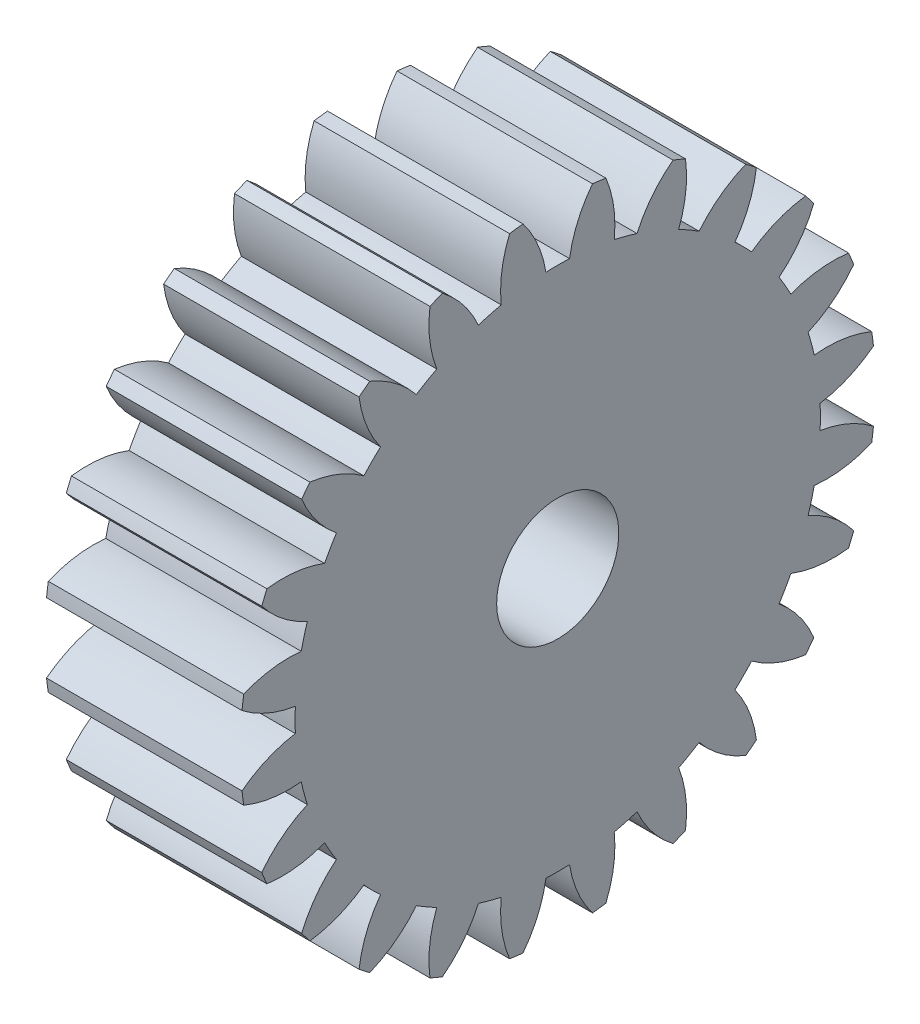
ISO-10303-21;
HEADER;
FILE_DESCRIPTION(('STEP AP214'),'2;1');
FILE_NAME('part.step','',(''),(''),'','','');
FILE_SCHEMA(('AUTOMOTIVE_DESIGN { 1 0 10303 214 1 1 1 1 }'));
ENDSEC;
DATA;
#1=APPLICATION_CONTEXT('core data for automotive mechanical design processes');
#2=APPLICATION_PROTOCOL_DEFINITION('international standard','automotive_design',2000,#1);
#3=PRODUCT_CONTEXT('',#1,'mechanical');
#4=PRODUCT('Part','Part','',(#3));
#5=PRODUCT_RELATED_PRODUCT_CATEGORY('part','',(#4));
#6=PRODUCT_DEFINITION_FORMATION('','',#4);
#7=PRODUCT_DEFINITION_CONTEXT('part definition',#1,'design');
#8=PRODUCT_DEFINITION('design','',#6,#7);
#9=PRODUCT_DEFINITION_SHAPE('','',#8);
#10=(LENGTH_UNIT() NAMED_UNIT(*) SI_UNIT(.MILLI.,.METRE.));
#11=(NAMED_UNIT(*) PLANE_ANGLE_UNIT() SI_UNIT($,.RADIAN.));
#12=(NAMED_UNIT(*) SI_UNIT($,.STERADIAN.) SOLID_ANGLE_UNIT());
#13=UNCERTAINTY_MEASURE_WITH_UNIT(LENGTH_MEASURE(1.E-05),#10,'distance_accuracy_value','');
#14=(GEOMETRIC_REPRESENTATION_CONTEXT(3) GLOBAL_UNCERTAINTY_ASSIGNED_CONTEXT((#13)) GLOBAL_UNIT_ASSIGNED_CONTEXT((#10,
#11,#12)) REPRESENTATION_CONTEXT('',''));
#15=CARTESIAN_POINT('',(0.,0.,0.));
#16=DIRECTION('',(0.,0.,1.));
#17=DIRECTION('',(1.,0.,0.));
#18=AXIS2_PLACEMENT_3D('',#15,#16,#17);
#19=CARTESIAN_POINT('',(8.,0.,0.));
#20=DIRECTION('',(-1.,0.,0.));
#21=DIRECTION('',(0.,0.,1.));
#22=AXIS2_PLACEMENT_3D('',#19,#20,#21);
#23=PLANE('',#22);
#24=CARTESIAN_POINT('',(8.,0.,0.));
#25=DIRECTION('',(-1.,0.,0.));
#26=DIRECTION('',(0.,0.,1.));
#27=AXIS2_PLACEMENT_3D('',#24,#25,#26);
#28=CIRCLE('',#27,2.5);
#29=CARTESIAN_POINT('',(8.,0.,2.5));
#30=VERTEX_POINT('',#29);
#31=EDGE_CURVE('E949',#30,#30,#28,.F.);
#32=ORIENTED_EDGE('',*,*,#31,.F.);
#33=EDGE_LOOP('',(#32));
#34=FACE_BOUND('',#33,.T.);
#35=CARTESIAN_POINT('',(8.,5.22520191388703,9.99262052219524));
#36=DIRECTION('',(-1.,0.,0.));
#37=DIRECTION('',(0.,1.,0.));
#38=AXIS2_PLACEMENT_3D('',#35,#36,#37);
#39=CIRCLE('',#38,4.8);
#40=CARTESIAN_POINT('',(8.,0.483448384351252,10.7381226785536));
#41=VERTEX_POINT('',#40);
#42=CARTESIAN_POINT('',(8.,1.42267520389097,12.9219191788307));
#43=VERTEX_POINT('',#42);
#44=EDGE_CURVE('E684',#41,#43,#39,.T.);
#45=ORIENTED_EDGE('',*,*,#44,.F.);
#46=CARTESIAN_POINT('',(8.,0.,0.));
#47=DIRECTION('',(-1.,0.,0.));
#48=DIRECTION('',(0.,1.,0.));
#49=AXIS2_PLACEMENT_3D('',#46,#47,#48);
#50=CIRCLE('',#49,10.749);
#51=CARTESIAN_POINT('',(8.,-0.483448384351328,10.7381226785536));
#52=VERTEX_POINT('',#51);
#53=EDGE_CURVE('E689',#52,#41,#50,.T.);
#54=ORIENTED_EDGE('',*,*,#53,.F.);
#55=CARTESIAN_POINT('',(8.,-5.2252019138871,9.9926205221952));
#56=DIRECTION('',(-1.,0.,0.));
#57=DIRECTION('',(0.,1.,0.));
#58=AXIS2_PLACEMENT_3D('',#55,#56,#57);
#59=CIRCLE('',#58,4.8);
#60=CARTESIAN_POINT('',(8.,-1.42267520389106,12.9219191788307));
#61=VERTEX_POINT('',#60);
#62=EDGE_CURVE('E686',#61,#52,#59,.T.);
#63=ORIENTED_EDGE('',*,*,#62,.F.);
#64=CARTESIAN_POINT('',(8.,0.,0.));
#65=DIRECTION('',(-1.,0.,0.));
#66=DIRECTION('',(0.,0.,1.));
#67=AXIS2_PLACEMENT_3D('',#64,#65,#66);
#68=CIRCLE('',#67,13.);
#69=CARTESIAN_POINT('',(8.,-1.97024006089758,12.8498308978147));
#70=VERTEX_POINT('',#69);
#71=EDGE_CURVE('E1335',#70,#61,#68,.T.);
#72=ORIENTED_EDGE('',*,*,#71,.F.);
#73=CARTESIAN_POINT('',(8.,2.46087697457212,11.0045120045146));
#74=DIRECTION('',(-1.,0.,0.));
#75=DIRECTION('',(0.,0.965925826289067,0.258819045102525));
#76=AXIS2_PLACEMENT_3D('',#73,#74,#75);
#77=CIRCLE('',#76,4.8);
#78=CARTESIAN_POINT('',(8.,-2.31225537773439,10.4973556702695));
#79=VERTEX_POINT('',#78);
#80=EDGE_CURVE('E785',#79,#70,#77,.T.);
#81=ORIENTED_EDGE('',*,*,#80,.F.);
#82=CARTESIAN_POINT('',(8.,0.,0.));
#83=DIRECTION('',(-1.,0.,0.));
#84=DIRECTION('',(0.,0.965925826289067,0.258819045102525));
#85=AXIS2_PLACEMENT_3D('',#82,#83,#84);
#86=CIRCLE('',#85,10.749);
#87=CARTESIAN_POINT('',(8.,-3.24620593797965,10.2471043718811));
#88=VERTEX_POINT('',#87);
#89=EDGE_CURVE('E790',#88,#79,#86,.T.);
#90=ORIENTED_EDGE('',*,*,#89,.F.);
#91=CARTESIAN_POINT('',(8.,-7.63343797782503,8.29974846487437));
#92=DIRECTION('',(-1.,0.,0.));
#93=DIRECTION('',(0.,0.965925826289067,0.258819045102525));
#94=AXIS2_PLACEMENT_3D('',#91,#92,#93);
#95=CIRCLE('',#94,4.8);
#96=CARTESIAN_POINT('',(8.,-4.71863750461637,12.1134000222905));
#97=VERTEX_POINT('',#96);
#98=EDGE_CURVE('E787',#97,#88,#95,.T.);
#99=ORIENTED_EDGE('',*,*,#98,.F.);
#100=CARTESIAN_POINT('',(8.,-5.2288867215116,11.9020478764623));
#101=VERTEX_POINT('',#100);
#102=EDGE_CURVE('E1313',#101,#97,#68,.T.);
#103=ORIENTED_EDGE('',*,*,#102,.F.);
#104=CARTESIAN_POINT('',(8.,-0.471152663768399,11.2664641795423));
#105=DIRECTION('',(-1.,0.,0.));
#106=DIRECTION('',(0.,0.866025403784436,0.500000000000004));
#107=AXIS2_PLACEMENT_3D('',#104,#105,#106);
#108=CIRCLE('',#107,4.8);
#109=CARTESIAN_POINT('',(8.,-4.95038275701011,9.54121122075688));
#110=VERTEX_POINT('',#109);
#111=EDGE_CURVE('E819',#110,#101,#108,.T.);
#112=ORIENTED_EDGE('',*,*,#111,.F.);
#113=CARTESIAN_POINT('',(8.,0.,0.));
#114=DIRECTION('',(-1.,0.,0.));
#115=DIRECTION('',(0.,0.866025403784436,0.500000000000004));
#116=AXIS2_PLACEMENT_3D('',#113,#114,#115);
#117=CIRCLE('',#116,10.749);
#118=CARTESIAN_POINT('',(8.,-5.78773992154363,9.05776283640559));
#119=VERTEX_POINT('',#118);
#120=EDGE_CURVE('E824',#119,#110,#117,.T.);
#121=ORIENTED_EDGE('',*,*,#120,.F.);
#122=CARTESIAN_POINT('',(8.,-9.5214678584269,6.04126226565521));
#123=DIRECTION('',(-1.,0.,0.));
#124=DIRECTION('',(0.,0.866025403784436,0.500000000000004));
#125=AXIS2_PLACEMENT_3D('',#122,#123,#124);
#126=CIRCLE('',#125,4.8);
#127=CARTESIAN_POINT('',(8.,-7.69303245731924,10.4793726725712));
#128=VERTEX_POINT('',#127);
#129=EDGE_CURVE('E821',#128,#119,#126,.T.);
#130=ORIENTED_EDGE('',*,*,#129,.F.);
#131=CARTESIAN_POINT('',(8.,-8.13119339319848,10.143159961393));
#132=VERTEX_POINT('',#131);
#133=EDGE_CURVE('E1447',#132,#128,#68,.T.);
#134=ORIENTED_EDGE('',*,*,#133,.F.);
#135=CARTESIAN_POINT('',(8.,-3.37107402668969,10.7606254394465));
#136=DIRECTION('',(-1.,0.,0.));
#137=DIRECTION('',(0.,0.707106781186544,0.707106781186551));
#138=AXIS2_PLACEMENT_3D('',#135,#136,#137);
#139=CIRCLE('',#138,4.8);
#140=CARTESIAN_POINT('',(8.,-7.2511497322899,7.93484899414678));
#141=VERTEX_POINT('',#140);
#142=EDGE_CURVE('E802',#141,#132,#139,.T.);
#143=ORIENTED_EDGE('',*,*,#142,.F.);
#144=CARTESIAN_POINT('',(8.,0.,0.));
#145=DIRECTION('',(-1.,0.,0.));
#146=DIRECTION('',(0.,0.707106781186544,0.707106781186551));
#147=AXIS2_PLACEMENT_3D('',#144,#145,#146);
#148=CIRCLE('',#147,10.749);
#149=CARTESIAN_POINT('',(8.,-7.93484899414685,7.25114973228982));
#150=VERTEX_POINT('',#149);
#151=EDGE_CURVE('E807',#150,#141,#148,.T.);
#152=ORIENTED_EDGE('',*,*,#151,.F.);
#153=CARTESIAN_POINT('',(8.,-10.7606254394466,3.37107402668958));
#154=DIRECTION('',(-1.,0.,0.));
#155=DIRECTION('',(0.,0.707106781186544,0.707106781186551));
#156=AXIS2_PLACEMENT_3D('',#153,#154,#155);
#157=CIRCLE('',#156,4.8);
#158=CARTESIAN_POINT('',(8.,-10.1431599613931,8.13119339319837));
#159=VERTEX_POINT('',#158);
#160=EDGE_CURVE('E804',#159,#150,#157,.T.);
#161=ORIENTED_EDGE('',*,*,#160,.F.);
#162=CARTESIAN_POINT('',(8.,-10.4793726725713,7.69303245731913));
#163=VERTEX_POINT('',#162);
#164=EDGE_CURVE('E1441',#163,#159,#68,.T.);
#165=ORIENTED_EDGE('',*,*,#164,.F.);
#166=CARTESIAN_POINT('',(8.,-6.04126226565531,9.52146785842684));
#167=DIRECTION('',(-1.,0.,0.));
#168=DIRECTION('',(0.,0.499999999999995,0.866025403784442));
#169=AXIS2_PLACEMENT_3D('',#166,#167,#168);
#170=CIRCLE('',#169,4.8);
#171=CARTESIAN_POINT('',(8.,-9.05776283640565,5.78773992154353));
#172=VERTEX_POINT('',#171);
#173=EDGE_CURVE('E732',#172,#163,#170,.T.);
#174=ORIENTED_EDGE('',*,*,#173,.F.);
#175=CARTESIAN_POINT('',(8.,0.,0.));
#176=DIRECTION('',(-1.,0.,0.));
#177=DIRECTION('',(0.,0.499999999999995,0.866025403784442));
#178=AXIS2_PLACEMENT_3D('',#175,#176,#177);
#179=CIRCLE('',#178,10.749);
#180=CARTESIAN_POINT('',(8.,-9.54121122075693,4.95038275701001));
#181=VERTEX_POINT('',#180);
#182=EDGE_CURVE('E737',#181,#172,#179,.T.);
#183=ORIENTED_EDGE('',*,*,#182,.F.);
#184=CARTESIAN_POINT('',(8.,-11.2664641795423,0.471152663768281));
#185=DIRECTION('',(-1.,0.,0.));
#186=DIRECTION('',(0.,0.499999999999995,0.866025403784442));
#187=AXIS2_PLACEMENT_3D('',#184,#185,#186);
#188=CIRCLE('',#187,4.8);
#189=CARTESIAN_POINT('',(8.,-11.9020478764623,5.22888672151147));
#190=VERTEX_POINT('',#189);
#191=EDGE_CURVE('E734',#190,#181,#188,.T.);
#192=ORIENTED_EDGE('',*,*,#191,.F.);
#193=CARTESIAN_POINT('',(8.,-12.1134000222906,4.71863750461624));
#194=VERTEX_POINT('',#193);
#195=EDGE_CURVE('E1435',#194,#190,#68,.T.);
#196=ORIENTED_EDGE('',*,*,#195,.F.);
#197=CARTESIAN_POINT('',(8.,-8.29974846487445,7.63343797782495));
#198=DIRECTION('',(-1.,0.,0.));
#199=DIRECTION('',(0.,0.258819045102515,0.96592582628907));
#200=AXIS2_PLACEMENT_3D('',#197,#198,#199);
#201=CIRCLE('',#200,4.8);
#202=CARTESIAN_POINT('',(8.,-10.2471043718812,3.24620593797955));
#203=VERTEX_POINT('',#202);
#204=EDGE_CURVE('E751',#203,#194,#201,.T.);
#205=ORIENTED_EDGE('',*,*,#204,.F.);
#206=CARTESIAN_POINT('',(8.,0.,0.));
#207=DIRECTION('',(-1.,0.,0.));
#208=DIRECTION('',(0.,0.258819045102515,0.96592582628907));
#209=AXIS2_PLACEMENT_3D('',#206,#207,#208);
#210=CIRCLE('',#209,10.749);
#211=CARTESIAN_POINT('',(8.,-10.4973556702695,2.31225537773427));
#212=VERTEX_POINT('',#211);
#213=EDGE_CURVE('E756',#212,#203,#210,.T.);
#214=ORIENTED_EDGE('',*,*,#213,.F.);
#215=CARTESIAN_POINT('',(8.,-11.0045120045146,-2.46087697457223));
#216=DIRECTION('',(-1.,0.,0.));
#217=DIRECTION('',(0.,0.258819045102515,0.96592582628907));
#218=AXIS2_PLACEMENT_3D('',#215,#216,#217);
#219=CIRCLE('',#218,4.8);
#220=CARTESIAN_POINT('',(8.,-12.8498308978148,1.97024006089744));
#221=VERTEX_POINT('',#220);
#222=EDGE_CURVE('E753',#221,#212,#219,.T.);
#223=ORIENTED_EDGE('',*,*,#222,.F.);
#224=CARTESIAN_POINT('',(8.,-12.9219191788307,1.42267520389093));
#225=VERTEX_POINT('',#224);
#226=EDGE_CURVE('E1429',#225,#221,#68,.T.);
#227=ORIENTED_EDGE('',*,*,#226,.F.);
#228=CARTESIAN_POINT('',(8.,-9.99262052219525,5.22520191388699));
#229=DIRECTION('',(-1.,0.,0.));
#230=DIRECTION('',(0.,0.,1.));
#231=AXIS2_PLACEMENT_3D('',#228,#229,#230);
#232=CIRCLE('',#231,4.8);
#233=CARTESIAN_POINT('',(8.,-10.7381226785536,0.483448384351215));
#234=VERTEX_POINT('',#233);
#235=EDGE_CURVE('E768',#234,#225,#232,.T.);
#236=ORIENTED_EDGE('',*,*,#235,.F.);
#237=CARTESIAN_POINT('',(8.,0.,0.));
#238=DIRECTION('',(-1.,0.,0.));
#239=DIRECTION('',(0.,0.,1.));
#240=AXIS2_PLACEMENT_3D('',#237,#238,#239);
#241=CIRCLE('',#240,10.749);
#242=CARTESIAN_POINT('',(8.,-10.7381226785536,-0.483448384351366));
#243=VERTEX_POINT('',#242);
#244=EDGE_CURVE('E773',#243,#234,#241,.T.);
#245=ORIENTED_EDGE('',*,*,#244,.F.);
#246=CARTESIAN_POINT('',(8.,-9.99262052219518,-5.22520191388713));
#247=DIRECTION('',(-1.,0.,0.));
#248=DIRECTION('',(0.,0.,1.));
#249=AXIS2_PLACEMENT_3D('',#246,#247,#248);
#250=CIRCLE('',#249,4.8);
#251=CARTESIAN_POINT('',(8.,-12.9219191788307,-1.42267520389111));
#252=VERTEX_POINT('',#251);
#253=EDGE_CURVE('E770',#252,#243,#250,.T.);
#254=ORIENTED_EDGE('',*,*,#253,.F.);
#255=CARTESIAN_POINT('',(8.,-12.8498308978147,-1.97024006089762));
#256=VERTEX_POINT('',#255);
#257=EDGE_CURVE('E1423',#256,#252,#68,.T.);
#258=ORIENTED_EDGE('',*,*,#257,.F.);
#259=CARTESIAN_POINT('',(8.,-11.0045120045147,2.46087697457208));
#260=DIRECTION('',(-1.,0.,0.));
#261=DIRECTION('',(0.,-0.258819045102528,0.965925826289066));
#262=AXIS2_PLACEMENT_3D('',#259,#260,#261);
#263=CIRCLE('',#262,4.8);
#264=CARTESIAN_POINT('',(8.,-10.4973556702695,-2.31225537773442));
#265=VERTEX_POINT('',#264);
#266=EDGE_CURVE('E887',#265,#256,#263,.T.);
#267=ORIENTED_EDGE('',*,*,#266,.F.);
#268=CARTESIAN_POINT('',(8.,0.,0.));
#269=DIRECTION('',(-1.,0.,0.));
#270=DIRECTION('',(0.,-0.258819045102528,0.965925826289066));
#271=AXIS2_PLACEMENT_3D('',#268,#269,#270);
#272=CIRCLE('',#271,10.749);
#273=CARTESIAN_POINT('',(8.,-10.2471043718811,-3.24620593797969));
#274=VERTEX_POINT('',#273);
#275=EDGE_CURVE('E892',#274,#265,#272,.T.);
#276=ORIENTED_EDGE('',*,*,#275,.F.);
#277=CARTESIAN_POINT('',(8.,-8.29974846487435,-7.63343797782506));
#278=DIRECTION('',(-1.,0.,0.));
#279=DIRECTION('',(0.,-0.258819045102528,0.965925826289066));
#280=AXIS2_PLACEMENT_3D('',#277,#278,#279);
#281=CIRCLE('',#280,4.8);
#282=CARTESIAN_POINT('',(8.,-12.1134000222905,-4.71863750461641));
#283=VERTEX_POINT('',#282);
#284=EDGE_CURVE('E889',#283,#274,#281,.T.);
#285=ORIENTED_EDGE('',*,*,#284,.F.);
#286=CARTESIAN_POINT('',(8.,-11.9020478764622,-5.22888672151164));
#287=VERTEX_POINT('',#286);
#288=EDGE_CURVE('E1417',#287,#283,#68,.T.);
#289=ORIENTED_EDGE('',*,*,#288,.F.);
#290=CARTESIAN_POINT('',(8.,-11.2664641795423,-0.471152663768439));
#291=DIRECTION('',(-1.,0.,0.));
#292=DIRECTION('',(0.,-0.500000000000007,0.866025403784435));
#293=AXIS2_PLACEMENT_3D('',#290,#291,#292);
#294=CIRCLE('',#293,4.8);
#295=CARTESIAN_POINT('',(8.,-9.54121122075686,-4.95038275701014));
#296=VERTEX_POINT('',#295);
#297=EDGE_CURVE('E904',#296,#287,#294,.T.);
#298=ORIENTED_EDGE('',*,*,#297,.F.);
#299=CARTESIAN_POINT('',(8.,0.,0.));
#300=DIRECTION('',(-1.,0.,0.));
#301=DIRECTION('',(0.,-0.500000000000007,0.866025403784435));
#302=AXIS2_PLACEMENT_3D('',#299,#300,#301);
#303=CIRCLE('',#302,10.749);
#304=CARTESIAN_POINT('',(8.,-9.05776283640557,-5.78773992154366));
#305=VERTEX_POINT('',#304);
#306=EDGE_CURVE('E909',#305,#296,#303,.T.);
#307=ORIENTED_EDGE('',*,*,#306,.F.);
#308=CARTESIAN_POINT('',(8.,-6.04126226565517,-9.52146785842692));
#309=DIRECTION('',(-1.,0.,0.));
#310=DIRECTION('',(0.,-0.500000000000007,0.866025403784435));
#311=AXIS2_PLACEMENT_3D('',#308,#309,#310);
#312=CIRCLE('',#311,4.8);
#313=CARTESIAN_POINT('',(8.,-10.4793726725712,-7.69303245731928));
#314=VERTEX_POINT('',#313);
#315=EDGE_CURVE('E906',#314,#305,#312,.T.);
#316=ORIENTED_EDGE('',*,*,#315,.F.);
#317=CARTESIAN_POINT('',(8.,-10.1431599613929,-8.13119339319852));
#318=VERTEX_POINT('',#317);
#319=EDGE_CURVE('E1411',#318,#314,#68,.T.);
#320=ORIENTED_EDGE('',*,*,#319,.F.);
#321=CARTESIAN_POINT('',(8.,-10.7606254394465,-3.37107402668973));
#322=DIRECTION('',(-1.,0.,0.));
#323=DIRECTION('',(0.,-0.707106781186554,0.707106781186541));
#324=AXIS2_PLACEMENT_3D('',#321,#322,#323);
#325=CIRCLE('',#324,4.8);
#326=CARTESIAN_POINT('',(8.,-7.93484899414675,-7.25114973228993));
#327=VERTEX_POINT('',#326);
#328=EDGE_CURVE('E870',#327,#318,#325,.T.);
#329=ORIENTED_EDGE('',*,*,#328,.F.);
#330=CARTESIAN_POINT('',(8.,0.,0.));
#331=DIRECTION('',(-1.,0.,0.));
#332=DIRECTION('',(0.,-0.707106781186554,0.707106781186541));
#333=AXIS2_PLACEMENT_3D('',#330,#331,#332);
#334=CIRCLE('',#333,10.749);
#335=CARTESIAN_POINT('',(8.,-7.25114973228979,-7.93484899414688));
#336=VERTEX_POINT('',#335);
#337=EDGE_CURVE('E875',#336,#327,#334,.T.);
#338=ORIENTED_EDGE('',*,*,#337,.F.);
#339=CARTESIAN_POINT('',(8.,-3.37107402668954,-10.7606254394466));
#340=DIRECTION('',(-1.,0.,0.));
#341=DIRECTION('',(0.,-0.707106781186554,0.707106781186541));
#342=AXIS2_PLACEMENT_3D('',#339,#340,#341);
#343=CIRCLE('',#342,4.8);
#344=CARTESIAN_POINT('',(8.,-8.13119339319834,-10.1431599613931));
#345=VERTEX_POINT('',#344);
#346=EDGE_CURVE('E872',#345,#336,#343,.T.);
#347=ORIENTED_EDGE('',*,*,#346,.F.);
#348=CARTESIAN_POINT('',(8.,-7.6930324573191,-10.4793726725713));
#349=VERTEX_POINT('',#348);
#350=EDGE_CURVE('E1405',#349,#345,#68,.T.);
#351=ORIENTED_EDGE('',*,*,#350,.F.);
#352=CARTESIAN_POINT('',(8.,-9.52146785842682,-6.04126226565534));
#353=DIRECTION('',(-1.,0.,0.));
#354=DIRECTION('',(0.,-0.866025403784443,0.499999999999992));
#355=AXIS2_PLACEMENT_3D('',#352,#353,#354);
#356=CIRCLE('',#355,4.8);
#357=CARTESIAN_POINT('',(8.,-5.7877399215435,-9.05776283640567));
#358=VERTEX_POINT('',#357);
#359=EDGE_CURVE('E834',#358,#349,#356,.T.);
#360=ORIENTED_EDGE('',*,*,#359,.F.);
#361=CARTESIAN_POINT('',(8.,0.,0.));
#362=DIRECTION('',(-1.,0.,0.));
#363=DIRECTION('',(0.,-0.866025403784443,0.499999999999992));
#364=AXIS2_PLACEMENT_3D('',#361,#362,#363);
#365=CIRCLE('',#364,10.749);
#366=CARTESIAN_POINT('',(8.,-4.95038275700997,-9.54121122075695));
#367=VERTEX_POINT('',#366);
#368=EDGE_CURVE('E839',#367,#358,#365,.T.);
#369=ORIENTED_EDGE('',*,*,#368,.F.);
#370=CARTESIAN_POINT('',(8.,-0.471152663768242,-11.2664641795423));
#371=DIRECTION('',(-1.,0.,0.));
#372=DIRECTION('',(0.,-0.866025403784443,0.499999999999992));
#373=AXIS2_PLACEMENT_3D('',#370,#371,#372);
#374=CIRCLE('',#373,4.8);
#375=CARTESIAN_POINT('',(8.,-5.22888672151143,-11.9020478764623));
#376=VERTEX_POINT('',#375);
#377=EDGE_CURVE('E836',#376,#367,#374,.T.);
#378=ORIENTED_EDGE('',*,*,#377,.F.);
#379=CARTESIAN_POINT('',(8.,-4.7186375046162,-12.1134000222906));
#380=VERTEX_POINT('',#379);
#381=EDGE_CURVE('E1399',#380,#376,#68,.T.);
#382=ORIENTED_EDGE('',*,*,#381,.F.);
#383=CARTESIAN_POINT('',(8.,-7.63343797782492,-8.29974846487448));
#384=DIRECTION('',(-1.,0.,0.));
#385=DIRECTION('',(0.,-0.965925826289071,0.258819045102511));
#386=AXIS2_PLACEMENT_3D('',#383,#384,#385);
#387=CIRCLE('',#386,4.8);
#388=CARTESIAN_POINT('',(8.,-3.24620593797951,-10.2471043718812));
#389=VERTEX_POINT('',#388);
#390=EDGE_CURVE('E853',#389,#380,#387,.T.);
#391=ORIENTED_EDGE('',*,*,#390,.F.);
#392=CARTESIAN_POINT('',(8.,0.,0.));
#393=DIRECTION('',(-1.,0.,0.));
#394=DIRECTION('',(0.,-0.965925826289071,0.258819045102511));
#395=AXIS2_PLACEMENT_3D('',#392,#393,#394);
#396=CIRCLE('',#395,10.749);
#397=CARTESIAN_POINT('',(8.,-2.31225537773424,-10.4973556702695));
#398=VERTEX_POINT('',#397);
#399=EDGE_CURVE('E858',#398,#389,#396,.T.);
#400=ORIENTED_EDGE('',*,*,#399,.F.);
#401=CARTESIAN_POINT('',(8.,2.46087697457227,-11.0045120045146));
#402=DIRECTION('',(-1.,0.,0.));
#403=DIRECTION('',(0.,-0.965925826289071,0.258819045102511));
#404=AXIS2_PLACEMENT_3D('',#401,#402,#403);
#405=CIRCLE('',#404,4.8);
#406=CARTESIAN_POINT('',(8.,-1.97024006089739,-12.8498308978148));
#407=VERTEX_POINT('',#406);
#408=EDGE_CURVE('E855',#407,#398,#405,.T.);
#409=ORIENTED_EDGE('',*,*,#408,.F.);
#410=CARTESIAN_POINT('',(8.,-1.42267520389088,-12.9219191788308));
#411=VERTEX_POINT('',#410);
#412=EDGE_CURVE('E1393',#411,#407,#68,.T.);
#413=ORIENTED_EDGE('',*,*,#412,.F.);
#414=CARTESIAN_POINT('',(8.,-5.22520191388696,-9.99262052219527));
#415=DIRECTION('',(-1.,0.,0.));
#416=DIRECTION('',(0.,-1.,0.));
#417=AXIS2_PLACEMENT_3D('',#414,#415,#416);
#418=CIRCLE('',#417,4.8);
#419=CARTESIAN_POINT('',(8.,-0.483448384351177,-10.7381226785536));
#420=VERTEX_POINT('',#419);
#421=EDGE_CURVE('E972',#420,#411,#418,.T.);
#422=ORIENTED_EDGE('',*,*,#421,.F.);
#423=CARTESIAN_POINT('',(8.,0.,0.));
#424=DIRECTION('',(-1.,0.,0.));
#425=DIRECTION('',(0.,-1.,0.));
#426=AXIS2_PLACEMENT_3D('',#423,#424,#425);
#427=CIRCLE('',#426,10.749);
#428=CARTESIAN_POINT('',(8.,0.483448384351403,-10.7381226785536));
#429=VERTEX_POINT('',#428);
#430=EDGE_CURVE('E977',#429,#420,#427,.T.);
#431=ORIENTED_EDGE('',*,*,#430,.F.);
#432=CARTESIAN_POINT('',(8.,5.22520191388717,-9.99262052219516));
#433=DIRECTION('',(-1.,0.,0.));
#434=DIRECTION('',(0.,-1.,0.));
#435=AXIS2_PLACEMENT_3D('',#432,#433,#434);
#436=CIRCLE('',#435,4.8);
#437=CARTESIAN_POINT('',(8.,1.42267520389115,-12.9219191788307));
#438=VERTEX_POINT('',#437);
#439=EDGE_CURVE('E974',#438,#429,#436,.T.);
#440=ORIENTED_EDGE('',*,*,#439,.F.);
#441=CARTESIAN_POINT('',(8.,1.97024006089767,-12.8498308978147));
#442=VERTEX_POINT('',#441);
#443=EDGE_CURVE('E1387',#442,#438,#68,.T.);
#444=ORIENTED_EDGE('',*,*,#443,.F.);
#445=CARTESIAN_POINT('',(8.,-2.46087697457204,-11.0045120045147));
#446=DIRECTION('',(-1.,0.,0.));
#447=DIRECTION('',(0.,-0.965925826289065,-0.258819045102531));
#448=AXIS2_PLACEMENT_3D('',#445,#446,#447);
#449=CIRCLE('',#448,4.8);
#450=CARTESIAN_POINT('',(8.,2.31225537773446,-10.4973556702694));
#451=VERTEX_POINT('',#450);
#452=EDGE_CURVE('E989',#451,#442,#449,.T.);
#453=ORIENTED_EDGE('',*,*,#452,.F.);
#454=CARTESIAN_POINT('',(8.,0.,0.));
#455=DIRECTION('',(-1.,0.,0.));
#456=DIRECTION('',(0.,-0.965925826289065,-0.258819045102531));
#457=AXIS2_PLACEMENT_3D('',#454,#455,#456);
#458=CIRCLE('',#457,10.749);
#459=CARTESIAN_POINT('',(8.,3.24620593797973,-10.2471043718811));
#460=VERTEX_POINT('',#459);
#461=EDGE_CURVE('E994',#460,#451,#458,.T.);
#462=ORIENTED_EDGE('',*,*,#461,.F.);
#463=CARTESIAN_POINT('',(8.,7.63343797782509,-8.29974846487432));
#464=DIRECTION('',(-1.,0.,0.));
#465=DIRECTION('',(0.,-0.965925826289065,-0.258819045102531));
#466=AXIS2_PLACEMENT_3D('',#463,#464,#465);
#467=CIRCLE('',#466,4.8);
#468=CARTESIAN_POINT('',(8.,4.71863750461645,-12.1134000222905));
#469=VERTEX_POINT('',#468);
#470=EDGE_CURVE('E991',#469,#460,#467,.T.);
#471=ORIENTED_EDGE('',*,*,#470,.F.);
#472=CARTESIAN_POINT('',(8.,5.22888672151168,-11.9020478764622));
#473=VERTEX_POINT('',#472);
#474=EDGE_CURVE('E1381',#473,#469,#68,.T.);
#475=ORIENTED_EDGE('',*,*,#474,.F.);
#476=CARTESIAN_POINT('',(8.,0.471152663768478,-11.2664641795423));
#477=DIRECTION('',(-1.,0.,0.));
#478=DIRECTION('',(0.,-0.866025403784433,-0.50000000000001));
#479=AXIS2_PLACEMENT_3D('',#476,#477,#478);
#480=CIRCLE('',#479,4.8);
#481=CARTESIAN_POINT('',(8.,4.95038275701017,-9.54121122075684));
#482=VERTEX_POINT('',#481);
#483=EDGE_CURVE('E1006',#482,#473,#480,.T.);
#484=ORIENTED_EDGE('',*,*,#483,.F.);
#485=CARTESIAN_POINT('',(8.,0.,0.));
#486=DIRECTION('',(-1.,0.,0.));
#487=DIRECTION('',(0.,-0.866025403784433,-0.50000000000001));
#488=AXIS2_PLACEMENT_3D('',#485,#486,#487);
#489=CIRCLE('',#488,10.749);
#490=CARTESIAN_POINT('',(8.,5.78773992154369,-9.05776283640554));
#491=VERTEX_POINT('',#490);
#492=EDGE_CURVE('E1011',#491,#482,#489,.T.);
#493=ORIENTED_EDGE('',*,*,#492,.F.);
#494=CARTESIAN_POINT('',(8.,9.52146785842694,-6.04126226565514));
#495=DIRECTION('',(-1.,0.,0.));
#496=DIRECTION('',(0.,-0.866025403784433,-0.50000000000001));
#497=AXIS2_PLACEMENT_3D('',#494,#495,#496);
#498=CIRCLE('',#497,4.8);
#499=CARTESIAN_POINT('',(8.,7.69303245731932,-10.4793726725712));
#500=VERTEX_POINT('',#499);
#501=EDGE_CURVE('E1008',#500,#491,#498,.T.);
#502=ORIENTED_EDGE('',*,*,#501,.F.);
#503=CARTESIAN_POINT('',(8.,8.13119339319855,-10.1431599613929));
#504=VERTEX_POINT('',#503);
#505=EDGE_CURVE('E1375',#504,#500,#68,.T.);
#506=ORIENTED_EDGE('',*,*,#505,.F.);
#507=CARTESIAN_POINT('',(8.,3.37107402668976,-10.7606254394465));
#508=DIRECTION('',(-1.,0.,0.));
#509=DIRECTION('',(0.,-0.707106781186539,-0.707106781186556));
#510=AXIS2_PLACEMENT_3D('',#507,#508,#509);
#511=CIRCLE('',#510,4.8);
#512=CARTESIAN_POINT('',(8.,7.25114973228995,-7.93484899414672));
#513=VERTEX_POINT('',#512);
#514=EDGE_CURVE('E955',#513,#504,#511,.T.);
#515=ORIENTED_EDGE('',*,*,#514,.F.);
#516=CARTESIAN_POINT('',(8.,0.,0.));
#517=DIRECTION('',(-1.,0.,0.));
#518=DIRECTION('',(0.,-0.707106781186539,-0.707106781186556));
#519=AXIS2_PLACEMENT_3D('',#516,#517,#518);
#520=CIRCLE('',#519,10.749);
#521=CARTESIAN_POINT('',(8.,7.9348489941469,-7.25114973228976));
#522=VERTEX_POINT('',#521);
#523=EDGE_CURVE('E960',#522,#513,#520,.T.);
#524=ORIENTED_EDGE('',*,*,#523,.F.);
#525=CARTESIAN_POINT('',(8.,10.7606254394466,-3.3710740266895));
#526=DIRECTION('',(-1.,0.,0.));
#527=DIRECTION('',(0.,-0.707106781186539,-0.707106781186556));
#528=AXIS2_PLACEMENT_3D('',#525,#526,#527);
#529=CIRCLE('',#528,4.8);
#530=CARTESIAN_POINT('',(8.,10.1431599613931,-8.1311933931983));
#531=VERTEX_POINT('',#530);
#532=EDGE_CURVE('E957',#531,#522,#529,.T.);
#533=ORIENTED_EDGE('',*,*,#532,.F.);
#534=CARTESIAN_POINT('',(8.,10.4793726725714,-7.69303245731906));
#535=VERTEX_POINT('',#534);
#536=EDGE_CURVE('E1369',#535,#531,#68,.T.);
#537=ORIENTED_EDGE('',*,*,#536,.F.);
#538=CARTESIAN_POINT('',(8.,6.04126226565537,-9.52146785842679));
#539=DIRECTION('',(-1.,0.,0.));
#540=DIRECTION('',(0.,-0.499999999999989,-0.866025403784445));
#541=AXIS2_PLACEMENT_3D('',#538,#539,#540);
#542=CIRCLE('',#541,4.8);
#543=CARTESIAN_POINT('',(8.,9.05776283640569,-5.78773992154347));
#544=VERTEX_POINT('',#543);
#545=EDGE_CURVE('E919',#544,#535,#542,.T.);
#546=ORIENTED_EDGE('',*,*,#545,.F.);
#547=CARTESIAN_POINT('',(8.,0.,0.));
#548=DIRECTION('',(-1.,0.,0.));
#549=DIRECTION('',(0.,-0.499999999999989,-0.866025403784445));
#550=AXIS2_PLACEMENT_3D('',#547,#548,#549);
#551=CIRCLE('',#550,10.749);
#552=CARTESIAN_POINT('',(8.,9.54121122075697,-4.95038275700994));
#553=VERTEX_POINT('',#552);
#554=EDGE_CURVE('E924',#553,#544,#551,.T.);
#555=ORIENTED_EDGE('',*,*,#554,.F.);
#556=CARTESIAN_POINT('',(8.,11.2664641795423,-0.471152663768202));
#557=DIRECTION('',(-1.,0.,0.));
#558=DIRECTION('',(0.,-0.499999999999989,-0.866025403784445));
#559=AXIS2_PLACEMENT_3D('',#556,#557,#558);
#560=CIRCLE('',#559,4.8);
#561=CARTESIAN_POINT('',(8.,11.9020478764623,-5.22888672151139));
#562=VERTEX_POINT('',#561);
#563=EDGE_CURVE('E921',#562,#553,#560,.T.);
#564=ORIENTED_EDGE('',*,*,#563,.F.);
#565=CARTESIAN_POINT('',(8.,12.1134000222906,-4.71863750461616));
#566=VERTEX_POINT('',#565);
#567=EDGE_CURVE('E1162',#566,#562,#68,.T.);
#568=ORIENTED_EDGE('',*,*,#567,.F.);
#569=CARTESIAN_POINT('',(8.,8.29974846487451,-7.63343797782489));
#570=DIRECTION('',(-1.,0.,0.));
#571=DIRECTION('',(0.,-0.258819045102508,-0.965925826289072));
#572=AXIS2_PLACEMENT_3D('',#569,#570,#571);
#573=CIRCLE('',#572,4.8);
#574=CARTESIAN_POINT('',(8.,10.2471043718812,-3.24620593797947));
#575=VERTEX_POINT('',#574);
#576=EDGE_CURVE('E938',#575,#566,#573,.T.);
#577=ORIENTED_EDGE('',*,*,#576,.F.);
#578=CARTESIAN_POINT('',(8.,0.,0.));
#579=DIRECTION('',(-1.,0.,0.));
#580=DIRECTION('',(0.,-0.258819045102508,-0.965925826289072));
#581=AXIS2_PLACEMENT_3D('',#578,#579,#580);
#582=CIRCLE('',#581,10.749);
#583=CARTESIAN_POINT('',(8.,10.4973556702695,-2.3122553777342));
#584=VERTEX_POINT('',#583);
#585=EDGE_CURVE('E943',#584,#575,#582,.T.);
#586=ORIENTED_EDGE('',*,*,#585,.F.);
#587=CARTESIAN_POINT('',(8.,11.0045120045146,2.46087697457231));
#588=DIRECTION('',(-1.,0.,0.));
#589=DIRECTION('',(0.,-0.258819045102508,-0.965925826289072));
#590=AXIS2_PLACEMENT_3D('',#587,#588,#589);
#591=CIRCLE('',#590,4.8);
#592=CARTESIAN_POINT('',(8.,12.8498308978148,-1.97024006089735));
#593=VERTEX_POINT('',#592);
#594=EDGE_CURVE('E940',#593,#584,#591,.T.);
#595=ORIENTED_EDGE('',*,*,#594,.F.);
#596=CARTESIAN_POINT('',(8.,12.9219191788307,-1.42267520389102));
#597=VERTEX_POINT('',#596);
#598=EDGE_CURVE('E1158',#597,#593,#68,.T.);
#599=ORIENTED_EDGE('',*,*,#598,.F.);
#600=CARTESIAN_POINT('',(8.,9.99262052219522,-5.22520191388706));
#601=DIRECTION('',(-1.,0.,0.));
#602=DIRECTION('',(0.,0.,-1.));
#603=AXIS2_PLACEMENT_3D('',#600,#601,#602);
#604=CIRCLE('',#603,4.8);
#605=CARTESIAN_POINT('',(8.,10.7381226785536,-0.48344838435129));
#606=VERTEX_POINT('',#605);
#607=EDGE_CURVE('E1130',#606,#597,#604,.T.);
#608=ORIENTED_EDGE('',*,*,#607,.F.);
#609=CARTESIAN_POINT('',(8.,0.,0.));
#610=DIRECTION('',(-1.,0.,0.));
#611=DIRECTION('',(0.,0.,-1.));
#612=AXIS2_PLACEMENT_3D('',#609,#610,#611);
#613=CIRCLE('',#612,10.749);
#614=CARTESIAN_POINT('',(8.,10.7381226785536,0.483448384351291));
#615=VERTEX_POINT('',#614);
#616=EDGE_CURVE('E1135',#615,#606,#613,.T.);
#617=ORIENTED_EDGE('',*,*,#616,.F.);
#618=CARTESIAN_POINT('',(8.,9.99262052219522,5.22520191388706));
#619=DIRECTION('',(-1.,0.,0.));
#620=DIRECTION('',(0.,0.,-1.));
#621=AXIS2_PLACEMENT_3D('',#618,#619,#620);
#622=CIRCLE('',#621,4.8);
#623=CARTESIAN_POINT('',(8.,12.9219191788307,1.42267520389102));
#624=VERTEX_POINT('',#623);
#625=EDGE_CURVE('E1132',#624,#615,#622,.T.);
#626=ORIENTED_EDGE('',*,*,#625,.F.);
#627=CARTESIAN_POINT('',(8.,12.8498308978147,1.97024006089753));
#628=VERTEX_POINT('',#627);
#629=EDGE_CURVE('E1155',#628,#624,#68,.T.);
#630=ORIENTED_EDGE('',*,*,#629,.F.);
#631=CARTESIAN_POINT('',(8.,11.0045120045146,-2.46087697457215));
#632=DIRECTION('',(-1.,0.,0.));
#633=DIRECTION('',(0.,0.258819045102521,-0.965925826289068));
#634=AXIS2_PLACEMENT_3D('',#631,#632,#633);
#635=CIRCLE('',#634,4.8);
#636=CARTESIAN_POINT('',(8.,10.4973556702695,2.31225537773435));
#637=VERTEX_POINT('',#636);
#638=EDGE_CURVE('E1108',#637,#628,#635,.T.);
#639=ORIENTED_EDGE('',*,*,#638,.F.);
#640=CARTESIAN_POINT('',(8.,0.,0.));
#641=DIRECTION('',(-1.,0.,0.));
#642=DIRECTION('',(0.,0.258819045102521,-0.965925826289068));
#643=AXIS2_PLACEMENT_3D('',#640,#641,#642);
#644=CIRCLE('',#643,10.749);
#645=CARTESIAN_POINT('',(8.,10.2471043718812,3.24620593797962));
#646=VERTEX_POINT('',#645);
#647=EDGE_CURVE('E1113',#646,#637,#644,.T.);
#648=ORIENTED_EDGE('',*,*,#647,.F.);
#649=CARTESIAN_POINT('',(8.,8.2997484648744,7.633437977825));
#650=DIRECTION('',(-1.,0.,0.));
#651=DIRECTION('',(0.,0.258819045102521,-0.965925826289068));
#652=AXIS2_PLACEMENT_3D('',#649,#650,#651);
#653=CIRCLE('',#652,4.8);
#654=CARTESIAN_POINT('',(8.,12.1134000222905,4.71863750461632));
#655=VERTEX_POINT('',#654);
#656=EDGE_CURVE('E1110',#655,#646,#653,.T.);
#657=ORIENTED_EDGE('',*,*,#656,.F.);
#658=CARTESIAN_POINT('',(8.,11.9020478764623,5.22888672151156));
#659=VERTEX_POINT('',#658);
#660=EDGE_CURVE('E1163',#659,#655,#68,.T.);
#661=ORIENTED_EDGE('',*,*,#660,.F.);
#662=CARTESIAN_POINT('',(8.,11.2664641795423,0.47115266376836));
#663=DIRECTION('',(-1.,0.,0.));
#664=DIRECTION('',(0.,0.500000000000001,-0.866025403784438));
#665=AXIS2_PLACEMENT_3D('',#662,#663,#664);
#666=CIRCLE('',#665,4.8);
#667=CARTESIAN_POINT('',(8.,9.5412112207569,4.95038275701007));
#668=VERTEX_POINT('',#667);
#669=EDGE_CURVE('E715',#668,#659,#666,.T.);
#670=ORIENTED_EDGE('',*,*,#669,.F.);
#671=CARTESIAN_POINT('',(8.,0.,0.));
#672=DIRECTION('',(-1.,0.,0.));
#673=DIRECTION('',(0.,0.500000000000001,-0.866025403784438));
#674=AXIS2_PLACEMENT_3D('',#671,#672,#673);
#675=CIRCLE('',#674,10.749);
#676=CARTESIAN_POINT('',(8.,9.05776283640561,5.78773992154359));
#677=VERTEX_POINT('',#676);
#678=EDGE_CURVE('E720',#677,#668,#675,.T.);
#679=ORIENTED_EDGE('',*,*,#678,.F.);
#680=CARTESIAN_POINT('',(8.,6.04126226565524,9.52146785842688));
#681=DIRECTION('',(-1.,0.,0.));
#682=DIRECTION('',(0.,0.500000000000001,-0.866025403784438));
#683=AXIS2_PLACEMENT_3D('',#680,#681,#682);
#684=CIRCLE('',#683,4.8);
#685=CARTESIAN_POINT('',(8.,10.4793726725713,7.69303245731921));
#686=VERTEX_POINT('',#685);
#687=EDGE_CURVE('E717',#686,#677,#684,.T.);
#688=ORIENTED_EDGE('',*,*,#687,.F.);
#689=CARTESIAN_POINT('',(8.,10.143159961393,8.13119339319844));
#690=VERTEX_POINT('',#689);
#691=EDGE_CURVE('E1351',#690,#686,#68,.T.);
#692=ORIENTED_EDGE('',*,*,#691,.F.);
#693=CARTESIAN_POINT('',(8.,10.7606254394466,3.37107402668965));
#694=DIRECTION('',(-1.,0.,0.));
#695=DIRECTION('',(0.,0.707106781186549,-0.707106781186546));
#696=AXIS2_PLACEMENT_3D('',#693,#694,#695);
#697=CIRCLE('',#696,4.8);
#698=CARTESIAN_POINT('',(8.,7.9348489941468,7.25114973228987));
#699=VERTEX_POINT('',#698);
#700=EDGE_CURVE('E698',#699,#690,#697,.T.);
#701=ORIENTED_EDGE('',*,*,#700,.F.);
#702=CARTESIAN_POINT('',(8.,0.,0.));
#703=DIRECTION('',(-1.,0.,0.));
#704=DIRECTION('',(0.,0.707106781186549,-0.707106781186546));
#705=AXIS2_PLACEMENT_3D('',#702,#703,#704);
#706=CIRCLE('',#705,10.749);
#707=CARTESIAN_POINT('',(8.,7.25114973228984,7.93484899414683));
#708=VERTEX_POINT('',#707);
#709=EDGE_CURVE('E703',#708,#699,#706,.T.);
#710=ORIENTED_EDGE('',*,*,#709,.F.);
#711=CARTESIAN_POINT('',(8.,3.37107402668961,10.7606254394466));
#712=DIRECTION('',(-1.,0.,0.));
#713=DIRECTION('',(0.,0.707106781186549,-0.707106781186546));
#714=AXIS2_PLACEMENT_3D('',#711,#712,#713);
#715=CIRCLE('',#714,4.8);
#716=CARTESIAN_POINT('',(8.,8.13119339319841,10.143159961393));
#717=VERTEX_POINT('',#716);
#718=EDGE_CURVE('E700',#717,#708,#715,.T.);
#719=ORIENTED_EDGE('',*,*,#718,.F.);
#720=CARTESIAN_POINT('',(8.,7.69303245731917,10.4793726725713));
#721=VERTEX_POINT('',#720);
#722=EDGE_CURVE('E1347',#721,#717,#68,.T.);
#723=ORIENTED_EDGE('',*,*,#722,.F.);
#724=CARTESIAN_POINT('',(8.,9.52146785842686,6.04126226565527));
#725=DIRECTION('',(-1.,0.,0.));
#726=DIRECTION('',(0.,0.86602540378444,-0.499999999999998));
#727=AXIS2_PLACEMENT_3D('',#724,#725,#726);
#728=CIRCLE('',#727,4.8);
#729=CARTESIAN_POINT('',(8.,5.78773992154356,9.05776283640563));
#730=VERTEX_POINT('',#729);
#731=EDGE_CURVE('E646',#730,#721,#728,.T.);
#732=ORIENTED_EDGE('',*,*,#731,.F.);
#733=CARTESIAN_POINT('',(8.,0.,0.));
#734=DIRECTION('',(-1.,0.,0.));
#735=DIRECTION('',(0.,0.86602540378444,-0.499999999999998));
#736=AXIS2_PLACEMENT_3D('',#733,#734,#735);
#737=CIRCLE('',#736,10.749);
#738=CARTESIAN_POINT('',(8.,4.95038275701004,9.54121122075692));
#739=VERTEX_POINT('',#738);
#740=EDGE_CURVE('E645',#739,#730,#737,.T.);
#741=ORIENTED_EDGE('',*,*,#740,.F.);
#742=CARTESIAN_POINT('',(8.,0.47115266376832,11.2664641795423));
#743=DIRECTION('',(-1.,0.,0.));
#744=DIRECTION('',(0.,0.86602540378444,-0.499999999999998));
#745=AXIS2_PLACEMENT_3D('',#742,#743,#744);
#746=CIRCLE('',#745,4.8);
#747=CARTESIAN_POINT('',(8.,5.22888672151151,11.9020478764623));
#748=VERTEX_POINT('',#747);
#749=EDGE_CURVE('E634',#748,#739,#746,.T.);
#750=ORIENTED_EDGE('',*,*,#749,.F.);
#751=CARTESIAN_POINT('',(8.,4.71863750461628,12.1134000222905));
#752=VERTEX_POINT('',#751);
#753=EDGE_CURVE('E1346',#752,#748,#68,.T.);
#754=ORIENTED_EDGE('',*,*,#753,.F.);
#755=CARTESIAN_POINT('',(8.,7.63343797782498,8.29974846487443));
#756=DIRECTION('',(-1.,0.,0.));
#757=DIRECTION('',(0.,0.965925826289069,-0.258819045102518));
#758=AXIS2_PLACEMENT_3D('',#755,#756,#757);
#759=CIRCLE('',#758,4.8);
#760=CARTESIAN_POINT('',(8.,3.24620593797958,10.2471043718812));
#761=VERTEX_POINT('',#760);
#762=EDGE_CURVE('E670',#761,#752,#759,.T.);
#763=ORIENTED_EDGE('',*,*,#762,.F.);
#764=CARTESIAN_POINT('',(8.,0.,0.));
#765=DIRECTION('',(-1.,0.,0.));
#766=DIRECTION('',(0.,0.965925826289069,-0.258819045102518));
#767=AXIS2_PLACEMENT_3D('',#764,#765,#766);
#768=CIRCLE('',#767,10.749);
#769=CARTESIAN_POINT('',(8.,2.31225537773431,10.4973556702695));
#770=VERTEX_POINT('',#769);
#771=EDGE_CURVE('E675',#770,#761,#768,.T.);
#772=ORIENTED_EDGE('',*,*,#771,.F.);
#773=CARTESIAN_POINT('',(8.,-2.46087697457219,11.0045120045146));
#774=DIRECTION('',(-1.,0.,0.));
#775=DIRECTION('',(0.,0.965925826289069,-0.258819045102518));
#776=AXIS2_PLACEMENT_3D('',#773,#774,#775);
#777=CIRCLE('',#776,4.8);
#778=CARTESIAN_POINT('',(8.,1.97024006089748,12.8498308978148));
#779=VERTEX_POINT('',#778);
#780=EDGE_CURVE('E672',#779,#770,#777,.T.);
#781=ORIENTED_EDGE('',*,*,#780,.F.);
#782=EDGE_CURVE('E1225',#43,#779,#68,.T.);
#783=ORIENTED_EDGE('',*,*,#782,.F.);
#784=EDGE_LOOP('',(#45,#54,#63,#72,#81,#90,#99,#103,#112,#121,#130,#134,#143,#152,#161,#165,
#174,#183,#192,#196,#205,#214,#223,#227,#236,#245,#254,#258,#267,#276,#285,#289,#298,#307,#316,
#320,#329,#338,#347,#351,#360,#369,#378,#382,#391,#400,#409,#413,#422,#431,#440,#444,#453,#462,
#471,#475,#484,#493,#502,#506,#515,#524,#533,#537,#546,#555,#564,#568,#577,#586,#595,#599,#608,
#617,#626,#630,#639,#648,#657,#661,#670,#679,#688,#692,#701,#710,#719,#723,#732,#741,#750,#754,
#763,#772,#781,#783));
#785=FACE_BOUND('',#784,.T.);
#786=ADVANCED_FACE('F41',(#34,#785),#23,.F.);
#787=CARTESIAN_POINT('',(-10.,0.,0.));
#788=DIRECTION('',(-1.,0.,0.));
#789=DIRECTION('',(0.,0.,1.));
#790=AXIS2_PLACEMENT_3D('',#787,#788,#789);
#791=CYLINDRICAL_SURFACE('',#790,13.);
#792=DIRECTION('',(-1.,0.,0.));
#793=VECTOR('',#792,1.);
#794=CARTESIAN_POINT('',(4.,1.42267520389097,12.9219191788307));
#795=LINE('',#794,#793);
#796=CARTESIAN_POINT('',(0.,1.42267520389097,12.9219191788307));
#797=VERTEX_POINT('',#796);
#798=EDGE_CURVE('E1105',#43,#797,#795,.T.);
#799=ORIENTED_EDGE('',*,*,#798,.F.);
#800=ORIENTED_EDGE('',*,*,#782,.T.);
#801=DIRECTION('',(-1.,0.,0.));
#802=VECTOR('',#801,1.);
#803=CARTESIAN_POINT('',(4.,1.97024006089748,12.8498308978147));
#804=LINE('',#803,#802);
#805=CARTESIAN_POINT('',(0.,1.97024006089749,12.8498308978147));
#806=VERTEX_POINT('',#805);
#807=EDGE_CURVE('E1099',#806,#779,#804,.F.);
#808=ORIENTED_EDGE('',*,*,#807,.F.);
#809=CARTESIAN_POINT('',(0.,0.,0.));
#810=DIRECTION('',(-1.,0.,0.));
#811=DIRECTION('',(0.,0.,1.));
#812=AXIS2_PLACEMENT_3D('',#809,#810,#811);
#813=CIRCLE('',#812,13.);
#814=EDGE_CURVE('E1223',#797,#806,#813,.T.);
#815=ORIENTED_EDGE('',*,*,#814,.F.);
#816=EDGE_LOOP('',(#799,#800,#808,#815));
#817=FACE_BOUND('',#816,.T.);
#818=ADVANCED_FACE('F1222',(#817),#791,.T.);
#819=DIRECTION('',(-1.,0.,0.));
#820=VECTOR('',#819,1.);
#821=CARTESIAN_POINT('',(4.,-1.42267520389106,12.9219191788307));
#822=LINE('',#821,#820);
#823=CARTESIAN_POINT('',(0.,-1.42267520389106,12.9219191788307));
#824=VERTEX_POINT('',#823);
#825=EDGE_CURVE('E1103',#824,#61,#822,.F.);
#826=ORIENTED_EDGE('',*,*,#825,.F.);
#827=CARTESIAN_POINT('',(0.,-1.97024006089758,12.8498308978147));
#828=VERTEX_POINT('',#827);
#829=EDGE_CURVE('E1227',#828,#824,#813,.T.);
#830=ORIENTED_EDGE('',*,*,#829,.F.);
#831=DIRECTION('',(-1.,0.,0.));
#832=VECTOR('',#831,1.);
#833=CARTESIAN_POINT('',(4.,-1.97024006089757,12.8498308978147));
#834=LINE('',#833,#832);
#835=EDGE_CURVE('E1066',#70,#828,#834,.T.);
#836=ORIENTED_EDGE('',*,*,#835,.F.);
#837=ORIENTED_EDGE('',*,*,#71,.T.);
#838=EDGE_LOOP('',(#826,#830,#836,#837));
#839=FACE_BOUND('',#838,.T.);
#840=ADVANCED_FACE('F1333',(#839),#791,.T.);
#841=DIRECTION('',(-1.,0.,0.));
#842=VECTOR('',#841,1.);
#843=CARTESIAN_POINT('',(4.,4.71863750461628,12.1134000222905));
#844=LINE('',#843,#842);
#845=CARTESIAN_POINT('',(0.,4.71863750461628,12.1134000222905));
#846=VERTEX_POINT('',#845);
#847=EDGE_CURVE('E1101',#752,#846,#844,.T.);
#848=ORIENTED_EDGE('',*,*,#847,.F.);
#849=ORIENTED_EDGE('',*,*,#753,.T.);
#850=DIRECTION('',(-1.,0.,0.));
#851=VECTOR('',#850,1.);
#852=CARTESIAN_POINT('',(4.,5.22888672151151,11.9020478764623));
#853=LINE('',#852,#851);
#854=CARTESIAN_POINT('',(0.,5.22888672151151,11.9020478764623));
#855=VERTEX_POINT('',#854);
#856=EDGE_CURVE('E640',#855,#748,#853,.F.);
#857=ORIENTED_EDGE('',*,*,#856,.F.);
#858=EDGE_CURVE('E1228',#846,#855,#813,.T.);
#859=ORIENTED_EDGE('',*,*,#858,.F.);
#860=EDGE_LOOP('',(#848,#849,#857,#859));
#861=FACE_BOUND('',#860,.T.);
#862=ADVANCED_FACE('F1915',(#861),#791,.T.);
#863=DIRECTION('',(-1.,0.,0.));
#864=VECTOR('',#863,1.);
#865=CARTESIAN_POINT('',(4.,7.69303245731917,10.4793726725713));
#866=LINE('',#865,#864);
#867=CARTESIAN_POINT('',(0.,7.69303245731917,10.4793726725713));
#868=VERTEX_POINT('',#867);
#869=EDGE_CURVE('E1097',#721,#868,#866,.T.);
#870=ORIENTED_EDGE('',*,*,#869,.F.);
#871=ORIENTED_EDGE('',*,*,#722,.T.);
#872=DIRECTION('',(-1.,0.,0.));
#873=VECTOR('',#872,1.);
#874=CARTESIAN_POINT('',(4.,8.13119339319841,10.143159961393));
#875=LINE('',#874,#873);
#876=CARTESIAN_POINT('',(0.,8.13119339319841,10.143159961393));
#877=VERTEX_POINT('',#876);
#878=EDGE_CURVE('E1088',#877,#717,#875,.F.);
#879=ORIENTED_EDGE('',*,*,#878,.F.);
#880=EDGE_CURVE('E1232',#868,#877,#813,.T.);
#881=ORIENTED_EDGE('',*,*,#880,.F.);
#882=EDGE_LOOP('',(#870,#871,#879,#881));
#883=FACE_BOUND('',#882,.T.);
#884=ADVANCED_FACE('F1498',(#883),#791,.T.);
#885=DIRECTION('',(-1.,0.,0.));
#886=VECTOR('',#885,1.);
#887=CARTESIAN_POINT('',(4.,11.9020478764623,5.22888672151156));
#888=LINE('',#887,#886);
#889=CARTESIAN_POINT('',(0.,11.9020478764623,5.22888672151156));
#890=VERTEX_POINT('',#889);
#891=EDGE_CURVE('E1094',#659,#890,#888,.T.);
#892=ORIENTED_EDGE('',*,*,#891,.F.);
#893=ORIENTED_EDGE('',*,*,#660,.T.);
#894=DIRECTION('',(-1.,0.,0.));
#895=VECTOR('',#894,1.);
#896=CARTESIAN_POINT('',(4.,12.1134000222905,4.71863750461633));
#897=LINE('',#896,#895);
#898=CARTESIAN_POINT('',(0.,12.1134000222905,4.71863750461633));
#899=VERTEX_POINT('',#898);
#900=EDGE_CURVE('E1124',#899,#655,#897,.F.);
#901=ORIENTED_EDGE('',*,*,#900,.F.);
#902=EDGE_CURVE('E1157',#890,#899,#813,.T.);
#903=ORIENTED_EDGE('',*,*,#902,.F.);
#904=EDGE_LOOP('',(#892,#893,#901,#903));
#905=FACE_BOUND('',#904,.T.);
#906=ADVANCED_FACE('F1523',(#905),#791,.T.);
#907=DIRECTION('',(-1.,0.,0.));
#908=VECTOR('',#907,1.);
#909=CARTESIAN_POINT('',(4.,10.4793726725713,7.69303245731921));
#910=LINE('',#909,#908);
#911=CARTESIAN_POINT('',(0.,10.4793726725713,7.69303245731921));
#912=VERTEX_POINT('',#911);
#913=EDGE_CURVE('E1092',#912,#686,#910,.F.);
#914=ORIENTED_EDGE('',*,*,#913,.F.);
#915=CARTESIAN_POINT('',(0.,10.143159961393,8.13119339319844));
#916=VERTEX_POINT('',#915);
#917=EDGE_CURVE('E1235',#916,#912,#813,.T.);
#918=ORIENTED_EDGE('',*,*,#917,.F.);
#919=DIRECTION('',(-1.,0.,0.));
#920=VECTOR('',#919,1.);
#921=CARTESIAN_POINT('',(4.,10.143159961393,8.13119339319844));
#922=LINE('',#921,#920);
#923=EDGE_CURVE('E1090',#690,#916,#922,.T.);
#924=ORIENTED_EDGE('',*,*,#923,.F.);
#925=ORIENTED_EDGE('',*,*,#691,.T.);
#926=EDGE_LOOP('',(#914,#918,#924,#925));
#927=FACE_BOUND('',#926,.T.);
#928=ADVANCED_FACE('F1510',(#927),#791,.T.);
#929=DIRECTION('',(-1.,0.,0.));
#930=VECTOR('',#929,1.);
#931=CARTESIAN_POINT('',(4.,-12.9219191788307,1.42267520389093));
#932=LINE('',#931,#930);
#933=CARTESIAN_POINT('',(0.,-12.9219191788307,1.42267520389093));
#934=VERTEX_POINT('',#933);
#935=EDGE_CURVE('E1086',#225,#934,#932,.T.);
#936=ORIENTED_EDGE('',*,*,#935,.F.);
#937=ORIENTED_EDGE('',*,*,#226,.T.);
#938=DIRECTION('',(-1.,0.,0.));
#939=VECTOR('',#938,1.);
#940=CARTESIAN_POINT('',(4.,-12.8498308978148,1.97024006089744));
#941=LINE('',#940,#939);
#942=CARTESIAN_POINT('',(0.,-12.8498308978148,1.97024006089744));
#943=VERTEX_POINT('',#942);
#944=EDGE_CURVE('E1080',#943,#221,#941,.F.);
#945=ORIENTED_EDGE('',*,*,#944,.F.);
#946=EDGE_CURVE('E1286',#934,#943,#813,.T.);
#947=ORIENTED_EDGE('',*,*,#946,.F.);
#948=EDGE_LOOP('',(#936,#937,#945,#947));
#949=FACE_BOUND('',#948,.T.);
#950=ADVANCED_FACE('F1710',(#949),#791,.T.);
#951=DIRECTION('',(-1.,0.,0.));
#952=VECTOR('',#951,1.);
#953=CARTESIAN_POINT('',(4.,-12.9219191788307,-1.42267520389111));
#954=LINE('',#953,#952);
#955=CARTESIAN_POINT('',(0.,-12.9219191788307,-1.42267520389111));
#956=VERTEX_POINT('',#955);
#957=EDGE_CURVE('E1084',#956,#252,#954,.F.);
#958=ORIENTED_EDGE('',*,*,#957,.F.);
#959=CARTESIAN_POINT('',(0.,-12.8498308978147,-1.97024006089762));
#960=VERTEX_POINT('',#959);
#961=EDGE_CURVE('E1282',#960,#956,#813,.T.);
#962=ORIENTED_EDGE('',*,*,#961,.F.);
#963=DIRECTION('',(-1.,0.,0.));
#964=VECTOR('',#963,1.);
#965=CARTESIAN_POINT('',(4.,-12.8498308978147,-1.97024006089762));
#966=LINE('',#965,#964);
#967=EDGE_CURVE('E1046',#256,#960,#966,.T.);
#968=ORIENTED_EDGE('',*,*,#967,.F.);
#969=ORIENTED_EDGE('',*,*,#257,.T.);
#970=EDGE_LOOP('',(#958,#962,#968,#969));
#971=FACE_BOUND('',#970,.T.);
#972=ADVANCED_FACE('F1697',(#971),#791,.T.);
#973=DIRECTION('',(-1.,0.,0.));
#974=VECTOR('',#973,1.);
#975=CARTESIAN_POINT('',(4.,-12.1134000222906,4.71863750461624));
#976=LINE('',#975,#974);
#977=CARTESIAN_POINT('',(0.,-12.1134000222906,4.71863750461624));
#978=VERTEX_POINT('',#977);
#979=EDGE_CURVE('E1082',#194,#978,#976,.T.);
#980=ORIENTED_EDGE('',*,*,#979,.F.);
#981=ORIENTED_EDGE('',*,*,#195,.T.);
#982=DIRECTION('',(-1.,0.,0.));
#983=VECTOR('',#982,1.);
#984=CARTESIAN_POINT('',(4.,-11.9020478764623,5.22888672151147));
#985=LINE('',#984,#983);
#986=CARTESIAN_POINT('',(0.,-11.9020478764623,5.22888672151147));
#987=VERTEX_POINT('',#986);
#988=EDGE_CURVE('E1076',#987,#190,#985,.F.);
#989=ORIENTED_EDGE('',*,*,#988,.F.);
#990=EDGE_CURVE('E1290',#978,#987,#813,.T.);
#991=ORIENTED_EDGE('',*,*,#990,.F.);
#992=EDGE_LOOP('',(#980,#981,#989,#991));
#993=FACE_BOUND('',#992,.T.);
#994=ADVANCED_FACE('F1723',(#993),#791,.T.);
#995=DIRECTION('',(-1.,0.,0.));
#996=VECTOR('',#995,1.);
#997=CARTESIAN_POINT('',(4.,-10.4793726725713,7.69303245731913));
#998=LINE('',#997,#996);
#999=CARTESIAN_POINT('',(0.,-10.4793726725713,7.69303245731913));
#1000=VERTEX_POINT('',#999);
#1001=EDGE_CURVE('E1078',#163,#1000,#998,.T.);
#1002=ORIENTED_EDGE('',*,*,#1001,.F.);
#1003=ORIENTED_EDGE('',*,*,#164,.T.);
#1004=DIRECTION('',(-1.,0.,0.));
#1005=VECTOR('',#1004,1.);
#1006=CARTESIAN_POINT('',(4.,-10.1431599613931,8.13119339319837));
#1007=LINE('',#1006,#1005);
#1008=CARTESIAN_POINT('',(0.,-10.1431599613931,8.13119339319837));
#1009=VERTEX_POINT('',#1008);
#1010=EDGE_CURVE('E1068',#1009,#159,#1007,.F.);
#1011=ORIENTED_EDGE('',*,*,#1010,.F.);
#1012=EDGE_CURVE('E1294',#1000,#1009,#813,.T.);
#1013=ORIENTED_EDGE('',*,*,#1012,.F.);
#1014=EDGE_LOOP('',(#1002,#1003,#1011,#1013));
#1015=FACE_BOUND('',#1014,.T.);
#1016=ADVANCED_FACE('F1736',(#1015),#791,.T.);
#1017=DIRECTION('',(-1.,0.,0.));
#1018=VECTOR('',#1017,1.);
#1019=CARTESIAN_POINT('',(4.,-5.2288867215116,11.9020478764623));
#1020=LINE('',#1019,#1018);
#1021=CARTESIAN_POINT('',(0.,-5.2288867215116,11.9020478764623));
#1022=VERTEX_POINT('',#1021);
#1023=EDGE_CURVE('E1074',#101,#1022,#1020,.T.);
#1024=ORIENTED_EDGE('',*,*,#1023,.F.);
#1025=ORIENTED_EDGE('',*,*,#102,.T.);
#1026=DIRECTION('',(-1.,0.,0.));
#1027=VECTOR('',#1026,1.);
#1028=CARTESIAN_POINT('',(4.,-4.71863750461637,12.1134000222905));
#1029=LINE('',#1028,#1027);
#1030=CARTESIAN_POINT('',(0.,-4.71863750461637,12.1134000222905));
#1031=VERTEX_POINT('',#1030);
#1032=EDGE_CURVE('E1064',#1031,#97,#1029,.F.);
#1033=ORIENTED_EDGE('',*,*,#1032,.F.);
#1034=EDGE_CURVE('E1230',#1022,#1031,#813,.T.);
#1035=ORIENTED_EDGE('',*,*,#1034,.F.);
#1036=EDGE_LOOP('',(#1024,#1025,#1033,#1035));
#1037=FACE_BOUND('',#1036,.T.);
#1038=ADVANCED_FACE('F1310',(#1037),#791,.T.);
#1039=DIRECTION('',(-1.,0.,0.));
#1040=VECTOR('',#1039,1.);
#1041=CARTESIAN_POINT('',(4.,-7.69303245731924,10.4793726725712));
#1042=LINE('',#1041,#1040);
#1043=CARTESIAN_POINT('',(0.,-7.69303245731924,10.4793726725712));
#1044=VERTEX_POINT('',#1043);
#1045=EDGE_CURVE('E1072',#1044,#128,#1042,.F.);
#1046=ORIENTED_EDGE('',*,*,#1045,.F.);
#1047=CARTESIAN_POINT('',(0.,-8.13119339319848,10.143159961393));
#1048=VERTEX_POINT('',#1047);
#1049=EDGE_CURVE('E1298',#1048,#1044,#813,.T.);
#1050=ORIENTED_EDGE('',*,*,#1049,.F.);
#1051=DIRECTION('',(-1.,0.,0.));
#1052=VECTOR('',#1051,1.);
#1053=CARTESIAN_POINT('',(4.,-8.13119339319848,10.143159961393));
#1054=LINE('',#1053,#1052);
#1055=EDGE_CURVE('E1070',#132,#1048,#1054,.T.);
#1056=ORIENTED_EDGE('',*,*,#1055,.F.);
#1057=ORIENTED_EDGE('',*,*,#133,.T.);
#1058=EDGE_LOOP('',(#1046,#1050,#1056,#1057));
#1059=FACE_BOUND('',#1058,.T.);
#1060=ADVANCED_FACE('F1457',(#1059),#791,.T.);
#1061=DIRECTION('',(-1.,0.,0.));
#1062=VECTOR('',#1061,1.);
#1063=CARTESIAN_POINT('',(4.,-10.1431599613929,-8.13119339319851));
#1064=LINE('',#1063,#1062);
#1065=CARTESIAN_POINT('',(0.,-10.1431599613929,-8.13119339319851));
#1066=VERTEX_POINT('',#1065);
#1067=EDGE_CURVE('E1062',#318,#1066,#1064,.T.);
#1068=ORIENTED_EDGE('',*,*,#1067,.F.);
#1069=ORIENTED_EDGE('',*,*,#319,.T.);
#1070=DIRECTION('',(-1.,0.,0.));
#1071=VECTOR('',#1070,1.);
#1072=CARTESIAN_POINT('',(4.,-10.4793726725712,-7.69303245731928));
#1073=LINE('',#1072,#1071);
#1074=CARTESIAN_POINT('',(0.,-10.4793726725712,-7.69303245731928));
#1075=VERTEX_POINT('',#1074);
#1076=EDGE_CURVE('E1048',#1075,#314,#1073,.F.);
#1077=ORIENTED_EDGE('',*,*,#1076,.F.);
#1078=EDGE_CURVE('E1274',#1066,#1075,#813,.T.);
#1079=ORIENTED_EDGE('',*,*,#1078,.F.);
#1080=EDGE_LOOP('',(#1068,#1069,#1077,#1079));
#1081=FACE_BOUND('',#1080,.T.);
#1082=ADVANCED_FACE('F1671',(#1081),#791,.T.);
#1083=DIRECTION('',(-1.,0.,0.));
#1084=VECTOR('',#1083,1.);
#1085=CARTESIAN_POINT('',(4.,-8.13119339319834,-10.1431599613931));
#1086=LINE('',#1085,#1084);
#1087=CARTESIAN_POINT('',(0.,-8.13119339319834,-10.1431599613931));
#1088=VERTEX_POINT('',#1087);
#1089=EDGE_CURVE('E1060',#1088,#345,#1086,.F.);
#1090=ORIENTED_EDGE('',*,*,#1089,.F.);
#1091=CARTESIAN_POINT('',(0.,-7.6930324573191,-10.4793726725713));
#1092=VERTEX_POINT('',#1091);
#1093=EDGE_CURVE('E1270',#1092,#1088,#813,.T.);
#1094=ORIENTED_EDGE('',*,*,#1093,.F.);
#1095=DIRECTION('',(-1.,0.,0.));
#1096=VECTOR('',#1095,1.);
#1097=CARTESIAN_POINT('',(4.,-7.6930324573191,-10.4793726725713));
#1098=LINE('',#1097,#1096);
#1099=EDGE_CURVE('E1058',#349,#1092,#1098,.T.);
#1100=ORIENTED_EDGE('',*,*,#1099,.F.);
#1101=ORIENTED_EDGE('',*,*,#350,.T.);
#1102=EDGE_LOOP('',(#1090,#1094,#1100,#1101));
#1103=FACE_BOUND('',#1102,.T.);
#1104=ADVANCED_FACE('F1658',(#1103),#791,.T.);
#1105=DIRECTION('',(-1.,0.,0.));
#1106=VECTOR('',#1105,1.);
#1107=CARTESIAN_POINT('',(4.,-5.22888672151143,-11.9020478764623));
#1108=LINE('',#1107,#1106);
#1109=CARTESIAN_POINT('',(0.,-5.22888672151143,-11.9020478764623));
#1110=VERTEX_POINT('',#1109);
#1111=EDGE_CURVE('E1056',#1110,#376,#1108,.F.);
#1112=ORIENTED_EDGE('',*,*,#1111,.F.);
#1113=CARTESIAN_POINT('',(0.,-4.7186375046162,-12.1134000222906));
#1114=VERTEX_POINT('',#1113);
#1115=EDGE_CURVE('E1266',#1114,#1110,#813,.T.);
#1116=ORIENTED_EDGE('',*,*,#1115,.F.);
#1117=DIRECTION('',(-1.,0.,0.));
#1118=VECTOR('',#1117,1.);
#1119=CARTESIAN_POINT('',(4.,-4.7186375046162,-12.1134000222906));
#1120=LINE('',#1119,#1118);
#1121=EDGE_CURVE('E1054',#380,#1114,#1120,.T.);
#1122=ORIENTED_EDGE('',*,*,#1121,.F.);
#1123=ORIENTED_EDGE('',*,*,#381,.T.);
#1124=EDGE_LOOP('',(#1112,#1116,#1122,#1123));
#1125=FACE_BOUND('',#1124,.T.);
#1126=ADVANCED_FACE('F1645',(#1125),#791,.T.);
#1127=DIRECTION('',(-1.,0.,0.));
#1128=VECTOR('',#1127,1.);
#1129=CARTESIAN_POINT('',(4.,-1.97024006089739,-12.8498308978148));
#1130=LINE('',#1129,#1128);
#1131=CARTESIAN_POINT('',(0.,-1.97024006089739,-12.8498308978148));
#1132=VERTEX_POINT('',#1131);
#1133=EDGE_CURVE('E1052',#1132,#407,#1130,.F.);
#1134=ORIENTED_EDGE('',*,*,#1133,.F.);
#1135=CARTESIAN_POINT('',(0.,-1.42267520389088,-12.9219191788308));
#1136=VERTEX_POINT('',#1135);
#1137=EDGE_CURVE('E1262',#1136,#1132,#813,.T.);
#1138=ORIENTED_EDGE('',*,*,#1137,.F.);
#1139=DIRECTION('',(-1.,0.,0.));
#1140=VECTOR('',#1139,1.);
#1141=CARTESIAN_POINT('',(4.,-1.42267520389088,-12.9219191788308));
#1142=LINE('',#1141,#1140);
#1143=EDGE_CURVE('E1022',#411,#1136,#1142,.T.);
#1144=ORIENTED_EDGE('',*,*,#1143,.F.);
#1145=ORIENTED_EDGE('',*,*,#412,.T.);
#1146=EDGE_LOOP('',(#1134,#1138,#1144,#1145));
#1147=FACE_BOUND('',#1146,.T.);
#1148=ADVANCED_FACE('F1632',(#1147),#791,.T.);
#1149=DIRECTION('',(-1.,0.,0.));
#1150=VECTOR('',#1149,1.);
#1151=CARTESIAN_POINT('',(4.,-11.9020478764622,-5.22888672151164));
#1152=LINE('',#1151,#1150);
#1153=CARTESIAN_POINT('',(0.,-11.9020478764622,-5.22888672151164));
#1154=VERTEX_POINT('',#1153);
#1155=EDGE_CURVE('E1050',#287,#1154,#1152,.T.);
#1156=ORIENTED_EDGE('',*,*,#1155,.F.);
#1157=ORIENTED_EDGE('',*,*,#288,.T.);
#1158=DIRECTION('',(-1.,0.,0.));
#1159=VECTOR('',#1158,1.);
#1160=CARTESIAN_POINT('',(4.,-12.1134000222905,-4.71863750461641));
#1161=LINE('',#1160,#1159);
#1162=CARTESIAN_POINT('',(0.,-12.1134000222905,-4.71863750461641));
#1163=VERTEX_POINT('',#1162);
#1164=EDGE_CURVE('E1044',#1163,#283,#1161,.F.);
#1165=ORIENTED_EDGE('',*,*,#1164,.F.);
#1166=EDGE_CURVE('E1278',#1154,#1163,#813,.T.);
#1167=ORIENTED_EDGE('',*,*,#1166,.F.);
#1168=EDGE_LOOP('',(#1156,#1157,#1165,#1167));
#1169=FACE_BOUND('',#1168,.T.);
#1170=ADVANCED_FACE('F1684',(#1169),#791,.T.);
#1171=DIRECTION('',(-1.,0.,0.));
#1172=VECTOR('',#1171,1.);
#1173=CARTESIAN_POINT('',(4.,8.13119339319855,-10.1431599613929));
#1174=LINE('',#1173,#1172);
#1175=CARTESIAN_POINT('',(0.,8.13119339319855,-10.1431599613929));
#1176=VERTEX_POINT('',#1175);
#1177=EDGE_CURVE('E1042',#504,#1176,#1174,.T.);
#1178=ORIENTED_EDGE('',*,*,#1177,.F.);
#1179=ORIENTED_EDGE('',*,*,#505,.T.);
#1180=DIRECTION('',(-1.,0.,0.));
#1181=VECTOR('',#1180,1.);
#1182=CARTESIAN_POINT('',(4.,7.69303245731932,-10.4793726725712));
#1183=LINE('',#1182,#1181);
#1184=CARTESIAN_POINT('',(0.,7.69303245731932,-10.4793726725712));
#1185=VERTEX_POINT('',#1184);
#1186=EDGE_CURVE('E1028',#1185,#500,#1183,.F.);
#1187=ORIENTED_EDGE('',*,*,#1186,.F.);
#1188=EDGE_CURVE('E1250',#1176,#1185,#813,.T.);
#1189=ORIENTED_EDGE('',*,*,#1188,.F.);
#1190=EDGE_LOOP('',(#1178,#1179,#1187,#1189));
#1191=FACE_BOUND('',#1190,.T.);
#1192=ADVANCED_FACE('F1593',(#1191),#791,.T.);
#1193=DIRECTION('',(-1.,0.,0.));
#1194=VECTOR('',#1193,1.);
#1195=CARTESIAN_POINT('',(4.,10.1431599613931,-8.1311933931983));
#1196=LINE('',#1195,#1194);
#1197=CARTESIAN_POINT('',(0.,10.1431599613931,-8.1311933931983));
#1198=VERTEX_POINT('',#1197);
#1199=EDGE_CURVE('E1040',#1198,#531,#1196,.F.);
#1200=ORIENTED_EDGE('',*,*,#1199,.F.);
#1201=CARTESIAN_POINT('',(0.,10.4793726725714,-7.69303245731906));
#1202=VERTEX_POINT('',#1201);
#1203=EDGE_CURVE('E1246',#1202,#1198,#813,.T.);
#1204=ORIENTED_EDGE('',*,*,#1203,.F.);
#1205=DIRECTION('',(-1.,0.,0.));
#1206=VECTOR('',#1205,1.);
#1207=CARTESIAN_POINT('',(4.,10.4793726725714,-7.69303245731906));
#1208=LINE('',#1207,#1206);
#1209=EDGE_CURVE('E1038',#535,#1202,#1208,.T.);
#1210=ORIENTED_EDGE('',*,*,#1209,.F.);
#1211=ORIENTED_EDGE('',*,*,#536,.T.);
#1212=EDGE_LOOP('',(#1200,#1204,#1210,#1211));
#1213=FACE_BOUND('',#1212,.T.);
#1214=ADVANCED_FACE('F1580',(#1213),#791,.T.);
#1215=DIRECTION('',(-1.,0.,0.));
#1216=VECTOR('',#1215,1.);
#1217=CARTESIAN_POINT('',(4.,11.9020478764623,-5.22888672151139));
#1218=LINE('',#1217,#1216);
#1219=CARTESIAN_POINT('',(0.,11.9020478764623,-5.22888672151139));
#1220=VERTEX_POINT('',#1219);
#1221=EDGE_CURVE('E1036',#1220,#562,#1218,.F.);
#1222=ORIENTED_EDGE('',*,*,#1221,.F.);
#1223=CARTESIAN_POINT('',(0.,12.1134000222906,-4.71863750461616));
#1224=VERTEX_POINT('',#1223);
#1225=EDGE_CURVE('E1156',#1224,#1220,#813,.T.);
#1226=ORIENTED_EDGE('',*,*,#1225,.F.);
#1227=DIRECTION('',(-1.,0.,0.));
#1228=VECTOR('',#1227,1.);
#1229=CARTESIAN_POINT('',(4.,12.1134000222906,-4.71863750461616));
#1230=LINE('',#1229,#1228);
#1231=EDGE_CURVE('E1034',#566,#1224,#1230,.T.);
#1232=ORIENTED_EDGE('',*,*,#1231,.F.);
#1233=ORIENTED_EDGE('',*,*,#567,.T.);
#1234=EDGE_LOOP('',(#1222,#1226,#1232,#1233));
#1235=FACE_BOUND('',#1234,.T.);
#1236=ADVANCED_FACE('F1567',(#1235),#791,.T.);
#1237=DIRECTION('',(-1.,0.,0.));
#1238=VECTOR('',#1237,1.);
#1239=CARTESIAN_POINT('',(4.,12.8498308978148,-1.97024006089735));
#1240=LINE('',#1239,#1238);
#1241=CARTESIAN_POINT('',(0.,12.8498308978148,-1.97024006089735));
#1242=VERTEX_POINT('',#1241);
#1243=EDGE_CURVE('E1032',#1242,#593,#1240,.F.);
#1244=ORIENTED_EDGE('',*,*,#1243,.F.);
#1245=CARTESIAN_POINT('',(0.,12.9219191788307,-1.42267520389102));
#1246=VERTEX_POINT('',#1245);
#1247=EDGE_CURVE('E1152',#1246,#1242,#813,.T.);
#1248=ORIENTED_EDGE('',*,*,#1247,.F.);
#1249=DIRECTION('',(-1.,0.,0.));
#1250=VECTOR('',#1249,1.);
#1251=CARTESIAN_POINT('',(4.,12.9219191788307,-1.42267520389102));
#1252=LINE('',#1251,#1250);
#1253=EDGE_CURVE('E1149',#597,#1246,#1252,.T.);
#1254=ORIENTED_EDGE('',*,*,#1253,.F.);
#1255=ORIENTED_EDGE('',*,*,#598,.T.);
#1256=EDGE_LOOP('',(#1244,#1248,#1254,#1255));
#1257=FACE_BOUND('',#1256,.T.);
#1258=ADVANCED_FACE('F1554',(#1257),#791,.T.);
#1259=DIRECTION('',(-1.,0.,0.));
#1260=VECTOR('',#1259,1.);
#1261=CARTESIAN_POINT('',(4.,5.22888672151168,-11.9020478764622));
#1262=LINE('',#1261,#1260);
#1263=CARTESIAN_POINT('',(0.,5.22888672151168,-11.9020478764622));
#1264=VERTEX_POINT('',#1263);
#1265=EDGE_CURVE('E1030',#473,#1264,#1262,.T.);
#1266=ORIENTED_EDGE('',*,*,#1265,.F.);
#1267=ORIENTED_EDGE('',*,*,#474,.T.);
#1268=DIRECTION('',(-1.,0.,0.));
#1269=VECTOR('',#1268,1.);
#1270=CARTESIAN_POINT('',(4.,4.71863750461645,-12.1134000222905));
#1271=LINE('',#1270,#1269);
#1272=CARTESIAN_POINT('',(0.,4.71863750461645,-12.1134000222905));
#1273=VERTEX_POINT('',#1272);
#1274=EDGE_CURVE('E1024',#1273,#469,#1271,.F.);
#1275=ORIENTED_EDGE('',*,*,#1274,.F.);
#1276=EDGE_CURVE('E1254',#1264,#1273,#813,.T.);
#1277=ORIENTED_EDGE('',*,*,#1276,.F.);
#1278=EDGE_LOOP('',(#1266,#1267,#1275,#1277));
#1279=FACE_BOUND('',#1278,.T.);
#1280=ADVANCED_FACE('F1606',(#1279),#791,.T.);
#1281=DIRECTION('',(-1.,0.,0.));
#1282=VECTOR('',#1281,1.);
#1283=CARTESIAN_POINT('',(4.,1.97024006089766,-12.8498308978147));
#1284=LINE('',#1283,#1282);
#1285=CARTESIAN_POINT('',(0.,1.97024006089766,-12.8498308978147));
#1286=VERTEX_POINT('',#1285);
#1287=EDGE_CURVE('E1026',#442,#1286,#1284,.T.);
#1288=ORIENTED_EDGE('',*,*,#1287,.F.);
#1289=ORIENTED_EDGE('',*,*,#443,.T.);
#1290=DIRECTION('',(-1.,0.,0.));
#1291=VECTOR('',#1290,1.);
#1292=CARTESIAN_POINT('',(4.,1.42267520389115,-12.9219191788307));
#1293=LINE('',#1292,#1291);
#1294=CARTESIAN_POINT('',(0.,1.42267520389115,-12.9219191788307));
#1295=VERTEX_POINT('',#1294);
#1296=EDGE_CURVE('E731',#1295,#438,#1293,.F.);
#1297=ORIENTED_EDGE('',*,*,#1296,.F.);
#1298=EDGE_CURVE('E1258',#1286,#1295,#813,.T.);
#1299=ORIENTED_EDGE('',*,*,#1298,.F.);
#1300=EDGE_LOOP('',(#1288,#1289,#1297,#1299));
#1301=FACE_BOUND('',#1300,.T.);
#1302=ADVANCED_FACE('F1619',(#1301),#791,.T.);
#1303=CARTESIAN_POINT('',(0.,0.,0.));
#1304=DIRECTION('',(1.,0.,0.));
#1305=DIRECTION('',(0.,0.,-1.));
#1306=AXIS2_PLACEMENT_3D('',#1303,#1304,#1305);
#1307=PLANE('',#1306);
#1308=CARTESIAN_POINT('',(0.,0.,0.));
#1309=DIRECTION('',(1.,0.,0.));
#1310=DIRECTION('',(0.,0.,-1.));
#1311=AXIS2_PLACEMENT_3D('',#1308,#1309,#1310);
#1312=CIRCLE('',#1311,2.5);
#1313=CARTESIAN_POINT('',(0.,0.,-2.5));
#1314=VERTEX_POINT('',#1313);
#1315=EDGE_CURVE('E44',#1314,#1314,#1312,.F.);
#1316=ORIENTED_EDGE('',*,*,#1315,.F.);
#1317=EDGE_LOOP('',(#1316));
#1318=FACE_BOUND('',#1317,.T.);
#1319=CARTESIAN_POINT('',(0.,5.22520191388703,9.99262052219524));
#1320=DIRECTION('',(-1.,0.,0.));
#1321=DIRECTION('',(0.,1.,0.));
#1322=AXIS2_PLACEMENT_3D('',#1319,#1320,#1321);
#1323=CIRCLE('',#1322,4.8);
#1324=CARTESIAN_POINT('',(0.,0.483448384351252,10.7381226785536));
#1325=VERTEX_POINT('',#1324);
#1326=EDGE_CURVE('E56',#1325,#797,#1323,.T.);
#1327=ORIENTED_EDGE('',*,*,#1326,.T.);
#1328=ORIENTED_EDGE('',*,*,#814,.T.);
#1329=CARTESIAN_POINT('',(0.,-2.46087697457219,11.0045120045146));
#1330=DIRECTION('',(1.,0.,0.));
#1331=DIRECTION('',(0.,0.,-1.));
#1332=AXIS2_PLACEMENT_3D('',#1329,#1330,#1331);
#1333=CIRCLE('',#1332,4.8);
#1334=CARTESIAN_POINT('',(0.,2.31225537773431,10.4973556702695));
#1335=VERTEX_POINT('',#1334);
#1336=EDGE_CURVE('E49',#1335,#806,#1333,.T.);
#1337=ORIENTED_EDGE('',*,*,#1336,.F.);
#1338=CARTESIAN_POINT('',(0.,0.,0.));
#1339=DIRECTION('',(-1.,0.,0.));
#1340=DIRECTION('',(0.,0.965925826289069,-0.258819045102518));
#1341=AXIS2_PLACEMENT_3D('',#1338,#1339,#1340);
#1342=CIRCLE('',#1341,10.749);
#1343=CARTESIAN_POINT('',(0.,3.24620593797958,10.2471043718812));
#1344=VERTEX_POINT('',#1343);
#1345=EDGE_CURVE('E673',#1335,#1344,#1342,.T.);
#1346=ORIENTED_EDGE('',*,*,#1345,.T.);
#1347=CARTESIAN_POINT('',(0.,7.63343797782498,8.29974846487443));
#1348=DIRECTION('',(-1.,0.,0.));
#1349=DIRECTION('',(0.,0.965925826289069,-0.258819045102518));
#1350=AXIS2_PLACEMENT_3D('',#1347,#1348,#1349);
#1351=CIRCLE('',#1350,4.8);
#1352=EDGE_CURVE('E64',#1344,#846,#1351,.T.);
#1353=ORIENTED_EDGE('',*,*,#1352,.T.);
#1354=ORIENTED_EDGE('',*,*,#858,.T.);
#1355=CARTESIAN_POINT('',(0.,0.47115266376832,11.2664641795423));
#1356=DIRECTION('',(1.,0.,0.));
#1357=DIRECTION('',(0.,0.,-1.));
#1358=AXIS2_PLACEMENT_3D('',#1355,#1356,#1357);
#1359=CIRCLE('',#1358,4.8);
#1360=CARTESIAN_POINT('',(0.,4.95038275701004,9.54121122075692));
#1361=VERTEX_POINT('',#1360);
#1362=EDGE_CURVE('E1207',#1361,#855,#1359,.T.);
#1363=ORIENTED_EDGE('',*,*,#1362,.F.);
#1364=CARTESIAN_POINT('',(0.,0.,0.));
#1365=DIRECTION('',(-1.,0.,0.));
#1366=DIRECTION('',(0.,0.86602540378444,-0.499999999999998));
#1367=AXIS2_PLACEMENT_3D('',#1364,#1365,#1366);
#1368=CIRCLE('',#1367,10.749);
#1369=CARTESIAN_POINT('',(0.,5.78773992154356,9.05776283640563));
#1370=VERTEX_POINT('',#1369);
#1371=EDGE_CURVE('E653',#1361,#1370,#1368,.T.);
#1372=ORIENTED_EDGE('',*,*,#1371,.T.);
#1373=CARTESIAN_POINT('',(0.,9.52146785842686,6.04126226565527));
#1374=DIRECTION('',(-1.,0.,0.));
#1375=DIRECTION('',(0.,0.86602540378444,-0.499999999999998));
#1376=AXIS2_PLACEMENT_3D('',#1373,#1374,#1375);
#1377=CIRCLE('',#1376,4.8);
#1378=EDGE_CURVE('E665',#1370,#868,#1377,.T.);
#1379=ORIENTED_EDGE('',*,*,#1378,.T.);
#1380=ORIENTED_EDGE('',*,*,#880,.T.);
#1381=CARTESIAN_POINT('',(0.,3.37107402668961,10.7606254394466));
#1382=DIRECTION('',(1.,0.,0.));
#1383=DIRECTION('',(0.,0.,-1.));
#1384=AXIS2_PLACEMENT_3D('',#1381,#1382,#1383);
#1385=CIRCLE('',#1384,4.8);
#1386=CARTESIAN_POINT('',(0.,7.25114973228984,7.93484899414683));
#1387=VERTEX_POINT('',#1386);
#1388=EDGE_CURVE('E1203',#1387,#877,#1385,.T.);
#1389=ORIENTED_EDGE('',*,*,#1388,.F.);
#1390=CARTESIAN_POINT('',(0.,0.,0.));
#1391=DIRECTION('',(-1.,0.,0.));
#1392=DIRECTION('',(0.,0.707106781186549,-0.707106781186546));
#1393=AXIS2_PLACEMENT_3D('',#1390,#1391,#1392);
#1394=CIRCLE('',#1393,10.749);
#1395=CARTESIAN_POINT('',(0.,7.9348489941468,7.25114973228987));
#1396=VERTEX_POINT('',#1395);
#1397=EDGE_CURVE('E701',#1387,#1396,#1394,.T.);
#1398=ORIENTED_EDGE('',*,*,#1397,.T.);
#1399=CARTESIAN_POINT('',(0.,10.7606254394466,3.37107402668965));
#1400=DIRECTION('',(-1.,0.,0.));
#1401=DIRECTION('',(0.,0.707106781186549,-0.707106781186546));
#1402=AXIS2_PLACEMENT_3D('',#1399,#1400,#1401);
#1403=CIRCLE('',#1402,4.8);
#1404=EDGE_CURVE('E655',#1396,#916,#1403,.T.);
#1405=ORIENTED_EDGE('',*,*,#1404,.T.);
#1406=ORIENTED_EDGE('',*,*,#917,.T.);
#1407=CARTESIAN_POINT('',(0.,6.04126226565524,9.52146785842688));
#1408=DIRECTION('',(1.,0.,0.));
#1409=DIRECTION('',(0.,0.,-1.));
#1410=AXIS2_PLACEMENT_3D('',#1407,#1408,#1409);
#1411=CIRCLE('',#1410,4.8);
#1412=CARTESIAN_POINT('',(0.,9.05776283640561,5.78773992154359));
#1413=VERTEX_POINT('',#1412);
#1414=EDGE_CURVE('E1205',#1413,#912,#1411,.T.);
#1415=ORIENTED_EDGE('',*,*,#1414,.F.);
#1416=CARTESIAN_POINT('',(0.,0.,0.));
#1417=DIRECTION('',(-1.,0.,0.));
#1418=DIRECTION('',(0.,0.500000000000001,-0.866025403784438));
#1419=AXIS2_PLACEMENT_3D('',#1416,#1417,#1418);
#1420=CIRCLE('',#1419,10.749);
#1421=CARTESIAN_POINT('',(0.,9.5412112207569,4.95038275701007));
#1422=VERTEX_POINT('',#1421);
#1423=EDGE_CURVE('E718',#1413,#1422,#1420,.T.);
#1424=ORIENTED_EDGE('',*,*,#1423,.T.);
#1425=CARTESIAN_POINT('',(0.,11.2664641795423,0.47115266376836));
#1426=DIRECTION('',(-1.,0.,0.));
#1427=DIRECTION('',(0.,0.500000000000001,-0.866025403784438));
#1428=AXIS2_PLACEMENT_3D('',#1425,#1426,#1427);
#1429=CIRCLE('',#1428,4.8);
#1430=EDGE_CURVE('E714',#1422,#890,#1429,.T.);
#1431=ORIENTED_EDGE('',*,*,#1430,.T.);
#1432=ORIENTED_EDGE('',*,*,#902,.T.);
#1433=CARTESIAN_POINT('',(0.,8.2997484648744,7.633437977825));
#1434=DIRECTION('',(1.,0.,0.));
#1435=DIRECTION('',(0.,0.,-1.));
#1436=AXIS2_PLACEMENT_3D('',#1433,#1434,#1435);
#1437=CIRCLE('',#1436,4.8);
#1438=CARTESIAN_POINT('',(0.,10.2471043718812,3.24620593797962));
#1439=VERTEX_POINT('',#1438);
#1440=EDGE_CURVE('E1166',#1439,#899,#1437,.T.);
#1441=ORIENTED_EDGE('',*,*,#1440,.F.);
#1442=CARTESIAN_POINT('',(0.,0.,0.));
#1443=DIRECTION('',(-1.,0.,0.));
#1444=DIRECTION('',(0.,0.258819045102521,-0.965925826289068));
#1445=AXIS2_PLACEMENT_3D('',#1442,#1443,#1444);
#1446=CIRCLE('',#1445,10.749);
#1447=CARTESIAN_POINT('',(0.,10.4973556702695,2.31225537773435));
#1448=VERTEX_POINT('',#1447);
#1449=EDGE_CURVE('E1111',#1439,#1448,#1446,.T.);
#1450=ORIENTED_EDGE('',*,*,#1449,.T.);
#1451=CARTESIAN_POINT('',(0.,11.0045120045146,-2.46087697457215));
#1452=DIRECTION('',(-1.,0.,0.));
#1453=DIRECTION('',(0.,0.258819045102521,-0.965925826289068));
#1454=AXIS2_PLACEMENT_3D('',#1451,#1452,#1453);
#1455=CIRCLE('',#1454,4.8);
#1456=CARTESIAN_POINT('',(0.,12.8498308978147,1.97024006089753));
#1457=VERTEX_POINT('',#1456);
#1458=EDGE_CURVE('E1107',#1448,#1457,#1455,.T.);
#1459=ORIENTED_EDGE('',*,*,#1458,.T.);
#1460=CARTESIAN_POINT('',(0.,12.9219191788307,1.42267520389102));
#1461=VERTEX_POINT('',#1460);
#1462=EDGE_CURVE('E1151',#1457,#1461,#813,.T.);
#1463=ORIENTED_EDGE('',*,*,#1462,.T.);
#1464=CARTESIAN_POINT('',(0.,9.99262052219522,5.22520191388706));
#1465=DIRECTION('',(1.,0.,0.));
#1466=DIRECTION('',(0.,0.,-1.));
#1467=AXIS2_PLACEMENT_3D('',#1464,#1465,#1466);
#1468=CIRCLE('',#1467,4.8);
#1469=CARTESIAN_POINT('',(0.,10.7381226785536,0.483448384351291));
#1470=VERTEX_POINT('',#1469);
#1471=EDGE_CURVE('E1161',#1470,#1461,#1468,.T.);
#1472=ORIENTED_EDGE('',*,*,#1471,.F.);
#1473=CARTESIAN_POINT('',(0.,0.,0.));
#1474=DIRECTION('',(-1.,0.,0.));
#1475=DIRECTION('',(0.,0.,-1.));
#1476=AXIS2_PLACEMENT_3D('',#1473,#1474,#1475);
#1477=CIRCLE('',#1476,10.749);
#1478=CARTESIAN_POINT('',(0.,10.7381226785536,-0.48344838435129));
#1479=VERTEX_POINT('',#1478);
#1480=EDGE_CURVE('E1133',#1470,#1479,#1477,.T.);
#1481=ORIENTED_EDGE('',*,*,#1480,.T.);
#1482=CARTESIAN_POINT('',(0.,9.99262052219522,-5.22520191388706));
#1483=DIRECTION('',(-1.,0.,0.));
#1484=DIRECTION('',(0.,0.,-1.));
#1485=AXIS2_PLACEMENT_3D('',#1482,#1483,#1484);
#1486=CIRCLE('',#1485,4.8);
#1487=EDGE_CURVE('E1129',#1479,#1246,#1486,.T.);
#1488=ORIENTED_EDGE('',*,*,#1487,.T.);
#1489=ORIENTED_EDGE('',*,*,#1247,.T.);
#1490=CARTESIAN_POINT('',(0.,11.0045120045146,2.46087697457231));
#1491=DIRECTION('',(1.,0.,0.));
#1492=DIRECTION('',(0.,0.,-1.));
#1493=AXIS2_PLACEMENT_3D('',#1490,#1491,#1492);
#1494=CIRCLE('',#1493,4.8);
#1495=CARTESIAN_POINT('',(0.,10.4973556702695,-2.3122553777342));
#1496=VERTEX_POINT('',#1495);
#1497=EDGE_CURVE('E1175',#1496,#1242,#1494,.T.);
#1498=ORIENTED_EDGE('',*,*,#1497,.F.);
#1499=CARTESIAN_POINT('',(0.,0.,0.));
#1500=DIRECTION('',(-1.,0.,0.));
#1501=DIRECTION('',(0.,-0.258819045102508,-0.965925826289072));
#1502=AXIS2_PLACEMENT_3D('',#1499,#1500,#1501);
#1503=CIRCLE('',#1502,10.749);
#1504=CARTESIAN_POINT('',(0.,10.2471043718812,-3.24620593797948));
#1505=VERTEX_POINT('',#1504);
#1506=EDGE_CURVE('E941',#1496,#1505,#1503,.T.);
#1507=ORIENTED_EDGE('',*,*,#1506,.T.);
#1508=CARTESIAN_POINT('',(0.,8.29974846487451,-7.63343797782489));
#1509=DIRECTION('',(-1.,0.,0.));
#1510=DIRECTION('',(0.,-0.258819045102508,-0.965925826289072));
#1511=AXIS2_PLACEMENT_3D('',#1508,#1509,#1510);
#1512=CIRCLE('',#1511,4.8);
#1513=EDGE_CURVE('E946',#1505,#1224,#1512,.T.);
#1514=ORIENTED_EDGE('',*,*,#1513,.T.);
#1515=ORIENTED_EDGE('',*,*,#1225,.T.);
#1516=CARTESIAN_POINT('',(0.,11.2664641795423,-0.471152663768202));
#1517=DIRECTION('',(1.,0.,0.));
#1518=DIRECTION('',(0.,0.,-1.));
#1519=AXIS2_PLACEMENT_3D('',#1516,#1517,#1518);
#1520=CIRCLE('',#1519,4.8);
#1521=CARTESIAN_POINT('',(0.,9.54121122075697,-4.95038275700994));
#1522=VERTEX_POINT('',#1521);
#1523=EDGE_CURVE('E1177',#1522,#1220,#1520,.T.);
#1524=ORIENTED_EDGE('',*,*,#1523,.F.);
#1525=CARTESIAN_POINT('',(0.,0.,0.));
#1526=DIRECTION('',(-1.,0.,0.));
#1527=DIRECTION('',(0.,-0.499999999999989,-0.866025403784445));
#1528=AXIS2_PLACEMENT_3D('',#1525,#1526,#1527);
#1529=CIRCLE('',#1528,10.749);
#1530=CARTESIAN_POINT('',(0.,9.05776283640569,-5.78773992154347));
#1531=VERTEX_POINT('',#1530);
#1532=EDGE_CURVE('E922',#1522,#1531,#1529,.T.);
#1533=ORIENTED_EDGE('',*,*,#1532,.T.);
#1534=CARTESIAN_POINT('',(0.,6.04126226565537,-9.52146785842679));
#1535=DIRECTION('',(-1.,0.,0.));
#1536=DIRECTION('',(0.,-0.499999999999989,-0.866025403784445));
#1537=AXIS2_PLACEMENT_3D('',#1534,#1535,#1536);
#1538=CIRCLE('',#1537,4.8);
#1539=EDGE_CURVE('E927',#1531,#1202,#1538,.T.);
#1540=ORIENTED_EDGE('',*,*,#1539,.T.);
#1541=ORIENTED_EDGE('',*,*,#1203,.T.);
#1542=CARTESIAN_POINT('',(0.,10.7606254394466,-3.3710740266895));
#1543=DIRECTION('',(1.,0.,0.));
#1544=DIRECTION('',(0.,0.,-1.));
#1545=AXIS2_PLACEMENT_3D('',#1542,#1543,#1544);
#1546=CIRCLE('',#1545,4.8);
#1547=CARTESIAN_POINT('',(0.,7.9348489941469,-7.25114973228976));
#1548=VERTEX_POINT('',#1547);
#1549=EDGE_CURVE('E1179',#1548,#1198,#1546,.T.);
#1550=ORIENTED_EDGE('',*,*,#1549,.F.);
#1551=CARTESIAN_POINT('',(0.,0.,0.));
#1552=DIRECTION('',(-1.,0.,0.));
#1553=DIRECTION('',(0.,-0.707106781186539,-0.707106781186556));
#1554=AXIS2_PLACEMENT_3D('',#1551,#1552,#1553);
#1555=CIRCLE('',#1554,10.749);
#1556=CARTESIAN_POINT('',(0.,7.25114973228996,-7.93484899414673));
#1557=VERTEX_POINT('',#1556);
#1558=EDGE_CURVE('E958',#1548,#1557,#1555,.T.);
#1559=ORIENTED_EDGE('',*,*,#1558,.T.);
#1560=CARTESIAN_POINT('',(0.,3.37107402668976,-10.7606254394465));
#1561=DIRECTION('',(-1.,0.,0.));
#1562=DIRECTION('',(0.,-0.707106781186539,-0.707106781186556));
#1563=AXIS2_PLACEMENT_3D('',#1560,#1561,#1562);
#1564=CIRCLE('',#1563,4.8);
#1565=EDGE_CURVE('E937',#1557,#1176,#1564,.T.);
#1566=ORIENTED_EDGE('',*,*,#1565,.T.);
#1567=ORIENTED_EDGE('',*,*,#1188,.T.);
#1568=CARTESIAN_POINT('',(0.,9.52146785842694,-6.04126226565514));
#1569=DIRECTION('',(1.,0.,0.));
#1570=DIRECTION('',(0.,0.,-1.));
#1571=AXIS2_PLACEMENT_3D('',#1568,#1569,#1570);
#1572=CIRCLE('',#1571,4.8);
#1573=CARTESIAN_POINT('',(0.,5.78773992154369,-9.05776283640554));
#1574=VERTEX_POINT('',#1573);
#1575=EDGE_CURVE('E1173',#1574,#1185,#1572,.T.);
#1576=ORIENTED_EDGE('',*,*,#1575,.F.);
#1577=CARTESIAN_POINT('',(0.,0.,0.));
#1578=DIRECTION('',(-1.,0.,0.));
#1579=DIRECTION('',(0.,-0.866025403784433,-0.50000000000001));
#1580=AXIS2_PLACEMENT_3D('',#1577,#1578,#1579);
#1581=CIRCLE('',#1580,10.749);
#1582=CARTESIAN_POINT('',(0.,4.95038275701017,-9.54121122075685));
#1583=VERTEX_POINT('',#1582);
#1584=EDGE_CURVE('E1009',#1574,#1583,#1581,.T.);
#1585=ORIENTED_EDGE('',*,*,#1584,.T.);
#1586=CARTESIAN_POINT('',(0.,0.471152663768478,-11.2664641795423));
#1587=DIRECTION('',(-1.,0.,0.));
#1588=DIRECTION('',(0.,-0.866025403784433,-0.50000000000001));
#1589=AXIS2_PLACEMENT_3D('',#1586,#1587,#1588);
#1590=CIRCLE('',#1589,4.8);
#1591=EDGE_CURVE('E971',#1583,#1264,#1590,.T.);
#1592=ORIENTED_EDGE('',*,*,#1591,.T.);
#1593=ORIENTED_EDGE('',*,*,#1276,.T.);
#1594=CARTESIAN_POINT('',(0.,7.63343797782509,-8.29974846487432));
#1595=DIRECTION('',(1.,0.,0.));
#1596=DIRECTION('',(0.,0.,-1.));
#1597=AXIS2_PLACEMENT_3D('',#1594,#1595,#1596);
#1598=CIRCLE('',#1597,4.8);
#1599=CARTESIAN_POINT('',(0.,3.24620593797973,-10.2471043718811));
#1600=VERTEX_POINT('',#1599);
#1601=EDGE_CURVE('E1171',#1600,#1273,#1598,.T.);
#1602=ORIENTED_EDGE('',*,*,#1601,.F.);
#1603=CARTESIAN_POINT('',(0.,0.,0.));
#1604=DIRECTION('',(-1.,0.,0.));
#1605=DIRECTION('',(0.,-0.965925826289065,-0.258819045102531));
#1606=AXIS2_PLACEMENT_3D('',#1603,#1604,#1605);
#1607=CIRCLE('',#1606,10.749);
#1608=CARTESIAN_POINT('',(0.,2.31225537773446,-10.4973556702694));
#1609=VERTEX_POINT('',#1608);
#1610=EDGE_CURVE('E992',#1600,#1609,#1607,.T.);
#1611=ORIENTED_EDGE('',*,*,#1610,.T.);
#1612=CARTESIAN_POINT('',(0.,-2.46087697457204,-11.0045120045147));
#1613=DIRECTION('',(-1.,0.,0.));
#1614=DIRECTION('',(0.,-0.965925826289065,-0.258819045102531));
#1615=AXIS2_PLACEMENT_3D('',#1612,#1613,#1614);
#1616=CIRCLE('',#1615,4.8);
#1617=EDGE_CURVE('E997',#1609,#1286,#1616,.T.);
#1618=ORIENTED_EDGE('',*,*,#1617,.T.);
#1619=ORIENTED_EDGE('',*,*,#1298,.T.);
#1620=CARTESIAN_POINT('',(0.,5.22520191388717,-9.99262052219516));
#1621=DIRECTION('',(1.,0.,0.));
#1622=DIRECTION('',(0.,0.,-1.));
#1623=AXIS2_PLACEMENT_3D('',#1620,#1621,#1622);
#1624=CIRCLE('',#1623,4.8);
#1625=CARTESIAN_POINT('',(0.,0.483448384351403,-10.7381226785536));
#1626=VERTEX_POINT('',#1625);
#1627=EDGE_CURVE('E1169',#1626,#1295,#1624,.T.);
#1628=ORIENTED_EDGE('',*,*,#1627,.F.);
#1629=CARTESIAN_POINT('',(0.,0.,0.));
#1630=DIRECTION('',(-1.,0.,0.));
#1631=DIRECTION('',(0.,-1.,0.));
#1632=AXIS2_PLACEMENT_3D('',#1629,#1630,#1631);
#1633=CIRCLE('',#1632,10.749);
#1634=CARTESIAN_POINT('',(0.,-0.483448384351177,-10.7381226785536));
#1635=VERTEX_POINT('',#1634);
#1636=EDGE_CURVE('E975',#1626,#1635,#1633,.T.);
#1637=ORIENTED_EDGE('',*,*,#1636,.T.);
#1638=CARTESIAN_POINT('',(0.,-5.22520191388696,-9.99262052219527));
#1639=DIRECTION('',(-1.,0.,0.));
#1640=DIRECTION('',(0.,-1.,0.));
#1641=AXIS2_PLACEMENT_3D('',#1638,#1639,#1640);
#1642=CIRCLE('',#1641,4.8);
#1643=EDGE_CURVE('E980',#1635,#1136,#1642,.T.);
#1644=ORIENTED_EDGE('',*,*,#1643,.T.);
#1645=ORIENTED_EDGE('',*,*,#1137,.T.);
#1646=CARTESIAN_POINT('',(0.,2.46087697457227,-11.0045120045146));
#1647=DIRECTION('',(1.,0.,0.));
#1648=DIRECTION('',(0.,0.,-1.));
#1649=AXIS2_PLACEMENT_3D('',#1646,#1647,#1648);
#1650=CIRCLE('',#1649,4.8);
#1651=CARTESIAN_POINT('',(0.,-2.31225537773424,-10.4973556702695));
#1652=VERTEX_POINT('',#1651);
#1653=EDGE_CURVE('E1185',#1652,#1132,#1650,.T.);
#1654=ORIENTED_EDGE('',*,*,#1653,.F.);
#1655=CARTESIAN_POINT('',(0.,0.,0.));
#1656=DIRECTION('',(-1.,0.,0.));
#1657=DIRECTION('',(0.,-0.965925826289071,0.258819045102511));
#1658=AXIS2_PLACEMENT_3D('',#1655,#1656,#1657);
#1659=CIRCLE('',#1658,10.749);
#1660=CARTESIAN_POINT('',(0.,-3.24620593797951,-10.2471043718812));
#1661=VERTEX_POINT('',#1660);
#1662=EDGE_CURVE('E856',#1652,#1661,#1659,.T.);
#1663=ORIENTED_EDGE('',*,*,#1662,.T.);
#1664=CARTESIAN_POINT('',(0.,-7.63343797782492,-8.29974846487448));
#1665=DIRECTION('',(-1.,0.,0.));
#1666=DIRECTION('',(0.,-0.965925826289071,0.258819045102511));
#1667=AXIS2_PLACEMENT_3D('',#1664,#1665,#1666);
#1668=CIRCLE('',#1667,4.8);
#1669=EDGE_CURVE('E861',#1661,#1114,#1668,.T.);
#1670=ORIENTED_EDGE('',*,*,#1669,.T.);
#1671=ORIENTED_EDGE('',*,*,#1115,.T.);
#1672=CARTESIAN_POINT('',(0.,-0.471152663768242,-11.2664641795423));
#1673=DIRECTION('',(1.,0.,0.));
#1674=DIRECTION('',(0.,0.,-1.));
#1675=AXIS2_PLACEMENT_3D('',#1672,#1673,#1674);
#1676=CIRCLE('',#1675,4.8);
#1677=CARTESIAN_POINT('',(0.,-4.95038275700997,-9.54121122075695));
#1678=VERTEX_POINT('',#1677);
#1679=EDGE_CURVE('E1187',#1678,#1110,#1676,.T.);
#1680=ORIENTED_EDGE('',*,*,#1679,.F.);
#1681=CARTESIAN_POINT('',(0.,0.,0.));
#1682=DIRECTION('',(-1.,0.,0.));
#1683=DIRECTION('',(0.,-0.866025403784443,0.499999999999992));
#1684=AXIS2_PLACEMENT_3D('',#1681,#1682,#1683);
#1685=CIRCLE('',#1684,10.749);
#1686=CARTESIAN_POINT('',(0.,-5.7877399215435,-9.05776283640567));
#1687=VERTEX_POINT('',#1686);
#1688=EDGE_CURVE('E837',#1678,#1687,#1685,.T.);
#1689=ORIENTED_EDGE('',*,*,#1688,.T.);
#1690=CARTESIAN_POINT('',(0.,-9.52146785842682,-6.04126226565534));
#1691=DIRECTION('',(-1.,0.,0.));
#1692=DIRECTION('',(0.,-0.866025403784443,0.499999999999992));
#1693=AXIS2_PLACEMENT_3D('',#1690,#1691,#1692);
#1694=CIRCLE('',#1693,4.8);
#1695=EDGE_CURVE('E842',#1687,#1092,#1694,.T.);
#1696=ORIENTED_EDGE('',*,*,#1695,.T.);
#1697=ORIENTED_EDGE('',*,*,#1093,.T.);
#1698=CARTESIAN_POINT('',(0.,-3.37107402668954,-10.7606254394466));
#1699=DIRECTION('',(1.,0.,0.));
#1700=DIRECTION('',(0.,0.,-1.));
#1701=AXIS2_PLACEMENT_3D('',#1698,#1699,#1700);
#1702=CIRCLE('',#1701,4.8);
#1703=CARTESIAN_POINT('',(0.,-7.25114973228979,-7.93484899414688));
#1704=VERTEX_POINT('',#1703);
#1705=EDGE_CURVE('E1189',#1704,#1088,#1702,.T.);
#1706=ORIENTED_EDGE('',*,*,#1705,.F.);
#1707=CARTESIAN_POINT('',(0.,0.,0.));
#1708=DIRECTION('',(-1.,0.,0.));
#1709=DIRECTION('',(0.,-0.707106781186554,0.707106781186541));
#1710=AXIS2_PLACEMENT_3D('',#1707,#1708,#1709);
#1711=CIRCLE('',#1710,10.749);
#1712=CARTESIAN_POINT('',(0.,-7.93484899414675,-7.25114973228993));
#1713=VERTEX_POINT('',#1712);
#1714=EDGE_CURVE('E873',#1704,#1713,#1711,.T.);
#1715=ORIENTED_EDGE('',*,*,#1714,.T.);
#1716=CARTESIAN_POINT('',(0.,-10.7606254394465,-3.37107402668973));
#1717=DIRECTION('',(-1.,0.,0.));
#1718=DIRECTION('',(0.,-0.707106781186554,0.707106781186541));
#1719=AXIS2_PLACEMENT_3D('',#1716,#1717,#1718);
#1720=CIRCLE('',#1719,4.8);
#1721=EDGE_CURVE('E852',#1713,#1066,#1720,.T.);
#1722=ORIENTED_EDGE('',*,*,#1721,.T.);
#1723=ORIENTED_EDGE('',*,*,#1078,.T.);
#1724=CARTESIAN_POINT('',(0.,-6.04126226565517,-9.52146785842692));
#1725=DIRECTION('',(1.,0.,0.));
#1726=DIRECTION('',(0.,0.,-1.));
#1727=AXIS2_PLACEMENT_3D('',#1724,#1725,#1726);
#1728=CIRCLE('',#1727,4.8);
#1729=CARTESIAN_POINT('',(0.,-9.05776283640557,-5.78773992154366));
#1730=VERTEX_POINT('',#1729);
#1731=EDGE_CURVE('E1183',#1730,#1075,#1728,.T.);
#1732=ORIENTED_EDGE('',*,*,#1731,.F.);
#1733=CARTESIAN_POINT('',(0.,0.,0.));
#1734=DIRECTION('',(-1.,0.,0.));
#1735=DIRECTION('',(0.,-0.500000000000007,0.866025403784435));
#1736=AXIS2_PLACEMENT_3D('',#1733,#1734,#1735);
#1737=CIRCLE('',#1736,10.749);
#1738=CARTESIAN_POINT('',(0.,-9.54121122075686,-4.95038275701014));
#1739=VERTEX_POINT('',#1738);
#1740=EDGE_CURVE('E907',#1730,#1739,#1737,.T.);
#1741=ORIENTED_EDGE('',*,*,#1740,.T.);
#1742=CARTESIAN_POINT('',(0.,-11.2664641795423,-0.471152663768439));
#1743=DIRECTION('',(-1.,0.,0.));
#1744=DIRECTION('',(0.,-0.500000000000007,0.866025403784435));
#1745=AXIS2_PLACEMENT_3D('',#1742,#1743,#1744);
#1746=CIRCLE('',#1745,4.8);
#1747=EDGE_CURVE('E886',#1739,#1154,#1746,.T.);
#1748=ORIENTED_EDGE('',*,*,#1747,.T.);
#1749=ORIENTED_EDGE('',*,*,#1166,.T.);
#1750=CARTESIAN_POINT('',(0.,-8.29974846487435,-7.63343797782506));
#1751=DIRECTION('',(1.,0.,0.));
#1752=DIRECTION('',(0.,0.,-1.));
#1753=AXIS2_PLACEMENT_3D('',#1750,#1751,#1752);
#1754=CIRCLE('',#1753,4.8);
#1755=CARTESIAN_POINT('',(0.,-10.2471043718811,-3.24620593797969));
#1756=VERTEX_POINT('',#1755);
#1757=EDGE_CURVE('E1181',#1756,#1163,#1754,.T.);
#1758=ORIENTED_EDGE('',*,*,#1757,.F.);
#1759=CARTESIAN_POINT('',(0.,0.,0.));
#1760=DIRECTION('',(-1.,0.,0.));
#1761=DIRECTION('',(0.,-0.258819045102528,0.965925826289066));
#1762=AXIS2_PLACEMENT_3D('',#1759,#1760,#1761);
#1763=CIRCLE('',#1762,10.749);
#1764=CARTESIAN_POINT('',(0.,-10.4973556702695,-2.31225537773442));
#1765=VERTEX_POINT('',#1764);
#1766=EDGE_CURVE('E890',#1756,#1765,#1763,.T.);
#1767=ORIENTED_EDGE('',*,*,#1766,.T.);
#1768=CARTESIAN_POINT('',(0.,-11.0045120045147,2.46087697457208));
#1769=DIRECTION('',(-1.,0.,0.));
#1770=DIRECTION('',(0.,-0.258819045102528,0.965925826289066));
#1771=AXIS2_PLACEMENT_3D('',#1768,#1769,#1770);
#1772=CIRCLE('',#1771,4.8);
#1773=EDGE_CURVE('E895',#1765,#960,#1772,.T.);
#1774=ORIENTED_EDGE('',*,*,#1773,.T.);
#1775=ORIENTED_EDGE('',*,*,#961,.T.);
#1776=CARTESIAN_POINT('',(0.,-9.99262052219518,-5.22520191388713));
#1777=DIRECTION('',(1.,0.,0.));
#1778=DIRECTION('',(0.,0.,-1.));
#1779=AXIS2_PLACEMENT_3D('',#1776,#1777,#1778);
#1780=CIRCLE('',#1779,4.8);
#1781=CARTESIAN_POINT('',(0.,-10.7381226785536,-0.483448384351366));
#1782=VERTEX_POINT('',#1781);
#1783=EDGE_CURVE('E1201',#1782,#956,#1780,.T.);
#1784=ORIENTED_EDGE('',*,*,#1783,.F.);
#1785=CARTESIAN_POINT('',(0.,0.,0.));
#1786=DIRECTION('',(-1.,0.,0.));
#1787=DIRECTION('',(0.,0.,1.));
#1788=AXIS2_PLACEMENT_3D('',#1785,#1786,#1787);
#1789=CIRCLE('',#1788,10.749);
#1790=CARTESIAN_POINT('',(0.,-10.7381226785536,0.483448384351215));
#1791=VERTEX_POINT('',#1790);
#1792=EDGE_CURVE('E771',#1782,#1791,#1789,.T.);
#1793=ORIENTED_EDGE('',*,*,#1792,.T.);
#1794=CARTESIAN_POINT('',(0.,-9.99262052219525,5.22520191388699));
#1795=DIRECTION('',(-1.,0.,0.));
#1796=DIRECTION('',(0.,0.,1.));
#1797=AXIS2_PLACEMENT_3D('',#1794,#1795,#1796);
#1798=CIRCLE('',#1797,4.8);
#1799=EDGE_CURVE('E776',#1791,#934,#1798,.T.);
#1800=ORIENTED_EDGE('',*,*,#1799,.T.);
#1801=ORIENTED_EDGE('',*,*,#946,.T.);
#1802=CARTESIAN_POINT('',(0.,-11.0045120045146,-2.46087697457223));
#1803=DIRECTION('',(1.,0.,0.));
#1804=DIRECTION('',(0.,0.,-1.));
#1805=AXIS2_PLACEMENT_3D('',#1802,#1803,#1804);
#1806=CIRCLE('',#1805,4.8);
#1807=CARTESIAN_POINT('',(0.,-10.4973556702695,2.31225537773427));
#1808=VERTEX_POINT('',#1807);
#1809=EDGE_CURVE('E1199',#1808,#943,#1806,.T.);
#1810=ORIENTED_EDGE('',*,*,#1809,.F.);
#1811=CARTESIAN_POINT('',(0.,0.,0.));
#1812=DIRECTION('',(-1.,0.,0.));
#1813=DIRECTION('',(0.,0.258819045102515,0.96592582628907));
#1814=AXIS2_PLACEMENT_3D('',#1811,#1812,#1813);
#1815=CIRCLE('',#1814,10.749);
#1816=CARTESIAN_POINT('',(0.,-10.2471043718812,3.24620593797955));
#1817=VERTEX_POINT('',#1816);
#1818=EDGE_CURVE('E754',#1808,#1817,#1815,.T.);
#1819=ORIENTED_EDGE('',*,*,#1818,.T.);
#1820=CARTESIAN_POINT('',(0.,-8.29974846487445,7.63343797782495));
#1821=DIRECTION('',(-1.,0.,0.));
#1822=DIRECTION('',(0.,0.258819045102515,0.96592582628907));
#1823=AXIS2_PLACEMENT_3D('',#1820,#1821,#1822);
#1824=CIRCLE('',#1823,4.8);
#1825=EDGE_CURVE('E759',#1817,#978,#1824,.T.);
#1826=ORIENTED_EDGE('',*,*,#1825,.T.);
#1827=ORIENTED_EDGE('',*,*,#990,.T.);
#1828=CARTESIAN_POINT('',(0.,-11.2664641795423,0.471152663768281));
#1829=DIRECTION('',(1.,0.,0.));
#1830=DIRECTION('',(0.,0.,-1.));
#1831=AXIS2_PLACEMENT_3D('',#1828,#1829,#1830);
#1832=CIRCLE('',#1831,4.8);
#1833=CARTESIAN_POINT('',(0.,-9.54121122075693,4.95038275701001));
#1834=VERTEX_POINT('',#1833);
#1835=EDGE_CURVE('E1197',#1834,#987,#1832,.T.);
#1836=ORIENTED_EDGE('',*,*,#1835,.F.);
#1837=CARTESIAN_POINT('',(0.,0.,0.));
#1838=DIRECTION('',(-1.,0.,0.));
#1839=DIRECTION('',(0.,0.499999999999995,0.866025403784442));
#1840=AXIS2_PLACEMENT_3D('',#1837,#1838,#1839);
#1841=CIRCLE('',#1840,10.749);
#1842=CARTESIAN_POINT('',(0.,-9.05776283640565,5.78773992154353));
#1843=VERTEX_POINT('',#1842);
#1844=EDGE_CURVE('E735',#1834,#1843,#1841,.T.);
#1845=ORIENTED_EDGE('',*,*,#1844,.T.);
#1846=CARTESIAN_POINT('',(0.,-6.04126226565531,9.52146785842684));
#1847=DIRECTION('',(-1.,0.,0.));
#1848=DIRECTION('',(0.,0.499999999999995,0.866025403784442));
#1849=AXIS2_PLACEMENT_3D('',#1846,#1847,#1848);
#1850=CIRCLE('',#1849,4.8);
#1851=EDGE_CURVE('E740',#1843,#1000,#1850,.T.);
#1852=ORIENTED_EDGE('',*,*,#1851,.T.);
#1853=ORIENTED_EDGE('',*,*,#1012,.T.);
#1854=CARTESIAN_POINT('',(0.,-10.7606254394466,3.37107402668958));
#1855=DIRECTION('',(1.,0.,0.));
#1856=DIRECTION('',(0.,0.,-1.));
#1857=AXIS2_PLACEMENT_3D('',#1854,#1855,#1856);
#1858=CIRCLE('',#1857,4.8);
#1859=CARTESIAN_POINT('',(0.,-7.93484899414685,7.25114973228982));
#1860=VERTEX_POINT('',#1859);
#1861=EDGE_CURVE('E1193',#1860,#1009,#1858,.T.);
#1862=ORIENTED_EDGE('',*,*,#1861,.F.);
#1863=CARTESIAN_POINT('',(0.,0.,0.));
#1864=DIRECTION('',(-1.,0.,0.));
#1865=DIRECTION('',(0.,0.707106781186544,0.707106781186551));
#1866=AXIS2_PLACEMENT_3D('',#1863,#1864,#1865);
#1867=CIRCLE('',#1866,10.749);
#1868=CARTESIAN_POINT('',(0.,-7.2511497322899,7.93484899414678));
#1869=VERTEX_POINT('',#1868);
#1870=EDGE_CURVE('E805',#1860,#1869,#1867,.T.);
#1871=ORIENTED_EDGE('',*,*,#1870,.T.);
#1872=CARTESIAN_POINT('',(0.,-3.37107402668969,10.7606254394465));
#1873=DIRECTION('',(-1.,0.,0.));
#1874=DIRECTION('',(0.,0.707106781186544,0.707106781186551));
#1875=AXIS2_PLACEMENT_3D('',#1872,#1873,#1874);
#1876=CIRCLE('',#1875,4.8);
#1877=EDGE_CURVE('E750',#1869,#1048,#1876,.T.);
#1878=ORIENTED_EDGE('',*,*,#1877,.T.);
#1879=ORIENTED_EDGE('',*,*,#1049,.T.);
#1880=CARTESIAN_POINT('',(0.,-9.5214678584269,6.04126226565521));
#1881=DIRECTION('',(1.,0.,0.));
#1882=DIRECTION('',(0.,0.,-1.));
#1883=AXIS2_PLACEMENT_3D('',#1880,#1881,#1882);
#1884=CIRCLE('',#1883,4.8);
#1885=CARTESIAN_POINT('',(0.,-5.78773992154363,9.05776283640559));
#1886=VERTEX_POINT('',#1885);
#1887=EDGE_CURVE('E1195',#1886,#1044,#1884,.T.);
#1888=ORIENTED_EDGE('',*,*,#1887,.F.);
#1889=CARTESIAN_POINT('',(0.,0.,0.));
#1890=DIRECTION('',(-1.,0.,0.));
#1891=DIRECTION('',(0.,0.866025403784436,0.500000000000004));
#1892=AXIS2_PLACEMENT_3D('',#1889,#1890,#1891);
#1893=CIRCLE('',#1892,10.749);
#1894=CARTESIAN_POINT('',(0.,-4.95038275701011,9.54121122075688));
#1895=VERTEX_POINT('',#1894);
#1896=EDGE_CURVE('E822',#1886,#1895,#1893,.T.);
#1897=ORIENTED_EDGE('',*,*,#1896,.T.);
#1898=CARTESIAN_POINT('',(0.,-0.471152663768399,11.2664641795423));
#1899=DIRECTION('',(-1.,0.,0.));
#1900=DIRECTION('',(0.,0.866025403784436,0.500000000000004));
#1901=AXIS2_PLACEMENT_3D('',#1898,#1899,#1900);
#1902=CIRCLE('',#1901,4.8);
#1903=EDGE_CURVE('E818',#1895,#1022,#1902,.T.);
#1904=ORIENTED_EDGE('',*,*,#1903,.T.);
#1905=ORIENTED_EDGE('',*,*,#1034,.T.);
#1906=CARTESIAN_POINT('',(0.,-7.63343797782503,8.29974846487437));
#1907=DIRECTION('',(1.,0.,0.));
#1908=DIRECTION('',(0.,0.,-1.));
#1909=AXIS2_PLACEMENT_3D('',#1906,#1907,#1908);
#1910=CIRCLE('',#1909,4.8);
#1911=CARTESIAN_POINT('',(0.,-3.24620593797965,10.2471043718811));
#1912=VERTEX_POINT('',#1911);
#1913=EDGE_CURVE('E1191',#1912,#1031,#1910,.T.);
#1914=ORIENTED_EDGE('',*,*,#1913,.F.);
#1915=CARTESIAN_POINT('',(0.,0.,0.));
#1916=DIRECTION('',(-1.,0.,0.));
#1917=DIRECTION('',(0.,0.965925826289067,0.258819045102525));
#1918=AXIS2_PLACEMENT_3D('',#1915,#1916,#1917);
#1919=CIRCLE('',#1918,10.749);
#1920=CARTESIAN_POINT('',(0.,-2.31225537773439,10.4973556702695));
#1921=VERTEX_POINT('',#1920);
#1922=EDGE_CURVE('E788',#1912,#1921,#1919,.T.);
#1923=ORIENTED_EDGE('',*,*,#1922,.T.);
#1924=CARTESIAN_POINT('',(0.,2.46087697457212,11.0045120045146));
#1925=DIRECTION('',(-1.,0.,0.));
#1926=DIRECTION('',(0.,0.965925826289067,0.258819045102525));
#1927=AXIS2_PLACEMENT_3D('',#1924,#1925,#1926);
#1928=CIRCLE('',#1927,4.8);
#1929=EDGE_CURVE('E793',#1921,#828,#1928,.T.);
#1930=ORIENTED_EDGE('',*,*,#1929,.T.);
#1931=ORIENTED_EDGE('',*,*,#829,.T.);
#1932=CARTESIAN_POINT('',(0.,-5.2252019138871,9.9926205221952));
#1933=DIRECTION('',(1.,0.,0.));
#1934=DIRECTION('',(0.,0.,-1.));
#1935=AXIS2_PLACEMENT_3D('',#1932,#1933,#1934);
#1936=CIRCLE('',#1935,4.8);
#1937=CARTESIAN_POINT('',(0.,-0.483448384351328,10.7381226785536));
#1938=VERTEX_POINT('',#1937);
#1939=EDGE_CURVE('E11',#1938,#824,#1936,.T.);
#1940=ORIENTED_EDGE('',*,*,#1939,.F.);
#1941=CARTESIAN_POINT('',(0.,0.,0.));
#1942=DIRECTION('',(-1.,0.,0.));
#1943=DIRECTION('',(0.,1.,0.));
#1944=AXIS2_PLACEMENT_3D('',#1941,#1942,#1943);
#1945=CIRCLE('',#1944,10.749);
#1946=EDGE_CURVE('E687',#1938,#1325,#1945,.T.);
#1947=ORIENTED_EDGE('',*,*,#1946,.T.);
#1948=EDGE_LOOP('',(#1327,#1328,#1337,#1346,#1353,#1354,#1363,#1372,#1379,#1380,#1389,#1398,
#1405,#1406,#1415,#1424,#1431,#1432,#1441,#1450,#1459,#1463,#1472,#1481,#1488,#1489,#1498,#1507,
#1514,#1515,#1524,#1533,#1540,#1541,#1550,#1559,#1566,#1567,#1576,#1585,#1592,#1593,#1602,#1611,
#1618,#1619,#1628,#1637,#1644,#1645,#1654,#1663,#1670,#1671,#1680,#1689,#1696,#1697,#1706,#1715,
#1722,#1723,#1732,#1741,#1748,#1749,#1758,#1767,#1774,#1775,#1784,#1793,#1800,#1801,#1810,#1819,
#1826,#1827,#1836,#1845,#1852,#1853,#1862,#1871,#1878,#1879,#1888,#1897,#1904,#1905,#1914,#1923,
#1930,#1931,#1940,#1947));
#1949=FACE_BOUND('',#1948,.T.);
#1950=ADVANCED_FACE('F1226',(#1318,#1949),#1307,.F.);
#1951=DIRECTION('',(-1.,0.,0.));
#1952=VECTOR('',#1951,1.);
#1953=CARTESIAN_POINT('',(4.,12.8498308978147,1.97024006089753));
#1954=LINE('',#1953,#1952);
#1955=EDGE_CURVE('E1127',#628,#1457,#1954,.T.);
#1956=ORIENTED_EDGE('',*,*,#1955,.F.);
#1957=ORIENTED_EDGE('',*,*,#629,.T.);
#1958=DIRECTION('',(-1.,0.,0.));
#1959=VECTOR('',#1958,1.);
#1960=CARTESIAN_POINT('',(4.,12.9219191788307,1.42267520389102));
#1961=LINE('',#1960,#1959);
#1962=EDGE_CURVE('E1146',#1461,#624,#1961,.F.);
#1963=ORIENTED_EDGE('',*,*,#1962,.F.);
#1964=ORIENTED_EDGE('',*,*,#1462,.F.);
#1965=EDGE_LOOP('',(#1956,#1957,#1963,#1964));
#1966=FACE_BOUND('',#1965,.T.);
#1967=ADVANCED_FACE('F1490',(#1966),#791,.T.);
#1968=CARTESIAN_POINT('',(8.,9.99262052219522,-5.22520191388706));
#1969=DIRECTION('',(-1.,0.,0.));
#1970=DIRECTION('',(0.,0.,1.));
#1971=AXIS2_PLACEMENT_3D('',#1968,#1969,#1970);
#1972=CYLINDRICAL_SURFACE('',#1971,4.8);
#1973=ORIENTED_EDGE('',*,*,#1253,.T.);
#1974=ORIENTED_EDGE('',*,*,#1487,.F.);
#1975=DIRECTION('',(-1.,0.,0.));
#1976=VECTOR('',#1975,1.);
#1977=CARTESIAN_POINT('',(8.,10.7381226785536,-0.48344838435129));
#1978=LINE('',#1977,#1976);
#1979=EDGE_CURVE('E1137',#606,#1479,#1978,.T.);
#1980=ORIENTED_EDGE('',*,*,#1979,.F.);
#1981=ORIENTED_EDGE('',*,*,#607,.T.);
#1982=EDGE_LOOP('',(#1973,#1974,#1980,#1981));
#1983=FACE_BOUND('',#1982,.T.);
#1984=ADVANCED_FACE('F1548',(#1983),#1972,.T.);
#1985=CARTESIAN_POINT('',(8.,9.99262052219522,5.22520191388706));
#1986=DIRECTION('',(-1.,0.,0.));
#1987=DIRECTION('',(0.,0.,1.));
#1988=AXIS2_PLACEMENT_3D('',#1985,#1986,#1987);
#1989=CYLINDRICAL_SURFACE('',#1988,4.8);
#1990=ORIENTED_EDGE('',*,*,#1962,.T.);
#1991=ORIENTED_EDGE('',*,*,#625,.T.);
#1992=DIRECTION('',(-1.,0.,0.));
#1993=VECTOR('',#1992,1.);
#1994=CARTESIAN_POINT('',(8.,10.7381226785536,0.483448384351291));
#1995=LINE('',#1994,#1993);
#1996=EDGE_CURVE('E1144',#615,#1470,#1995,.T.);
#1997=ORIENTED_EDGE('',*,*,#1996,.T.);
#1998=ORIENTED_EDGE('',*,*,#1471,.T.);
#1999=EDGE_LOOP('',(#1990,#1991,#1997,#1998));
#2000=FACE_BOUND('',#1999,.T.);
#2001=ADVANCED_FACE('F1538',(#2000),#1989,.T.);
#2002=CARTESIAN_POINT('',(8.,0.,0.));
#2003=DIRECTION('',(-1.,0.,0.));
#2004=DIRECTION('',(0.,0.,1.));
#2005=AXIS2_PLACEMENT_3D('',#2002,#2003,#2004);
#2006=CYLINDRICAL_SURFACE('',#2005,10.749);
#2007=ORIENTED_EDGE('',*,*,#1480,.F.);
#2008=ORIENTED_EDGE('',*,*,#1996,.F.);
#2009=ORIENTED_EDGE('',*,*,#616,.T.);
#2010=ORIENTED_EDGE('',*,*,#1979,.T.);
#2011=EDGE_LOOP('',(#2007,#2008,#2009,#2010));
#2012=FACE_BOUND('',#2011,.T.);
#2013=ADVANCED_FACE('F1546',(#2012),#2006,.T.);
#2014=CARTESIAN_POINT('',(8.,11.0045120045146,-2.46087697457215));
#2015=DIRECTION('',(-1.,0.,0.));
#2016=DIRECTION('',(0.,0.,1.));
#2017=AXIS2_PLACEMENT_3D('',#2014,#2015,#2016);
#2018=CYLINDRICAL_SURFACE('',#2017,4.8);
#2019=ORIENTED_EDGE('',*,*,#1955,.T.);
#2020=ORIENTED_EDGE('',*,*,#1458,.F.);
#2021=DIRECTION('',(-1.,0.,0.));
#2022=VECTOR('',#2021,1.);
#2023=CARTESIAN_POINT('',(8.,10.4973556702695,2.31225537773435));
#2024=LINE('',#2023,#2022);
#2025=EDGE_CURVE('E1115',#637,#1448,#2024,.T.);
#2026=ORIENTED_EDGE('',*,*,#2025,.F.);
#2027=ORIENTED_EDGE('',*,*,#638,.T.);
#2028=EDGE_LOOP('',(#2019,#2020,#2026,#2027));
#2029=FACE_BOUND('',#2028,.T.);
#2030=ADVANCED_FACE('F1535',(#2029),#2018,.T.);
#2031=CARTESIAN_POINT('',(8.,8.2997484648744,7.633437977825));
#2032=DIRECTION('',(-1.,0.,0.));
#2033=DIRECTION('',(0.,0.,1.));
#2034=AXIS2_PLACEMENT_3D('',#2031,#2032,#2033);
#2035=CYLINDRICAL_SURFACE('',#2034,4.8);
#2036=ORIENTED_EDGE('',*,*,#900,.T.);
#2037=ORIENTED_EDGE('',*,*,#656,.T.);
#2038=DIRECTION('',(-1.,0.,0.));
#2039=VECTOR('',#2038,1.);
#2040=CARTESIAN_POINT('',(8.,10.2471043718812,3.24620593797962));
#2041=LINE('',#2040,#2039);
#2042=EDGE_CURVE('E1122',#646,#1439,#2041,.T.);
#2043=ORIENTED_EDGE('',*,*,#2042,.T.);
#2044=ORIENTED_EDGE('',*,*,#1440,.T.);
#2045=EDGE_LOOP('',(#2036,#2037,#2043,#2044));
#2046=FACE_BOUND('',#2045,.T.);
#2047=ADVANCED_FACE('F1526',(#2046),#2035,.T.);
#2048=CARTESIAN_POINT('',(8.,0.,0.));
#2049=DIRECTION('',(-1.,0.,0.));
#2050=DIRECTION('',(0.,0.,1.));
#2051=AXIS2_PLACEMENT_3D('',#2048,#2049,#2050);
#2052=CYLINDRICAL_SURFACE('',#2051,10.749);
#2053=ORIENTED_EDGE('',*,*,#1449,.F.);
#2054=ORIENTED_EDGE('',*,*,#2042,.F.);
#2055=ORIENTED_EDGE('',*,*,#647,.T.);
#2056=ORIENTED_EDGE('',*,*,#2025,.T.);
#2057=EDGE_LOOP('',(#2053,#2054,#2055,#2056));
#2058=FACE_BOUND('',#2057,.T.);
#2059=ADVANCED_FACE('F1533',(#2058),#2052,.T.);
#2060=CARTESIAN_POINT('',(8.,-5.22520191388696,-9.99262052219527));
#2061=DIRECTION('',(-1.,0.,0.));
#2062=DIRECTION('',(0.,0.,1.));
#2063=AXIS2_PLACEMENT_3D('',#2060,#2061,#2062);
#2064=CYLINDRICAL_SURFACE('',#2063,4.8);
#2065=ORIENTED_EDGE('',*,*,#1143,.T.);
#2066=ORIENTED_EDGE('',*,*,#1643,.F.);
#2067=DIRECTION('',(-1.,0.,0.));
#2068=VECTOR('',#2067,1.);
#2069=CARTESIAN_POINT('',(8.,-0.483448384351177,-10.7381226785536));
#2070=LINE('',#2069,#2068);
#2071=EDGE_CURVE('E979',#420,#1635,#2070,.T.);
#2072=ORIENTED_EDGE('',*,*,#2071,.F.);
#2073=ORIENTED_EDGE('',*,*,#421,.T.);
#2074=EDGE_LOOP('',(#2065,#2066,#2072,#2073));
#2075=FACE_BOUND('',#2074,.T.);
#2076=ADVANCED_FACE('F1631',(#2075),#2064,.T.);
#2077=CARTESIAN_POINT('',(8.,5.22520191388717,-9.99262052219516));
#2078=DIRECTION('',(-1.,0.,0.));
#2079=DIRECTION('',(0.,0.,1.));
#2080=AXIS2_PLACEMENT_3D('',#2077,#2078,#2079);
#2081=CYLINDRICAL_SURFACE('',#2080,4.8);
#2082=ORIENTED_EDGE('',*,*,#1296,.T.);
#2083=ORIENTED_EDGE('',*,*,#439,.T.);
#2084=DIRECTION('',(-1.,0.,0.));
#2085=VECTOR('',#2084,1.);
#2086=CARTESIAN_POINT('',(8.,0.483448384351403,-10.7381226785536));
#2087=LINE('',#2086,#2085);
#2088=EDGE_CURVE('E864',#429,#1626,#2087,.T.);
#2089=ORIENTED_EDGE('',*,*,#2088,.T.);
#2090=ORIENTED_EDGE('',*,*,#1627,.T.);
#2091=EDGE_LOOP('',(#2082,#2083,#2089,#2090));
#2092=FACE_BOUND('',#2091,.T.);
#2093=ADVANCED_FACE('F1622',(#2092),#2081,.T.);
#2094=CARTESIAN_POINT('',(8.,0.,0.));
#2095=DIRECTION('',(-1.,0.,0.));
#2096=DIRECTION('',(0.,0.,1.));
#2097=AXIS2_PLACEMENT_3D('',#2094,#2095,#2096);
#2098=CYLINDRICAL_SURFACE('',#2097,10.749);
#2099=ORIENTED_EDGE('',*,*,#1636,.F.);
#2100=ORIENTED_EDGE('',*,*,#2088,.F.);
#2101=ORIENTED_EDGE('',*,*,#430,.T.);
#2102=ORIENTED_EDGE('',*,*,#2071,.T.);
#2103=EDGE_LOOP('',(#2099,#2100,#2101,#2102));
#2104=FACE_BOUND('',#2103,.T.);
#2105=ADVANCED_FACE('F1629',(#2104),#2098,.T.);
#2106=CARTESIAN_POINT('',(8.,-2.46087697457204,-11.0045120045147));
#2107=DIRECTION('',(-1.,0.,0.));
#2108=DIRECTION('',(0.,0.,1.));
#2109=AXIS2_PLACEMENT_3D('',#2106,#2107,#2108);
#2110=CYLINDRICAL_SURFACE('',#2109,4.8);
#2111=ORIENTED_EDGE('',*,*,#1287,.T.);
#2112=ORIENTED_EDGE('',*,*,#1617,.F.);
#2113=DIRECTION('',(-1.,0.,0.));
#2114=VECTOR('',#2113,1.);
#2115=CARTESIAN_POINT('',(8.,2.31225537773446,-10.4973556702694));
#2116=LINE('',#2115,#2114);
#2117=EDGE_CURVE('E996',#451,#1609,#2116,.T.);
#2118=ORIENTED_EDGE('',*,*,#2117,.F.);
#2119=ORIENTED_EDGE('',*,*,#452,.T.);
#2120=EDGE_LOOP('',(#2111,#2112,#2118,#2119));
#2121=FACE_BOUND('',#2120,.T.);
#2122=ADVANCED_FACE('F1618',(#2121),#2110,.T.);
#2123=CARTESIAN_POINT('',(8.,7.63343797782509,-8.29974846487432));
#2124=DIRECTION('',(-1.,0.,0.));
#2125=DIRECTION('',(0.,0.,1.));
#2126=AXIS2_PLACEMENT_3D('',#2123,#2124,#2125);
#2127=CYLINDRICAL_SURFACE('',#2126,4.8);
#2128=ORIENTED_EDGE('',*,*,#1274,.T.);
#2129=ORIENTED_EDGE('',*,*,#470,.T.);
#2130=DIRECTION('',(-1.,0.,0.));
#2131=VECTOR('',#2130,1.);
#2132=CARTESIAN_POINT('',(8.,3.24620593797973,-10.2471043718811));
#2133=LINE('',#2132,#2131);
#2134=EDGE_CURVE('E983',#460,#1600,#2133,.T.);
#2135=ORIENTED_EDGE('',*,*,#2134,.T.);
#2136=ORIENTED_EDGE('',*,*,#1601,.T.);
#2137=EDGE_LOOP('',(#2128,#2129,#2135,#2136));
#2138=FACE_BOUND('',#2137,.T.);
#2139=ADVANCED_FACE('F1609',(#2138),#2127,.T.);
#2140=CARTESIAN_POINT('',(8.,0.,0.));
#2141=DIRECTION('',(-1.,0.,0.));
#2142=DIRECTION('',(0.,0.,1.));
#2143=AXIS2_PLACEMENT_3D('',#2140,#2141,#2142);
#2144=CYLINDRICAL_SURFACE('',#2143,10.749);
#2145=ORIENTED_EDGE('',*,*,#1610,.F.);
#2146=ORIENTED_EDGE('',*,*,#2134,.F.);
#2147=ORIENTED_EDGE('',*,*,#461,.T.);
#2148=ORIENTED_EDGE('',*,*,#2117,.T.);
#2149=EDGE_LOOP('',(#2145,#2146,#2147,#2148));
#2150=FACE_BOUND('',#2149,.T.);
#2151=ADVANCED_FACE('F1616',(#2150),#2144,.T.);
#2152=CARTESIAN_POINT('',(8.,0.471152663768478,-11.2664641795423));
#2153=DIRECTION('',(-1.,0.,0.));
#2154=DIRECTION('',(0.,0.,1.));
#2155=AXIS2_PLACEMENT_3D('',#2152,#2153,#2154);
#2156=CYLINDRICAL_SURFACE('',#2155,4.8);
#2157=ORIENTED_EDGE('',*,*,#1265,.T.);
#2158=ORIENTED_EDGE('',*,*,#1591,.F.);
#2159=DIRECTION('',(-1.,0.,0.));
#2160=VECTOR('',#2159,1.);
#2161=CARTESIAN_POINT('',(8.,4.95038275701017,-9.54121122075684));
#2162=LINE('',#2161,#2160);
#2163=EDGE_CURVE('E1013',#482,#1583,#2162,.T.);
#2164=ORIENTED_EDGE('',*,*,#2163,.F.);
#2165=ORIENTED_EDGE('',*,*,#483,.T.);
#2166=EDGE_LOOP('',(#2157,#2158,#2164,#2165));
#2167=FACE_BOUND('',#2166,.T.);
#2168=ADVANCED_FACE('F1605',(#2167),#2156,.T.);
#2169=CARTESIAN_POINT('',(8.,9.52146785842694,-6.04126226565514));
#2170=DIRECTION('',(-1.,0.,0.));
#2171=DIRECTION('',(0.,0.,1.));
#2172=AXIS2_PLACEMENT_3D('',#2169,#2170,#2171);
#2173=CYLINDRICAL_SURFACE('',#2172,4.8);
#2174=ORIENTED_EDGE('',*,*,#1186,.T.);
#2175=ORIENTED_EDGE('',*,*,#501,.T.);
#2176=DIRECTION('',(-1.,0.,0.));
#2177=VECTOR('',#2176,1.);
#2178=CARTESIAN_POINT('',(8.,5.78773992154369,-9.05776283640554));
#2179=LINE('',#2178,#2177);
#2180=EDGE_CURVE('E1000',#491,#1574,#2179,.T.);
#2181=ORIENTED_EDGE('',*,*,#2180,.T.);
#2182=ORIENTED_EDGE('',*,*,#1575,.T.);
#2183=EDGE_LOOP('',(#2174,#2175,#2181,#2182));
#2184=FACE_BOUND('',#2183,.T.);
#2185=ADVANCED_FACE('F1596',(#2184),#2173,.T.);
#2186=CARTESIAN_POINT('',(8.,0.,0.));
#2187=DIRECTION('',(-1.,0.,0.));
#2188=DIRECTION('',(0.,0.,1.));
#2189=AXIS2_PLACEMENT_3D('',#2186,#2187,#2188);
#2190=CYLINDRICAL_SURFACE('',#2189,10.749);
#2191=ORIENTED_EDGE('',*,*,#1584,.F.);
#2192=ORIENTED_EDGE('',*,*,#2180,.F.);
#2193=ORIENTED_EDGE('',*,*,#492,.T.);
#2194=ORIENTED_EDGE('',*,*,#2163,.T.);
#2195=EDGE_LOOP('',(#2191,#2192,#2193,#2194));
#2196=FACE_BOUND('',#2195,.T.);
#2197=ADVANCED_FACE('F1603',(#2196),#2190,.T.);
#2198=CARTESIAN_POINT('',(8.,8.29974846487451,-7.63343797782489));
#2199=DIRECTION('',(-1.,0.,0.));
#2200=DIRECTION('',(0.,0.,1.));
#2201=AXIS2_PLACEMENT_3D('',#2198,#2199,#2200);
#2202=CYLINDRICAL_SURFACE('',#2201,4.8);
#2203=ORIENTED_EDGE('',*,*,#1231,.T.);
#2204=ORIENTED_EDGE('',*,*,#1513,.F.);
#2205=DIRECTION('',(-1.,0.,0.));
#2206=VECTOR('',#2205,1.);
#2207=CARTESIAN_POINT('',(8.,10.2471043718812,-3.24620593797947));
#2208=LINE('',#2207,#2206);
#2209=EDGE_CURVE('E945',#575,#1505,#2208,.T.);
#2210=ORIENTED_EDGE('',*,*,#2209,.F.);
#2211=ORIENTED_EDGE('',*,*,#576,.T.);
#2212=EDGE_LOOP('',(#2203,#2204,#2210,#2211));
#2213=FACE_BOUND('',#2212,.T.);
#2214=ADVANCED_FACE('F1566',(#2213),#2202,.T.);
#2215=CARTESIAN_POINT('',(8.,11.0045120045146,2.46087697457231));
#2216=DIRECTION('',(-1.,0.,0.));
#2217=DIRECTION('',(0.,0.,1.));
#2218=AXIS2_PLACEMENT_3D('',#2215,#2216,#2217);
#2219=CYLINDRICAL_SURFACE('',#2218,4.8);
#2220=ORIENTED_EDGE('',*,*,#1243,.T.);
#2221=ORIENTED_EDGE('',*,*,#594,.T.);
#2222=DIRECTION('',(-1.,0.,0.));
#2223=VECTOR('',#2222,1.);
#2224=CARTESIAN_POINT('',(8.,10.4973556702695,-2.3122553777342));
#2225=LINE('',#2224,#2223);
#2226=EDGE_CURVE('E930',#584,#1496,#2225,.T.);
#2227=ORIENTED_EDGE('',*,*,#2226,.T.);
#2228=ORIENTED_EDGE('',*,*,#1497,.T.);
#2229=EDGE_LOOP('',(#2220,#2221,#2227,#2228));
#2230=FACE_BOUND('',#2229,.T.);
#2231=ADVANCED_FACE('F1557',(#2230),#2219,.T.);
#2232=CARTESIAN_POINT('',(8.,0.,0.));
#2233=DIRECTION('',(-1.,0.,0.));
#2234=DIRECTION('',(0.,0.,1.));
#2235=AXIS2_PLACEMENT_3D('',#2232,#2233,#2234);
#2236=CYLINDRICAL_SURFACE('',#2235,10.749);
#2237=ORIENTED_EDGE('',*,*,#1506,.F.);
#2238=ORIENTED_EDGE('',*,*,#2226,.F.);
#2239=ORIENTED_EDGE('',*,*,#585,.T.);
#2240=ORIENTED_EDGE('',*,*,#2209,.T.);
#2241=EDGE_LOOP('',(#2237,#2238,#2239,#2240));
#2242=FACE_BOUND('',#2241,.T.);
#2243=ADVANCED_FACE('F1564',(#2242),#2236,.T.);
#2244=CARTESIAN_POINT('',(8.,6.04126226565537,-9.52146785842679));
#2245=DIRECTION('',(-1.,0.,0.));
#2246=DIRECTION('',(0.,0.,1.));
#2247=AXIS2_PLACEMENT_3D('',#2244,#2245,#2246);
#2248=CYLINDRICAL_SURFACE('',#2247,4.8);
#2249=ORIENTED_EDGE('',*,*,#1209,.T.);
#2250=ORIENTED_EDGE('',*,*,#1539,.F.);
#2251=DIRECTION('',(-1.,0.,0.));
#2252=VECTOR('',#2251,1.);
#2253=CARTESIAN_POINT('',(8.,9.05776283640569,-5.78773992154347));
#2254=LINE('',#2253,#2252);
#2255=EDGE_CURVE('E926',#544,#1531,#2254,.T.);
#2256=ORIENTED_EDGE('',*,*,#2255,.F.);
#2257=ORIENTED_EDGE('',*,*,#545,.T.);
#2258=EDGE_LOOP('',(#2249,#2250,#2256,#2257));
#2259=FACE_BOUND('',#2258,.T.);
#2260=ADVANCED_FACE('F1579',(#2259),#2248,.T.);
#2261=CARTESIAN_POINT('',(8.,11.2664641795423,-0.471152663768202));
#2262=DIRECTION('',(-1.,0.,0.));
#2263=DIRECTION('',(0.,0.,1.));
#2264=AXIS2_PLACEMENT_3D('',#2261,#2262,#2263);
#2265=CYLINDRICAL_SURFACE('',#2264,4.8);
#2266=ORIENTED_EDGE('',*,*,#1221,.T.);
#2267=ORIENTED_EDGE('',*,*,#563,.T.);
#2268=DIRECTION('',(-1.,0.,0.));
#2269=VECTOR('',#2268,1.);
#2270=CARTESIAN_POINT('',(8.,9.54121122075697,-4.95038275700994));
#2271=LINE('',#2270,#2269);
#2272=EDGE_CURVE('E935',#553,#1522,#2271,.T.);
#2273=ORIENTED_EDGE('',*,*,#2272,.T.);
#2274=ORIENTED_EDGE('',*,*,#1523,.T.);
#2275=EDGE_LOOP('',(#2266,#2267,#2273,#2274));
#2276=FACE_BOUND('',#2275,.T.);
#2277=ADVANCED_FACE('F1570',(#2276),#2265,.T.);
#2278=CARTESIAN_POINT('',(8.,0.,0.));
#2279=DIRECTION('',(-1.,0.,0.));
#2280=DIRECTION('',(0.,0.,1.));
#2281=AXIS2_PLACEMENT_3D('',#2278,#2279,#2280);
#2282=CYLINDRICAL_SURFACE('',#2281,10.749);
#2283=ORIENTED_EDGE('',*,*,#1532,.F.);
#2284=ORIENTED_EDGE('',*,*,#2272,.F.);
#2285=ORIENTED_EDGE('',*,*,#554,.T.);
#2286=ORIENTED_EDGE('',*,*,#2255,.T.);
#2287=EDGE_LOOP('',(#2283,#2284,#2285,#2286));
#2288=FACE_BOUND('',#2287,.T.);
#2289=ADVANCED_FACE('F1577',(#2288),#2282,.T.);
#2290=CARTESIAN_POINT('',(8.,3.37107402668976,-10.7606254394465));
#2291=DIRECTION('',(-1.,0.,0.));
#2292=DIRECTION('',(0.,0.,1.));
#2293=AXIS2_PLACEMENT_3D('',#2290,#2291,#2292);
#2294=CYLINDRICAL_SURFACE('',#2293,4.8);
#2295=ORIENTED_EDGE('',*,*,#1177,.T.);
#2296=ORIENTED_EDGE('',*,*,#1565,.F.);
#2297=DIRECTION('',(-1.,0.,0.));
#2298=VECTOR('',#2297,1.);
#2299=CARTESIAN_POINT('',(8.,7.25114973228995,-7.93484899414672));
#2300=LINE('',#2299,#2298);
#2301=EDGE_CURVE('E962',#513,#1557,#2300,.T.);
#2302=ORIENTED_EDGE('',*,*,#2301,.F.);
#2303=ORIENTED_EDGE('',*,*,#514,.T.);
#2304=EDGE_LOOP('',(#2295,#2296,#2302,#2303));
#2305=FACE_BOUND('',#2304,.T.);
#2306=ADVANCED_FACE('F1592',(#2305),#2294,.T.);
#2307=CARTESIAN_POINT('',(8.,10.7606254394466,-3.3710740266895));
#2308=DIRECTION('',(-1.,0.,0.));
#2309=DIRECTION('',(0.,0.,1.));
#2310=AXIS2_PLACEMENT_3D('',#2307,#2308,#2309);
#2311=CYLINDRICAL_SURFACE('',#2310,4.8);
#2312=ORIENTED_EDGE('',*,*,#1199,.T.);
#2313=ORIENTED_EDGE('',*,*,#532,.T.);
#2314=DIRECTION('',(-1.,0.,0.));
#2315=VECTOR('',#2314,1.);
#2316=CARTESIAN_POINT('',(8.,7.9348489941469,-7.25114973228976));
#2317=LINE('',#2316,#2315);
#2318=EDGE_CURVE('E969',#522,#1548,#2317,.T.);
#2319=ORIENTED_EDGE('',*,*,#2318,.T.);
#2320=ORIENTED_EDGE('',*,*,#1549,.T.);
#2321=EDGE_LOOP('',(#2312,#2313,#2319,#2320));
#2322=FACE_BOUND('',#2321,.T.);
#2323=ADVANCED_FACE('F1583',(#2322),#2311,.T.);
#2324=CARTESIAN_POINT('',(8.,0.,0.));
#2325=DIRECTION('',(-1.,0.,0.));
#2326=DIRECTION('',(0.,0.,1.));
#2327=AXIS2_PLACEMENT_3D('',#2324,#2325,#2326);
#2328=CYLINDRICAL_SURFACE('',#2327,10.749);
#2329=ORIENTED_EDGE('',*,*,#1558,.F.);
#2330=ORIENTED_EDGE('',*,*,#2318,.F.);
#2331=ORIENTED_EDGE('',*,*,#523,.T.);
#2332=ORIENTED_EDGE('',*,*,#2301,.T.);
#2333=EDGE_LOOP('',(#2329,#2330,#2331,#2332));
#2334=FACE_BOUND('',#2333,.T.);
#2335=ADVANCED_FACE('F1590',(#2334),#2328,.T.);
#2336=CARTESIAN_POINT('',(8.,-11.0045120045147,2.46087697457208));
#2337=DIRECTION('',(-1.,0.,0.));
#2338=DIRECTION('',(0.,0.,1.));
#2339=AXIS2_PLACEMENT_3D('',#2336,#2337,#2338);
#2340=CYLINDRICAL_SURFACE('',#2339,4.8);
#2341=ORIENTED_EDGE('',*,*,#967,.T.);
#2342=ORIENTED_EDGE('',*,*,#1773,.F.);
#2343=DIRECTION('',(-1.,0.,0.));
#2344=VECTOR('',#2343,1.);
#2345=CARTESIAN_POINT('',(8.,-10.4973556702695,-2.31225537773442));
#2346=LINE('',#2345,#2344);
#2347=EDGE_CURVE('E894',#265,#1765,#2346,.T.);
#2348=ORIENTED_EDGE('',*,*,#2347,.F.);
#2349=ORIENTED_EDGE('',*,*,#266,.T.);
#2350=EDGE_LOOP('',(#2341,#2342,#2348,#2349));
#2351=FACE_BOUND('',#2350,.T.);
#2352=ADVANCED_FACE('F1696',(#2351),#2340,.T.);
#2353=CARTESIAN_POINT('',(8.,-8.29974846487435,-7.63343797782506));
#2354=DIRECTION('',(-1.,0.,0.));
#2355=DIRECTION('',(0.,0.,1.));
#2356=AXIS2_PLACEMENT_3D('',#2353,#2354,#2355);
#2357=CYLINDRICAL_SURFACE('',#2356,4.8);
#2358=ORIENTED_EDGE('',*,*,#1164,.T.);
#2359=ORIENTED_EDGE('',*,*,#284,.T.);
#2360=DIRECTION('',(-1.,0.,0.));
#2361=VECTOR('',#2360,1.);
#2362=CARTESIAN_POINT('',(8.,-10.2471043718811,-3.24620593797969));
#2363=LINE('',#2362,#2361);
#2364=EDGE_CURVE('E779',#274,#1756,#2363,.T.);
#2365=ORIENTED_EDGE('',*,*,#2364,.T.);
#2366=ORIENTED_EDGE('',*,*,#1757,.T.);
#2367=EDGE_LOOP('',(#2358,#2359,#2365,#2366));
#2368=FACE_BOUND('',#2367,.T.);
#2369=ADVANCED_FACE('F1687',(#2368),#2357,.T.);
#2370=CARTESIAN_POINT('',(8.,0.,0.));
#2371=DIRECTION('',(-1.,0.,0.));
#2372=DIRECTION('',(0.,0.,1.));
#2373=AXIS2_PLACEMENT_3D('',#2370,#2371,#2372);
#2374=CYLINDRICAL_SURFACE('',#2373,10.749);
#2375=ORIENTED_EDGE('',*,*,#1766,.F.);
#2376=ORIENTED_EDGE('',*,*,#2364,.F.);
#2377=ORIENTED_EDGE('',*,*,#275,.T.);
#2378=ORIENTED_EDGE('',*,*,#2347,.T.);
#2379=EDGE_LOOP('',(#2375,#2376,#2377,#2378));
#2380=FACE_BOUND('',#2379,.T.);
#2381=ADVANCED_FACE('F1694',(#2380),#2374,.T.);
#2382=CARTESIAN_POINT('',(8.,-11.2664641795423,-0.471152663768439));
#2383=DIRECTION('',(-1.,0.,0.));
#2384=DIRECTION('',(0.,0.,1.));
#2385=AXIS2_PLACEMENT_3D('',#2382,#2383,#2384);
#2386=CYLINDRICAL_SURFACE('',#2385,4.8);
#2387=ORIENTED_EDGE('',*,*,#1155,.T.);
#2388=ORIENTED_EDGE('',*,*,#1747,.F.);
#2389=DIRECTION('',(-1.,0.,0.));
#2390=VECTOR('',#2389,1.);
#2391=CARTESIAN_POINT('',(8.,-9.54121122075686,-4.95038275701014));
#2392=LINE('',#2391,#2390);
#2393=EDGE_CURVE('E911',#296,#1739,#2392,.T.);
#2394=ORIENTED_EDGE('',*,*,#2393,.F.);
#2395=ORIENTED_EDGE('',*,*,#297,.T.);
#2396=EDGE_LOOP('',(#2387,#2388,#2394,#2395));
#2397=FACE_BOUND('',#2396,.T.);
#2398=ADVANCED_FACE('F1683',(#2397),#2386,.T.);
#2399=CARTESIAN_POINT('',(8.,-6.04126226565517,-9.52146785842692));
#2400=DIRECTION('',(-1.,0.,0.));
#2401=DIRECTION('',(0.,0.,1.));
#2402=AXIS2_PLACEMENT_3D('',#2399,#2400,#2401);
#2403=CYLINDRICAL_SURFACE('',#2402,4.8);
#2404=ORIENTED_EDGE('',*,*,#1076,.T.);
#2405=ORIENTED_EDGE('',*,*,#315,.T.);
#2406=DIRECTION('',(-1.,0.,0.));
#2407=VECTOR('',#2406,1.);
#2408=CARTESIAN_POINT('',(8.,-9.05776283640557,-5.78773992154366));
#2409=LINE('',#2408,#2407);
#2410=EDGE_CURVE('E898',#305,#1730,#2409,.T.);
#2411=ORIENTED_EDGE('',*,*,#2410,.T.);
#2412=ORIENTED_EDGE('',*,*,#1731,.T.);
#2413=EDGE_LOOP('',(#2404,#2405,#2411,#2412));
#2414=FACE_BOUND('',#2413,.T.);
#2415=ADVANCED_FACE('F1674',(#2414),#2403,.T.);
#2416=CARTESIAN_POINT('',(8.,0.,0.));
#2417=DIRECTION('',(-1.,0.,0.));
#2418=DIRECTION('',(0.,0.,1.));
#2419=AXIS2_PLACEMENT_3D('',#2416,#2417,#2418);
#2420=CYLINDRICAL_SURFACE('',#2419,10.749);
#2421=ORIENTED_EDGE('',*,*,#1740,.F.);
#2422=ORIENTED_EDGE('',*,*,#2410,.F.);
#2423=ORIENTED_EDGE('',*,*,#306,.T.);
#2424=ORIENTED_EDGE('',*,*,#2393,.T.);
#2425=EDGE_LOOP('',(#2421,#2422,#2423,#2424));
#2426=FACE_BOUND('',#2425,.T.);
#2427=ADVANCED_FACE('F1681',(#2426),#2420,.T.);
#2428=CARTESIAN_POINT('',(8.,-7.63343797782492,-8.29974846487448));
#2429=DIRECTION('',(-1.,0.,0.));
#2430=DIRECTION('',(0.,0.,1.));
#2431=AXIS2_PLACEMENT_3D('',#2428,#2429,#2430);
#2432=CYLINDRICAL_SURFACE('',#2431,4.8);
#2433=ORIENTED_EDGE('',*,*,#1121,.T.);
#2434=ORIENTED_EDGE('',*,*,#1669,.F.);
#2435=DIRECTION('',(-1.,0.,0.));
#2436=VECTOR('',#2435,1.);
#2437=CARTESIAN_POINT('',(8.,-3.24620593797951,-10.2471043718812));
#2438=LINE('',#2437,#2436);
#2439=EDGE_CURVE('E860',#389,#1661,#2438,.T.);
#2440=ORIENTED_EDGE('',*,*,#2439,.F.);
#2441=ORIENTED_EDGE('',*,*,#390,.T.);
#2442=EDGE_LOOP('',(#2433,#2434,#2440,#2441));
#2443=FACE_BOUND('',#2442,.T.);
#2444=ADVANCED_FACE('F1644',(#2443),#2432,.T.);
#2445=CARTESIAN_POINT('',(8.,2.46087697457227,-11.0045120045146));
#2446=DIRECTION('',(-1.,0.,0.));
#2447=DIRECTION('',(0.,0.,1.));
#2448=AXIS2_PLACEMENT_3D('',#2445,#2446,#2447);
#2449=CYLINDRICAL_SURFACE('',#2448,4.8);
#2450=ORIENTED_EDGE('',*,*,#1133,.T.);
#2451=ORIENTED_EDGE('',*,*,#408,.T.);
#2452=DIRECTION('',(-1.,0.,0.));
#2453=VECTOR('',#2452,1.);
#2454=CARTESIAN_POINT('',(8.,-2.31225537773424,-10.4973556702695));
#2455=LINE('',#2454,#2453);
#2456=EDGE_CURVE('E845',#398,#1652,#2455,.T.);
#2457=ORIENTED_EDGE('',*,*,#2456,.T.);
#2458=ORIENTED_EDGE('',*,*,#1653,.T.);
#2459=EDGE_LOOP('',(#2450,#2451,#2457,#2458));
#2460=FACE_BOUND('',#2459,.T.);
#2461=ADVANCED_FACE('F1635',(#2460),#2449,.T.);
#2462=CARTESIAN_POINT('',(8.,0.,0.));
#2463=DIRECTION('',(-1.,0.,0.));
#2464=DIRECTION('',(0.,0.,1.));
#2465=AXIS2_PLACEMENT_3D('',#2462,#2463,#2464);
#2466=CYLINDRICAL_SURFACE('',#2465,10.749);
#2467=ORIENTED_EDGE('',*,*,#1662,.F.);
#2468=ORIENTED_EDGE('',*,*,#2456,.F.);
#2469=ORIENTED_EDGE('',*,*,#399,.T.);
#2470=ORIENTED_EDGE('',*,*,#2439,.T.);
#2471=EDGE_LOOP('',(#2467,#2468,#2469,#2470));
#2472=FACE_BOUND('',#2471,.T.);
#2473=ADVANCED_FACE('F1642',(#2472),#2466,.T.);
#2474=CARTESIAN_POINT('',(8.,-9.52146785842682,-6.04126226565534));
#2475=DIRECTION('',(-1.,0.,0.));
#2476=DIRECTION('',(0.,0.,1.));
#2477=AXIS2_PLACEMENT_3D('',#2474,#2475,#2476);
#2478=CYLINDRICAL_SURFACE('',#2477,4.8);
#2479=ORIENTED_EDGE('',*,*,#1099,.T.);
#2480=ORIENTED_EDGE('',*,*,#1695,.F.);
#2481=DIRECTION('',(-1.,0.,0.));
#2482=VECTOR('',#2481,1.);
#2483=CARTESIAN_POINT('',(8.,-5.7877399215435,-9.05776283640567));
#2484=LINE('',#2483,#2482);
#2485=EDGE_CURVE('E841',#358,#1687,#2484,.T.);
#2486=ORIENTED_EDGE('',*,*,#2485,.F.);
#2487=ORIENTED_EDGE('',*,*,#359,.T.);
#2488=EDGE_LOOP('',(#2479,#2480,#2486,#2487));
#2489=FACE_BOUND('',#2488,.T.);
#2490=ADVANCED_FACE('F1657',(#2489),#2478,.T.);
#2491=CARTESIAN_POINT('',(8.,-0.471152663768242,-11.2664641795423));
#2492=DIRECTION('',(-1.,0.,0.));
#2493=DIRECTION('',(0.,0.,1.));
#2494=AXIS2_PLACEMENT_3D('',#2491,#2492,#2493);
#2495=CYLINDRICAL_SURFACE('',#2494,4.8);
#2496=ORIENTED_EDGE('',*,*,#1111,.T.);
#2497=ORIENTED_EDGE('',*,*,#377,.T.);
#2498=DIRECTION('',(-1.,0.,0.));
#2499=VECTOR('',#2498,1.);
#2500=CARTESIAN_POINT('',(8.,-4.95038275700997,-9.54121122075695));
#2501=LINE('',#2500,#2499);
#2502=EDGE_CURVE('E850',#367,#1678,#2501,.T.);
#2503=ORIENTED_EDGE('',*,*,#2502,.T.);
#2504=ORIENTED_EDGE('',*,*,#1679,.T.);
#2505=EDGE_LOOP('',(#2496,#2497,#2503,#2504));
#2506=FACE_BOUND('',#2505,.T.);
#2507=ADVANCED_FACE('F1648',(#2506),#2495,.T.);
#2508=CARTESIAN_POINT('',(8.,0.,0.));
#2509=DIRECTION('',(-1.,0.,0.));
#2510=DIRECTION('',(0.,0.,1.));
#2511=AXIS2_PLACEMENT_3D('',#2508,#2509,#2510);
#2512=CYLINDRICAL_SURFACE('',#2511,10.749);
#2513=ORIENTED_EDGE('',*,*,#1688,.F.);
#2514=ORIENTED_EDGE('',*,*,#2502,.F.);
#2515=ORIENTED_EDGE('',*,*,#368,.T.);
#2516=ORIENTED_EDGE('',*,*,#2485,.T.);
#2517=EDGE_LOOP('',(#2513,#2514,#2515,#2516));
#2518=FACE_BOUND('',#2517,.T.);
#2519=ADVANCED_FACE('F1655',(#2518),#2512,.T.);
#2520=CARTESIAN_POINT('',(8.,-10.7606254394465,-3.37107402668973));
#2521=DIRECTION('',(-1.,0.,0.));
#2522=DIRECTION('',(0.,0.,1.));
#2523=AXIS2_PLACEMENT_3D('',#2520,#2521,#2522);
#2524=CYLINDRICAL_SURFACE('',#2523,4.8);
#2525=ORIENTED_EDGE('',*,*,#1067,.T.);
#2526=ORIENTED_EDGE('',*,*,#1721,.F.);
#2527=DIRECTION('',(-1.,0.,0.));
#2528=VECTOR('',#2527,1.);
#2529=CARTESIAN_POINT('',(8.,-7.93484899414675,-7.25114973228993));
#2530=LINE('',#2529,#2528);
#2531=EDGE_CURVE('E877',#327,#1713,#2530,.T.);
#2532=ORIENTED_EDGE('',*,*,#2531,.F.);
#2533=ORIENTED_EDGE('',*,*,#328,.T.);
#2534=EDGE_LOOP('',(#2525,#2526,#2532,#2533));
#2535=FACE_BOUND('',#2534,.T.);
#2536=ADVANCED_FACE('F1670',(#2535),#2524,.T.);
#2537=CARTESIAN_POINT('',(8.,-3.37107402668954,-10.7606254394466));
#2538=DIRECTION('',(-1.,0.,0.));
#2539=DIRECTION('',(0.,0.,1.));
#2540=AXIS2_PLACEMENT_3D('',#2537,#2538,#2539);
#2541=CYLINDRICAL_SURFACE('',#2540,4.8);
#2542=ORIENTED_EDGE('',*,*,#1089,.T.);
#2543=ORIENTED_EDGE('',*,*,#346,.T.);
#2544=DIRECTION('',(-1.,0.,0.));
#2545=VECTOR('',#2544,1.);
#2546=CARTESIAN_POINT('',(8.,-7.25114973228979,-7.93484899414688));
#2547=LINE('',#2546,#2545);
#2548=EDGE_CURVE('E884',#336,#1704,#2547,.T.);
#2549=ORIENTED_EDGE('',*,*,#2548,.T.);
#2550=ORIENTED_EDGE('',*,*,#1705,.T.);
#2551=EDGE_LOOP('',(#2542,#2543,#2549,#2550));
#2552=FACE_BOUND('',#2551,.T.);
#2553=ADVANCED_FACE('F1661',(#2552),#2541,.T.);
#2554=CARTESIAN_POINT('',(8.,0.,0.));
#2555=DIRECTION('',(-1.,0.,0.));
#2556=DIRECTION('',(0.,0.,1.));
#2557=AXIS2_PLACEMENT_3D('',#2554,#2555,#2556);
#2558=CYLINDRICAL_SURFACE('',#2557,10.749);
#2559=ORIENTED_EDGE('',*,*,#1714,.F.);
#2560=ORIENTED_EDGE('',*,*,#2548,.F.);
#2561=ORIENTED_EDGE('',*,*,#337,.T.);
#2562=ORIENTED_EDGE('',*,*,#2531,.T.);
#2563=EDGE_LOOP('',(#2559,#2560,#2561,#2562));
#2564=FACE_BOUND('',#2563,.T.);
#2565=ADVANCED_FACE('F1668',(#2564),#2558,.T.);
#2566=CARTESIAN_POINT('',(8.,2.46087697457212,11.0045120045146));
#2567=DIRECTION('',(-1.,0.,0.));
#2568=DIRECTION('',(0.,0.,1.));
#2569=AXIS2_PLACEMENT_3D('',#2566,#2567,#2568);
#2570=CYLINDRICAL_SURFACE('',#2569,4.8);
#2571=ORIENTED_EDGE('',*,*,#835,.T.);
#2572=ORIENTED_EDGE('',*,*,#1929,.F.);
#2573=DIRECTION('',(-1.,0.,0.));
#2574=VECTOR('',#2573,1.);
#2575=CARTESIAN_POINT('',(8.,-2.31225537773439,10.4973556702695));
#2576=LINE('',#2575,#2574);
#2577=EDGE_CURVE('E792',#79,#1921,#2576,.T.);
#2578=ORIENTED_EDGE('',*,*,#2577,.F.);
#2579=ORIENTED_EDGE('',*,*,#80,.T.);
#2580=EDGE_LOOP('',(#2571,#2572,#2578,#2579));
#2581=FACE_BOUND('',#2580,.T.);
#2582=ADVANCED_FACE('F1327',(#2581),#2570,.T.);
#2583=CARTESIAN_POINT('',(8.,-7.63343797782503,8.29974846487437));
#2584=DIRECTION('',(-1.,0.,0.));
#2585=DIRECTION('',(0.,0.,1.));
#2586=AXIS2_PLACEMENT_3D('',#2583,#2584,#2585);
#2587=CYLINDRICAL_SURFACE('',#2586,4.8);
#2588=ORIENTED_EDGE('',*,*,#1032,.T.);
#2589=ORIENTED_EDGE('',*,*,#98,.T.);
#2590=DIRECTION('',(-1.,0.,0.));
#2591=VECTOR('',#2590,1.);
#2592=CARTESIAN_POINT('',(8.,-3.24620593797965,10.2471043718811));
#2593=LINE('',#2592,#2591);
#2594=EDGE_CURVE('E693',#88,#1912,#2593,.T.);
#2595=ORIENTED_EDGE('',*,*,#2594,.T.);
#2596=ORIENTED_EDGE('',*,*,#1913,.T.);
#2597=EDGE_LOOP('',(#2588,#2589,#2595,#2596));
#2598=FACE_BOUND('',#2597,.T.);
#2599=ADVANCED_FACE('F1316',(#2598),#2587,.T.);
#2600=CARTESIAN_POINT('',(8.,0.,0.));
#2601=DIRECTION('',(-1.,0.,0.));
#2602=DIRECTION('',(0.,0.,1.));
#2603=AXIS2_PLACEMENT_3D('',#2600,#2601,#2602);
#2604=CYLINDRICAL_SURFACE('',#2603,10.749);
#2605=ORIENTED_EDGE('',*,*,#1922,.F.);
#2606=ORIENTED_EDGE('',*,*,#2594,.F.);
#2607=ORIENTED_EDGE('',*,*,#89,.T.);
#2608=ORIENTED_EDGE('',*,*,#2577,.T.);
#2609=EDGE_LOOP('',(#2605,#2606,#2607,#2608));
#2610=FACE_BOUND('',#2609,.T.);
#2611=ADVANCED_FACE('F1325',(#2610),#2604,.T.);
#2612=CARTESIAN_POINT('',(8.,-3.37107402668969,10.7606254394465));
#2613=DIRECTION('',(-1.,0.,0.));
#2614=DIRECTION('',(0.,0.,1.));
#2615=AXIS2_PLACEMENT_3D('',#2612,#2613,#2614);
#2616=CYLINDRICAL_SURFACE('',#2615,4.8);
#2617=ORIENTED_EDGE('',*,*,#1055,.T.);
#2618=ORIENTED_EDGE('',*,*,#1877,.F.);
#2619=DIRECTION('',(-1.,0.,0.));
#2620=VECTOR('',#2619,1.);
#2621=CARTESIAN_POINT('',(8.,-7.2511497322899,7.93484899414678));
#2622=LINE('',#2621,#2620);
#2623=EDGE_CURVE('E809',#141,#1869,#2622,.T.);
#2624=ORIENTED_EDGE('',*,*,#2623,.F.);
#2625=ORIENTED_EDGE('',*,*,#142,.T.);
#2626=EDGE_LOOP('',(#2617,#2618,#2624,#2625));
#2627=FACE_BOUND('',#2626,.T.);
#2628=ADVANCED_FACE('F1743',(#2627),#2616,.T.);
#2629=CARTESIAN_POINT('',(8.,-10.7606254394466,3.37107402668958));
#2630=DIRECTION('',(-1.,0.,0.));
#2631=DIRECTION('',(0.,0.,1.));
#2632=AXIS2_PLACEMENT_3D('',#2629,#2630,#2631);
#2633=CYLINDRICAL_SURFACE('',#2632,4.8);
#2634=ORIENTED_EDGE('',*,*,#1010,.T.);
#2635=ORIENTED_EDGE('',*,*,#160,.T.);
#2636=DIRECTION('',(-1.,0.,0.));
#2637=VECTOR('',#2636,1.);
#2638=CARTESIAN_POINT('',(8.,-7.93484899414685,7.25114973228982));
#2639=LINE('',#2638,#2637);
#2640=EDGE_CURVE('E816',#150,#1860,#2639,.T.);
#2641=ORIENTED_EDGE('',*,*,#2640,.T.);
#2642=ORIENTED_EDGE('',*,*,#1861,.T.);
#2643=EDGE_LOOP('',(#2634,#2635,#2641,#2642));
#2644=FACE_BOUND('',#2643,.T.);
#2645=ADVANCED_FACE('F1479',(#2644),#2633,.T.);
#2646=CARTESIAN_POINT('',(8.,0.,0.));
#2647=DIRECTION('',(-1.,0.,0.));
#2648=DIRECTION('',(0.,0.,1.));
#2649=AXIS2_PLACEMENT_3D('',#2646,#2647,#2648);
#2650=CYLINDRICAL_SURFACE('',#2649,10.749);
#2651=ORIENTED_EDGE('',*,*,#1870,.F.);
#2652=ORIENTED_EDGE('',*,*,#2640,.F.);
#2653=ORIENTED_EDGE('',*,*,#151,.T.);
#2654=ORIENTED_EDGE('',*,*,#2623,.T.);
#2655=EDGE_LOOP('',(#2651,#2652,#2653,#2654));
#2656=FACE_BOUND('',#2655,.T.);
#2657=ADVANCED_FACE('F1472',(#2656),#2650,.T.);
#2658=CARTESIAN_POINT('',(8.,-0.471152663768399,11.2664641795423));
#2659=DIRECTION('',(-1.,0.,0.));
#2660=DIRECTION('',(0.,0.,1.));
#2661=AXIS2_PLACEMENT_3D('',#2658,#2659,#2660);
#2662=CYLINDRICAL_SURFACE('',#2661,4.8);
#2663=ORIENTED_EDGE('',*,*,#1023,.T.);
#2664=ORIENTED_EDGE('',*,*,#1903,.F.);
#2665=DIRECTION('',(-1.,0.,0.));
#2666=VECTOR('',#2665,1.);
#2667=CARTESIAN_POINT('',(8.,-4.95038275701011,9.54121122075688));
#2668=LINE('',#2667,#2666);
#2669=EDGE_CURVE('E826',#110,#1895,#2668,.T.);
#2670=ORIENTED_EDGE('',*,*,#2669,.F.);
#2671=ORIENTED_EDGE('',*,*,#111,.T.);
#2672=EDGE_LOOP('',(#2663,#2664,#2670,#2671));
#2673=FACE_BOUND('',#2672,.T.);
#2674=ADVANCED_FACE('F1470',(#2673),#2662,.T.);
#2675=CARTESIAN_POINT('',(8.,-9.5214678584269,6.04126226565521));
#2676=DIRECTION('',(-1.,0.,0.));
#2677=DIRECTION('',(0.,0.,1.));
#2678=AXIS2_PLACEMENT_3D('',#2675,#2676,#2677);
#2679=CYLINDRICAL_SURFACE('',#2678,4.8);
#2680=ORIENTED_EDGE('',*,*,#1045,.T.);
#2681=ORIENTED_EDGE('',*,*,#129,.T.);
#2682=DIRECTION('',(-1.,0.,0.));
#2683=VECTOR('',#2682,1.);
#2684=CARTESIAN_POINT('',(8.,-5.78773992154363,9.05776283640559));
#2685=LINE('',#2684,#2683);
#2686=EDGE_CURVE('E796',#119,#1886,#2685,.T.);
#2687=ORIENTED_EDGE('',*,*,#2686,.T.);
#2688=ORIENTED_EDGE('',*,*,#1887,.T.);
#2689=EDGE_LOOP('',(#2680,#2681,#2687,#2688));
#2690=FACE_BOUND('',#2689,.T.);
#2691=ADVANCED_FACE('F1464',(#2690),#2679,.T.);
#2692=CARTESIAN_POINT('',(8.,0.,0.));
#2693=DIRECTION('',(-1.,0.,0.));
#2694=DIRECTION('',(0.,0.,1.));
#2695=AXIS2_PLACEMENT_3D('',#2692,#2693,#2694);
#2696=CYLINDRICAL_SURFACE('',#2695,10.749);
#2697=ORIENTED_EDGE('',*,*,#1896,.F.);
#2698=ORIENTED_EDGE('',*,*,#2686,.F.);
#2699=ORIENTED_EDGE('',*,*,#120,.T.);
#2700=ORIENTED_EDGE('',*,*,#2669,.T.);
#2701=EDGE_LOOP('',(#2697,#2698,#2699,#2700));
#2702=FACE_BOUND('',#2701,.T.);
#2703=ADVANCED_FACE('F1467',(#2702),#2696,.T.);
#2704=CARTESIAN_POINT('',(8.,-6.04126226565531,9.52146785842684));
#2705=DIRECTION('',(-1.,0.,0.));
#2706=DIRECTION('',(0.,0.,1.));
#2707=AXIS2_PLACEMENT_3D('',#2704,#2705,#2706);
#2708=CYLINDRICAL_SURFACE('',#2707,4.8);
#2709=ORIENTED_EDGE('',*,*,#1001,.T.);
#2710=ORIENTED_EDGE('',*,*,#1851,.F.);
#2711=DIRECTION('',(-1.,0.,0.));
#2712=VECTOR('',#2711,1.);
#2713=CARTESIAN_POINT('',(8.,-9.05776283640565,5.78773992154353));
#2714=LINE('',#2713,#2712);
#2715=EDGE_CURVE('E739',#172,#1843,#2714,.T.);
#2716=ORIENTED_EDGE('',*,*,#2715,.F.);
#2717=ORIENTED_EDGE('',*,*,#173,.T.);
#2718=EDGE_LOOP('',(#2709,#2710,#2716,#2717));
#2719=FACE_BOUND('',#2718,.T.);
#2720=ADVANCED_FACE('F1735',(#2719),#2708,.T.);
#2721=CARTESIAN_POINT('',(8.,-11.2664641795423,0.471152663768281));
#2722=DIRECTION('',(-1.,0.,0.));
#2723=DIRECTION('',(0.,0.,1.));
#2724=AXIS2_PLACEMENT_3D('',#2721,#2722,#2723);
#2725=CYLINDRICAL_SURFACE('',#2724,4.8);
#2726=ORIENTED_EDGE('',*,*,#988,.T.);
#2727=ORIENTED_EDGE('',*,*,#191,.T.);
#2728=DIRECTION('',(-1.,0.,0.));
#2729=VECTOR('',#2728,1.);
#2730=CARTESIAN_POINT('',(8.,-9.54121122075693,4.95038275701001));
#2731=LINE('',#2730,#2729);
#2732=EDGE_CURVE('E748',#181,#1834,#2731,.T.);
#2733=ORIENTED_EDGE('',*,*,#2732,.T.);
#2734=ORIENTED_EDGE('',*,*,#1835,.T.);
#2735=EDGE_LOOP('',(#2726,#2727,#2733,#2734));
#2736=FACE_BOUND('',#2735,.T.);
#2737=ADVANCED_FACE('F1726',(#2736),#2725,.T.);
#2738=CARTESIAN_POINT('',(8.,0.,0.));
#2739=DIRECTION('',(-1.,0.,0.));
#2740=DIRECTION('',(0.,0.,1.));
#2741=AXIS2_PLACEMENT_3D('',#2738,#2739,#2740);
#2742=CYLINDRICAL_SURFACE('',#2741,10.749);
#2743=ORIENTED_EDGE('',*,*,#1844,.F.);
#2744=ORIENTED_EDGE('',*,*,#2732,.F.);
#2745=ORIENTED_EDGE('',*,*,#182,.T.);
#2746=ORIENTED_EDGE('',*,*,#2715,.T.);
#2747=EDGE_LOOP('',(#2743,#2744,#2745,#2746));
#2748=FACE_BOUND('',#2747,.T.);
#2749=ADVANCED_FACE('F1733',(#2748),#2742,.T.);
#2750=CARTESIAN_POINT('',(8.,-8.29974846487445,7.63343797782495));
#2751=DIRECTION('',(-1.,0.,0.));
#2752=DIRECTION('',(0.,0.,1.));
#2753=AXIS2_PLACEMENT_3D('',#2750,#2751,#2752);
#2754=CYLINDRICAL_SURFACE('',#2753,4.8);
#2755=ORIENTED_EDGE('',*,*,#979,.T.);
#2756=ORIENTED_EDGE('',*,*,#1825,.F.);
#2757=DIRECTION('',(-1.,0.,0.));
#2758=VECTOR('',#2757,1.);
#2759=CARTESIAN_POINT('',(8.,-10.2471043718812,3.24620593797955));
#2760=LINE('',#2759,#2758);
#2761=EDGE_CURVE('E758',#203,#1817,#2760,.T.);
#2762=ORIENTED_EDGE('',*,*,#2761,.F.);
#2763=ORIENTED_EDGE('',*,*,#204,.T.);
#2764=EDGE_LOOP('',(#2755,#2756,#2762,#2763));
#2765=FACE_BOUND('',#2764,.T.);
#2766=ADVANCED_FACE('F1722',(#2765),#2754,.T.);
#2767=CARTESIAN_POINT('',(8.,-11.0045120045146,-2.46087697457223));
#2768=DIRECTION('',(-1.,0.,0.));
#2769=DIRECTION('',(0.,0.,1.));
#2770=AXIS2_PLACEMENT_3D('',#2767,#2768,#2769);
#2771=CYLINDRICAL_SURFACE('',#2770,4.8);
#2772=ORIENTED_EDGE('',*,*,#944,.T.);
#2773=ORIENTED_EDGE('',*,*,#222,.T.);
#2774=DIRECTION('',(-1.,0.,0.));
#2775=VECTOR('',#2774,1.);
#2776=CARTESIAN_POINT('',(8.,-10.4973556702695,2.31225537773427));
#2777=LINE('',#2776,#2775);
#2778=EDGE_CURVE('E743',#212,#1808,#2777,.T.);
#2779=ORIENTED_EDGE('',*,*,#2778,.T.);
#2780=ORIENTED_EDGE('',*,*,#1809,.T.);
#2781=EDGE_LOOP('',(#2772,#2773,#2779,#2780));
#2782=FACE_BOUND('',#2781,.T.);
#2783=ADVANCED_FACE('F1713',(#2782),#2771,.T.);
#2784=CARTESIAN_POINT('',(8.,0.,0.));
#2785=DIRECTION('',(-1.,0.,0.));
#2786=DIRECTION('',(0.,0.,1.));
#2787=AXIS2_PLACEMENT_3D('',#2784,#2785,#2786);
#2788=CYLINDRICAL_SURFACE('',#2787,10.749);
#2789=ORIENTED_EDGE('',*,*,#1818,.F.);
#2790=ORIENTED_EDGE('',*,*,#2778,.F.);
#2791=ORIENTED_EDGE('',*,*,#213,.T.);
#2792=ORIENTED_EDGE('',*,*,#2761,.T.);
#2793=EDGE_LOOP('',(#2789,#2790,#2791,#2792));
#2794=FACE_BOUND('',#2793,.T.);
#2795=ADVANCED_FACE('F1720',(#2794),#2788,.T.);
#2796=CARTESIAN_POINT('',(8.,-9.99262052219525,5.22520191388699));
#2797=DIRECTION('',(-1.,0.,0.));
#2798=DIRECTION('',(0.,0.,1.));
#2799=AXIS2_PLACEMENT_3D('',#2796,#2797,#2798);
#2800=CYLINDRICAL_SURFACE('',#2799,4.8);
#2801=ORIENTED_EDGE('',*,*,#935,.T.);
#2802=ORIENTED_EDGE('',*,*,#1799,.F.);
#2803=DIRECTION('',(-1.,0.,0.));
#2804=VECTOR('',#2803,1.);
#2805=CARTESIAN_POINT('',(8.,-10.7381226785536,0.483448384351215));
#2806=LINE('',#2805,#2804);
#2807=EDGE_CURVE('E775',#234,#1791,#2806,.T.);
#2808=ORIENTED_EDGE('',*,*,#2807,.F.);
#2809=ORIENTED_EDGE('',*,*,#235,.T.);
#2810=EDGE_LOOP('',(#2801,#2802,#2808,#2809));
#2811=FACE_BOUND('',#2810,.T.);
#2812=ADVANCED_FACE('F1709',(#2811),#2800,.T.);
#2813=CARTESIAN_POINT('',(8.,-9.99262052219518,-5.22520191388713));
#2814=DIRECTION('',(-1.,0.,0.));
#2815=DIRECTION('',(0.,0.,1.));
#2816=AXIS2_PLACEMENT_3D('',#2813,#2814,#2815);
#2817=CYLINDRICAL_SURFACE('',#2816,4.8);
#2818=ORIENTED_EDGE('',*,*,#957,.T.);
#2819=ORIENTED_EDGE('',*,*,#253,.T.);
#2820=DIRECTION('',(-1.,0.,0.));
#2821=VECTOR('',#2820,1.);
#2822=CARTESIAN_POINT('',(8.,-10.7381226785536,-0.483448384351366));
#2823=LINE('',#2822,#2821);
#2824=EDGE_CURVE('E762',#243,#1782,#2823,.T.);
#2825=ORIENTED_EDGE('',*,*,#2824,.T.);
#2826=ORIENTED_EDGE('',*,*,#1783,.T.);
#2827=EDGE_LOOP('',(#2818,#2819,#2825,#2826));
#2828=FACE_BOUND('',#2827,.T.);
#2829=ADVANCED_FACE('F1700',(#2828),#2817,.T.);
#2830=CARTESIAN_POINT('',(8.,0.,0.));
#2831=DIRECTION('',(-1.,0.,0.));
#2832=DIRECTION('',(0.,0.,1.));
#2833=AXIS2_PLACEMENT_3D('',#2830,#2831,#2832);
#2834=CYLINDRICAL_SURFACE('',#2833,10.749);
#2835=ORIENTED_EDGE('',*,*,#1792,.F.);
#2836=ORIENTED_EDGE('',*,*,#2824,.F.);
#2837=ORIENTED_EDGE('',*,*,#244,.T.);
#2838=ORIENTED_EDGE('',*,*,#2807,.T.);
#2839=EDGE_LOOP('',(#2835,#2836,#2837,#2838));
#2840=FACE_BOUND('',#2839,.T.);
#2841=ADVANCED_FACE('F1707',(#2840),#2834,.T.);
#2842=CARTESIAN_POINT('',(8.,10.7606254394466,3.37107402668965));
#2843=DIRECTION('',(-1.,0.,0.));
#2844=DIRECTION('',(0.,0.,1.));
#2845=AXIS2_PLACEMENT_3D('',#2842,#2843,#2844);
#2846=CYLINDRICAL_SURFACE('',#2845,4.8);
#2847=ORIENTED_EDGE('',*,*,#923,.T.);
#2848=ORIENTED_EDGE('',*,*,#1404,.F.);
#2849=DIRECTION('',(-1.,0.,0.));
#2850=VECTOR('',#2849,1.);
#2851=CARTESIAN_POINT('',(8.,7.9348489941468,7.25114973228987));
#2852=LINE('',#2851,#2850);
#2853=EDGE_CURVE('E705',#699,#1396,#2852,.T.);
#2854=ORIENTED_EDGE('',*,*,#2853,.F.);
#2855=ORIENTED_EDGE('',*,*,#700,.T.);
#2856=EDGE_LOOP('',(#2847,#2848,#2854,#2855));
#2857=FACE_BOUND('',#2856,.T.);
#2858=ADVANCED_FACE('F1772',(#2857),#2846,.T.);
#2859=CARTESIAN_POINT('',(8.,3.37107402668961,10.7606254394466));
#2860=DIRECTION('',(-1.,0.,0.));
#2861=DIRECTION('',(0.,0.,1.));
#2862=AXIS2_PLACEMENT_3D('',#2859,#2860,#2861);
#2863=CYLINDRICAL_SURFACE('',#2862,4.8);
#2864=ORIENTED_EDGE('',*,*,#878,.T.);
#2865=ORIENTED_EDGE('',*,*,#718,.T.);
#2866=DIRECTION('',(-1.,0.,0.));
#2867=VECTOR('',#2866,1.);
#2868=CARTESIAN_POINT('',(8.,7.25114973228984,7.93484899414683));
#2869=LINE('',#2868,#2867);
#2870=EDGE_CURVE('E712',#708,#1387,#2869,.T.);
#2871=ORIENTED_EDGE('',*,*,#2870,.T.);
#2872=ORIENTED_EDGE('',*,*,#1388,.T.);
#2873=EDGE_LOOP('',(#2864,#2865,#2871,#2872));
#2874=FACE_BOUND('',#2873,.T.);
#2875=ADVANCED_FACE('F1504',(#2874),#2863,.T.);
#2876=CARTESIAN_POINT('',(8.,0.,0.));
#2877=DIRECTION('',(-1.,0.,0.));
#2878=DIRECTION('',(0.,0.,1.));
#2879=AXIS2_PLACEMENT_3D('',#2876,#2877,#2878);
#2880=CYLINDRICAL_SURFACE('',#2879,10.749);
#2881=ORIENTED_EDGE('',*,*,#1397,.F.);
#2882=ORIENTED_EDGE('',*,*,#2870,.F.);
#2883=ORIENTED_EDGE('',*,*,#709,.T.);
#2884=ORIENTED_EDGE('',*,*,#2853,.T.);
#2885=EDGE_LOOP('',(#2881,#2882,#2883,#2884));
#2886=FACE_BOUND('',#2885,.T.);
#2887=ADVANCED_FACE('F1507',(#2886),#2880,.T.);
#2888=CARTESIAN_POINT('',(8.,11.2664641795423,0.47115266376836));
#2889=DIRECTION('',(-1.,0.,0.));
#2890=DIRECTION('',(0.,0.,1.));
#2891=AXIS2_PLACEMENT_3D('',#2888,#2889,#2890);
#2892=CYLINDRICAL_SURFACE('',#2891,4.8);
#2893=ORIENTED_EDGE('',*,*,#891,.T.);
#2894=ORIENTED_EDGE('',*,*,#1430,.F.);
#2895=DIRECTION('',(-1.,0.,0.));
#2896=VECTOR('',#2895,1.);
#2897=CARTESIAN_POINT('',(8.,9.5412112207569,4.95038275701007));
#2898=LINE('',#2897,#2896);
#2899=EDGE_CURVE('E722',#668,#1422,#2898,.T.);
#2900=ORIENTED_EDGE('',*,*,#2899,.F.);
#2901=ORIENTED_EDGE('',*,*,#669,.T.);
#2902=EDGE_LOOP('',(#2893,#2894,#2900,#2901));
#2903=FACE_BOUND('',#2902,.T.);
#2904=ADVANCED_FACE('F1522',(#2903),#2892,.T.);
#2905=CARTESIAN_POINT('',(8.,6.04126226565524,9.52146785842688));
#2906=DIRECTION('',(-1.,0.,0.));
#2907=DIRECTION('',(0.,0.,1.));
#2908=AXIS2_PLACEMENT_3D('',#2905,#2906,#2907);
#2909=CYLINDRICAL_SURFACE('',#2908,4.8);
#2910=ORIENTED_EDGE('',*,*,#913,.T.);
#2911=ORIENTED_EDGE('',*,*,#687,.T.);
#2912=DIRECTION('',(-1.,0.,0.));
#2913=VECTOR('',#2912,1.);
#2914=CARTESIAN_POINT('',(8.,9.05776283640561,5.78773992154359));
#2915=LINE('',#2914,#2913);
#2916=EDGE_CURVE('E729',#677,#1413,#2915,.T.);
#2917=ORIENTED_EDGE('',*,*,#2916,.T.);
#2918=ORIENTED_EDGE('',*,*,#1414,.T.);
#2919=EDGE_LOOP('',(#2910,#2911,#2917,#2918));
#2920=FACE_BOUND('',#2919,.T.);
#2921=ADVANCED_FACE('F1513',(#2920),#2909,.T.);
#2922=CARTESIAN_POINT('',(8.,0.,0.));
#2923=DIRECTION('',(-1.,0.,0.));
#2924=DIRECTION('',(0.,0.,1.));
#2925=AXIS2_PLACEMENT_3D('',#2922,#2923,#2924);
#2926=CYLINDRICAL_SURFACE('',#2925,10.749);
#2927=ORIENTED_EDGE('',*,*,#1423,.F.);
#2928=ORIENTED_EDGE('',*,*,#2916,.F.);
#2929=ORIENTED_EDGE('',*,*,#678,.T.);
#2930=ORIENTED_EDGE('',*,*,#2899,.T.);
#2931=EDGE_LOOP('',(#2927,#2928,#2929,#2930));
#2932=FACE_BOUND('',#2931,.T.);
#2933=ADVANCED_FACE('F1520',(#2932),#2926,.T.);
#2934=CARTESIAN_POINT('',(8.,9.52146785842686,6.04126226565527));
#2935=DIRECTION('',(-1.,0.,0.));
#2936=DIRECTION('',(0.,0.,1.));
#2937=AXIS2_PLACEMENT_3D('',#2934,#2935,#2936);
#2938=CYLINDRICAL_SURFACE('',#2937,4.8);
#2939=ORIENTED_EDGE('',*,*,#869,.T.);
#2940=ORIENTED_EDGE('',*,*,#1378,.F.);
#2941=DIRECTION('',(-1.,0.,0.));
#2942=VECTOR('',#2941,1.);
#2943=CARTESIAN_POINT('',(8.,5.78773992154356,9.05776283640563));
#2944=LINE('',#2943,#2942);
#2945=EDGE_CURVE('E656',#730,#1370,#2944,.T.);
#2946=ORIENTED_EDGE('',*,*,#2945,.F.);
#2947=ORIENTED_EDGE('',*,*,#731,.T.);
#2948=EDGE_LOOP('',(#2939,#2940,#2946,#2947));
#2949=FACE_BOUND('',#2948,.T.);
#2950=ADVANCED_FACE('F1497',(#2949),#2938,.T.);
#2951=CARTESIAN_POINT('',(8.,0.47115266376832,11.2664641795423));
#2952=DIRECTION('',(-1.,0.,0.));
#2953=DIRECTION('',(0.,0.,1.));
#2954=AXIS2_PLACEMENT_3D('',#2951,#2952,#2953);
#2955=CYLINDRICAL_SURFACE('',#2954,4.8);
#2956=ORIENTED_EDGE('',*,*,#856,.T.);
#2957=ORIENTED_EDGE('',*,*,#749,.T.);
#2958=DIRECTION('',(-1.,0.,0.));
#2959=VECTOR('',#2958,1.);
#2960=CARTESIAN_POINT('',(8.,4.95038275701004,9.54121122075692));
#2961=LINE('',#2960,#2959);
#2962=EDGE_CURVE('E637',#739,#1361,#2961,.T.);
#2963=ORIENTED_EDGE('',*,*,#2962,.T.);
#2964=ORIENTED_EDGE('',*,*,#1362,.T.);
#2965=EDGE_LOOP('',(#2956,#2957,#2963,#2964));
#2966=FACE_BOUND('',#2965,.T.);
#2967=ADVANCED_FACE('F636',(#2966),#2955,.T.);
#2968=CARTESIAN_POINT('',(8.,0.,0.));
#2969=DIRECTION('',(-1.,0.,0.));
#2970=DIRECTION('',(0.,0.,1.));
#2971=AXIS2_PLACEMENT_3D('',#2968,#2969,#2970);
#2972=CYLINDRICAL_SURFACE('',#2971,10.749);
#2973=ORIENTED_EDGE('',*,*,#1371,.F.);
#2974=ORIENTED_EDGE('',*,*,#2962,.F.);
#2975=ORIENTED_EDGE('',*,*,#740,.T.);
#2976=ORIENTED_EDGE('',*,*,#2945,.T.);
#2977=EDGE_LOOP('',(#2973,#2974,#2975,#2976));
#2978=FACE_BOUND('',#2977,.T.);
#2979=ADVANCED_FACE('F649',(#2978),#2972,.T.);
#2980=CARTESIAN_POINT('',(8.,7.63343797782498,8.29974846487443));
#2981=DIRECTION('',(-1.,0.,0.));
#2982=DIRECTION('',(0.,0.,1.));
#2983=AXIS2_PLACEMENT_3D('',#2980,#2981,#2982);
#2984=CYLINDRICAL_SURFACE('',#2983,4.8);
#2985=ORIENTED_EDGE('',*,*,#847,.T.);
#2986=ORIENTED_EDGE('',*,*,#1352,.F.);
#2987=DIRECTION('',(-1.,0.,0.));
#2988=VECTOR('',#2987,1.);
#2989=CARTESIAN_POINT('',(8.,3.24620593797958,10.2471043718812));
#2990=LINE('',#2989,#2988);
#2991=EDGE_CURVE('E677',#761,#1344,#2990,.T.);
#2992=ORIENTED_EDGE('',*,*,#2991,.F.);
#2993=ORIENTED_EDGE('',*,*,#762,.T.);
#2994=EDGE_LOOP('',(#2985,#2986,#2992,#2993));
#2995=FACE_BOUND('',#2994,.T.);
#2996=ADVANCED_FACE('F1923',(#2995),#2984,.T.);
#2997=CARTESIAN_POINT('',(8.,-2.46087697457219,11.0045120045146));
#2998=DIRECTION('',(-1.,0.,0.));
#2999=DIRECTION('',(0.,0.,1.));
#3000=AXIS2_PLACEMENT_3D('',#2997,#2998,#2999);
#3001=CYLINDRICAL_SURFACE('',#3000,4.8);
#3002=ORIENTED_EDGE('',*,*,#807,.T.);
#3003=ORIENTED_EDGE('',*,*,#780,.T.);
#3004=DIRECTION('',(-1.,0.,0.));
#3005=VECTOR('',#3004,1.);
#3006=CARTESIAN_POINT('',(8.,2.31225537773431,10.4973556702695));
#3007=LINE('',#3006,#3005);
#3008=EDGE_CURVE('E668',#770,#1335,#3007,.T.);
#3009=ORIENTED_EDGE('',*,*,#3008,.T.);
#3010=ORIENTED_EDGE('',*,*,#1336,.T.);
#3011=EDGE_LOOP('',(#3002,#3003,#3009,#3010));
#3012=FACE_BOUND('',#3011,.T.);
#3013=ADVANCED_FACE('F1212',(#3012),#3001,.T.);
#3014=CARTESIAN_POINT('',(8.,0.,0.));
#3015=DIRECTION('',(-1.,0.,0.));
#3016=DIRECTION('',(0.,0.,1.));
#3017=AXIS2_PLACEMENT_3D('',#3014,#3015,#3016);
#3018=CYLINDRICAL_SURFACE('',#3017,10.749);
#3019=ORIENTED_EDGE('',*,*,#1345,.F.);
#3020=ORIENTED_EDGE('',*,*,#3008,.F.);
#3021=ORIENTED_EDGE('',*,*,#771,.T.);
#3022=ORIENTED_EDGE('',*,*,#2991,.T.);
#3023=EDGE_LOOP('',(#3019,#3020,#3021,#3022));
#3024=FACE_BOUND('',#3023,.T.);
#3025=ADVANCED_FACE('F1925',(#3024),#3018,.T.);
#3026=CARTESIAN_POINT('',(8.,5.22520191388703,9.99262052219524));
#3027=DIRECTION('',(-1.,0.,0.));
#3028=DIRECTION('',(0.,0.,1.));
#3029=AXIS2_PLACEMENT_3D('',#3026,#3027,#3028);
#3030=CYLINDRICAL_SURFACE('',#3029,4.8);
#3031=ORIENTED_EDGE('',*,*,#798,.T.);
#3032=ORIENTED_EDGE('',*,*,#1326,.F.);
#3033=DIRECTION('',(-1.,0.,0.));
#3034=VECTOR('',#3033,1.);
#3035=CARTESIAN_POINT('',(8.,0.483448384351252,10.7381226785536));
#3036=LINE('',#3035,#3034);
#3037=EDGE_CURVE('E691',#41,#1325,#3036,.T.);
#3038=ORIENTED_EDGE('',*,*,#3037,.F.);
#3039=ORIENTED_EDGE('',*,*,#44,.T.);
#3040=EDGE_LOOP('',(#3031,#3032,#3038,#3039));
#3041=FACE_BOUND('',#3040,.T.);
#3042=ADVANCED_FACE('F1344',(#3041),#3030,.T.);
#3043=CARTESIAN_POINT('',(8.,-5.2252019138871,9.9926205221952));
#3044=DIRECTION('',(-1.,0.,0.));
#3045=DIRECTION('',(0.,0.,1.));
#3046=AXIS2_PLACEMENT_3D('',#3043,#3044,#3045);
#3047=CYLINDRICAL_SURFACE('',#3046,4.8);
#3048=ORIENTED_EDGE('',*,*,#825,.T.);
#3049=ORIENTED_EDGE('',*,*,#62,.T.);
#3050=DIRECTION('',(-1.,0.,0.));
#3051=VECTOR('',#3050,1.);
#3052=CARTESIAN_POINT('',(8.,-0.483448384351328,10.7381226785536));
#3053=LINE('',#3052,#3051);
#3054=EDGE_CURVE('E679',#52,#1938,#3053,.T.);
#3055=ORIENTED_EDGE('',*,*,#3054,.T.);
#3056=ORIENTED_EDGE('',*,*,#1939,.T.);
#3057=EDGE_LOOP('',(#3048,#3049,#3055,#3056));
#3058=FACE_BOUND('',#3057,.T.);
#3059=ADVANCED_FACE('F1338',(#3058),#3047,.T.);
#3060=CARTESIAN_POINT('',(8.,0.,0.));
#3061=DIRECTION('',(-1.,0.,0.));
#3062=DIRECTION('',(0.,0.,1.));
#3063=AXIS2_PLACEMENT_3D('',#3060,#3061,#3062);
#3064=CYLINDRICAL_SURFACE('',#3063,10.749);
#3065=ORIENTED_EDGE('',*,*,#1946,.F.);
#3066=ORIENTED_EDGE('',*,*,#3054,.F.);
#3067=ORIENTED_EDGE('',*,*,#53,.T.);
#3068=ORIENTED_EDGE('',*,*,#3037,.T.);
#3069=EDGE_LOOP('',(#3065,#3066,#3067,#3068));
#3070=FACE_BOUND('',#3069,.T.);
#3071=ADVANCED_FACE('F1343',(#3070),#3064,.T.);
#3072=CARTESIAN_POINT('',(50.0000508,0.,0.));
#3073=DIRECTION('',(-1.,0.,0.));
#3074=DIRECTION('',(0.,0.,1.));
#3075=AXIS2_PLACEMENT_3D('',#3072,#3073,#3074);
#3076=CYLINDRICAL_SURFACE('',#3075,2.5);
#3077=ORIENTED_EDGE('',*,*,#1315,.T.);
#3078=EDGE_LOOP('',(#3077));
#3079=FACE_BOUND('',#3078,.T.);
#3080=ORIENTED_EDGE('',*,*,#31,.T.);
#3081=EDGE_LOOP('',(#3080));
#3082=FACE_BOUND('',#3081,.T.);
#3083=ADVANCED_FACE('F1940',(#3079,#3082),#3076,.F.);
#3084=CLOSED_SHELL('',(#786,#818,#840,#862,#884,#906,#928,#950,#972,#994,#1016,#1038,#1060,
#1082,#1104,#1126,#1148,#1170,#1192,#1214,#1236,#1258,#1280,#1302,#1950,#1967,#1984,#2001,#2013,
#2030,#2047,#2059,#2076,#2093,#2105,#2122,#2139,#2151,#2168,#2185,#2197,#2214,#2231,#2243,#2260,
#2277,#2289,#2306,#2323,#2335,#2352,#2369,#2381,#2398,#2415,#2427,#2444,#2461,#2473,#2490,#2507,
#2519,#2536,#2553,#2565,#2582,#2599,#2611,#2628,#2645,#2657,#2674,#2691,#2703,#2720,#2737,#2749,
#2766,#2783,#2795,#2812,#2829,#2841,#2858,#2875,#2887,#2904,#2921,#2933,#2950,#2967,#2979,#2996,
#3013,#3025,#3042,#3059,#3071,#3083));
#3085=MANIFOLD_SOLID_BREP('B2',#3084);
#3086=ADVANCED_BREP_SHAPE_REPRESENTATION('',(#18,#3085),#14);
#3087=SHAPE_DEFINITION_REPRESENTATION(#9,#3086);
ENDSEC;
END-ISO-10303-21;
